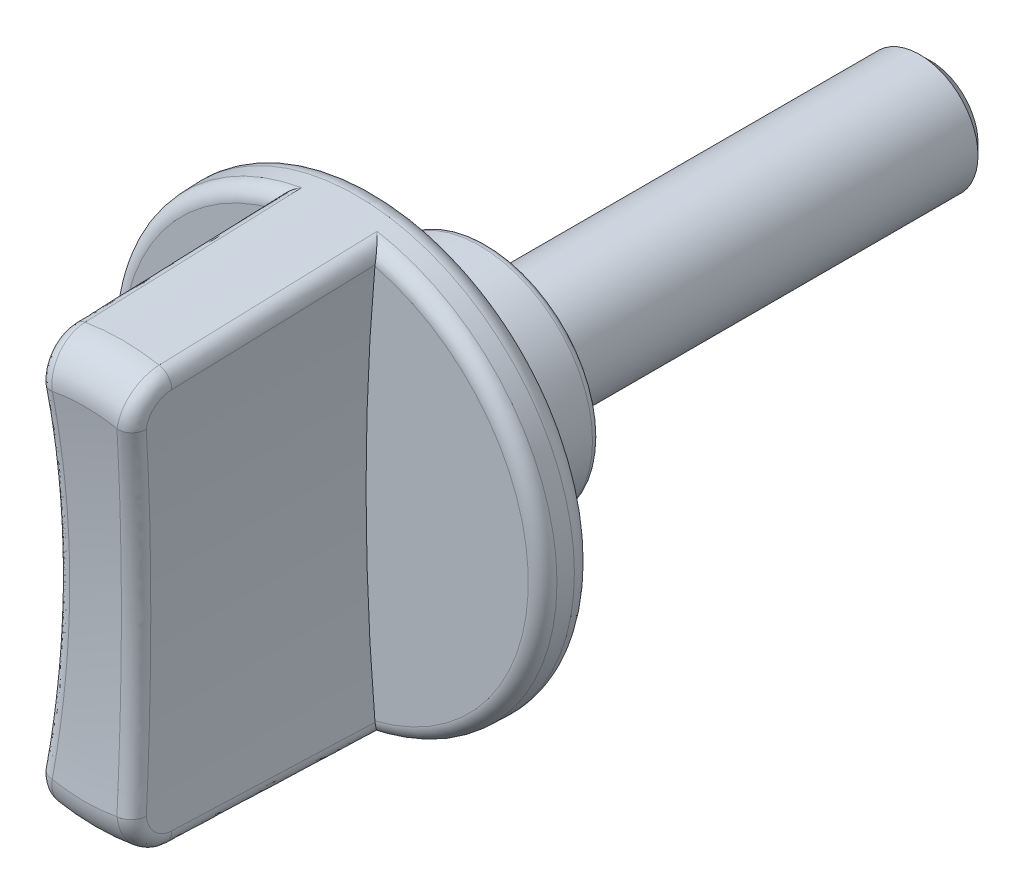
ISO-10303-21;
HEADER;
FILE_DESCRIPTION(('STEP AP214'),'2;1');
FILE_NAME('part.step','',(''),(''),'','','');
FILE_SCHEMA(('AUTOMOTIVE_DESIGN { 1 0 10303 214 1 1 1 1 }'));
ENDSEC;
DATA;
#1=APPLICATION_CONTEXT('core data for automotive mechanical design processes');
#2=APPLICATION_PROTOCOL_DEFINITION('international standard','automotive_design',2000,#1);
#3=PRODUCT_CONTEXT('',#1,'mechanical');
#4=PRODUCT('Part','Part','',(#3));
#5=PRODUCT_RELATED_PRODUCT_CATEGORY('part','',(#4));
#6=PRODUCT_DEFINITION_FORMATION('','',#4);
#7=PRODUCT_DEFINITION_CONTEXT('part definition',#1,'design');
#8=PRODUCT_DEFINITION('design','',#6,#7);
#9=PRODUCT_DEFINITION_SHAPE('','',#8);
#10=(LENGTH_UNIT() NAMED_UNIT(*) SI_UNIT(.MILLI.,.METRE.));
#11=(NAMED_UNIT(*) PLANE_ANGLE_UNIT() SI_UNIT($,.RADIAN.));
#12=(NAMED_UNIT(*) SI_UNIT($,.STERADIAN.) SOLID_ANGLE_UNIT());
#13=UNCERTAINTY_MEASURE_WITH_UNIT(LENGTH_MEASURE(1.E-05),#10,'distance_accuracy_value','');
#14=(GEOMETRIC_REPRESENTATION_CONTEXT(3) GLOBAL_UNCERTAINTY_ASSIGNED_CONTEXT((#13)) GLOBAL_UNIT_ASSIGNED_CONTEXT((#10,
#11,#12)) REPRESENTATION_CONTEXT('',''));
#15=CARTESIAN_POINT('',(0.,0.,0.));
#16=DIRECTION('',(0.,0.,1.));
#17=DIRECTION('',(1.,0.,0.));
#18=AXIS2_PLACEMENT_3D('',#15,#16,#17);
#19=CARTESIAN_POINT('',(0.,0.,9.37986599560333));
#20=DIRECTION('',(0.,0.,-1.));
#21=DIRECTION('',(-1.,0.,0.));
#22=AXIS2_PLACEMENT_3D('',#19,#20,#21);
#23=CONICAL_SURFACE('',#22,14.951814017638,0.0349065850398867);
#24=CARTESIAN_POINT('',(0.,0.,10.5348994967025));
#25=DIRECTION('',(0.,0.,-1.));
#26=DIRECTION('',(-1.,0.,0.));
#27=AXIS2_PLACEMENT_3D('',#24,#25,#26);
#28=CIRCLE('',#27,14.9114793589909);
#29=CARTESIAN_POINT('',(-2.58532278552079,-14.6856502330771,10.5348994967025));
#30=VERTEX_POINT('',#29);
#31=CARTESIAN_POINT('',(-2.58532278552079,14.6856502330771,10.5348994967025));
#32=VERTEX_POINT('',#31);
#33=EDGE_CURVE('E148',#30,#32,#28,.T.);
#34=ORIENTED_EDGE('',*,*,#33,.T.);
#35=CARTESIAN_POINT('',(-2.47226549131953,13.25972440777,51.2913866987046));
#36=CARTESIAN_POINT('',(-3.35907520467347,13.0944948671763,51.2881365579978));
#37=CARTESIAN_POINT('',(-3.28577574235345,12.1959580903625,51.2564872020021));
#38=CARTESIAN_POINT('',(-2.48334722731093,13.4107895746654,46.9805587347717));
#39=CARTESIAN_POINT('',(-3.37237798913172,13.2464409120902,46.9730443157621));
#40=CARTESIAN_POINT('',(-3.29799904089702,12.345796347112,46.9456592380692));
#41=CARTESIAN_POINT('',(-2.49471292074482,13.5617705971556,42.6697289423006));
#42=CARTESIAN_POINT('',(-3.38588966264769,13.3981050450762,42.6624615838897));
#43=CARTESIAN_POINT('',(-3.31044334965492,12.4955646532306,42.6348294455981));
#44=CARTESIAN_POINT('',(-2.51800094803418,13.863577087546,34.0480661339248));
#45=CARTESIAN_POINT('',(-3.41335840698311,13.7012205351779,34.0408916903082));
#46=CARTESIAN_POINT('',(-3.33577398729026,12.7949708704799,34.0131666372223));
#47=CARTESIAN_POINT('',(-2.52992328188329,14.014402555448,29.7372331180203));
#48=CARTESIAN_POINT('',(-3.42731499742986,13.8526566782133,29.7303247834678));
#49=CARTESIAN_POINT('',(-3.34866031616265,12.9446087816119,29.7023336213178));
#50=CARTESIAN_POINT('',(-2.55431331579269,14.3159106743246,21.1155641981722));
#51=CARTESIAN_POINT('',(-3.45567362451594,14.1553354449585,21.1087689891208));
#52=CARTESIAN_POINT('',(-3.37487499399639,13.2437637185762,21.0806647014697));
#53=CARTESIAN_POINT('',(-2.56678101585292,14.4665933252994,16.8047282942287));
#54=CARTESIAN_POINT('',(-3.4700752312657,14.3065643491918,16.7981599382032));
#55=CARTESIAN_POINT('',(-3.38820334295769,13.3932807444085,16.7698287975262));
#56=CARTESIAN_POINT('',(-2.59225257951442,14.767825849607,8.18305386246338));
#57=CARTESIAN_POINT('',(-3.4993237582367,14.6088404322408,8.17660813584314));
#58=CARTESIAN_POINT('',(-3.4153020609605,13.6922014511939,8.14815436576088));
#59=CARTESIAN_POINT('',(-2.60525644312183,14.9183757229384,3.87221533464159));
#60=CARTESIAN_POINT('',(-3.51417028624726,14.7598751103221,3.8660121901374));
#61=CARTESIAN_POINT('',(-3.42907243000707,13.8416051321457,3.83731583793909));
#62=CARTESIAN_POINT('',(-2.61852378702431,15.0688642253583,-0.438624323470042));
#63=CARTESIAN_POINT('',(-3.5292268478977,14.9107009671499,-0.441164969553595));
#64=CARTESIAN_POINT('',(-3.4430638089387,13.9909559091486,-0.473523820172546));
#65=(BOUNDED_SURFACE() B_SPLINE_SURFACE(3,2,((#35,#36,#37),(#38,#39,#40),(#41,#42,#43),(#44,#45,
#46),(#47,#48,#49),(#50,#51,#52),(#53,#54,#55),(#56,#57,#58),(#59,#60,#61),(#62,#63,#64)),
.UNSPECIFIED.,.F.,.F.,.F.) B_SPLINE_SURFACE_WITH_KNOTS((4,2,2,2,4),(3,3),(0.,12.9404508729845,
25.8809015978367,38.8213523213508,51.761803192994),(0.,1.),
.UNSPECIFIED.) GEOMETRIC_REPRESENTATION_ITEM() RATIONAL_B_SPLINE_SURFACE(((1.,0.742526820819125,
1.),(1.,0.741774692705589,1.),(1.,0.741042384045,1.),(1.,0.73961385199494,1.),(1.,
0.738917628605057,1.),(1.,0.737557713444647,1.),(1.,0.736894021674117,1.),(1.,0.735596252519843,
1.),(1.,0.734962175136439,1.),(1.,0.734341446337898,1.))) REPRESENTATION_ITEM('') SURFACE());
#66=CARTESIAN_POINT('',(-2.61852378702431,15.0688642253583,-0.438624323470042));
#67=CARTESIAN_POINT('',(-2.60525644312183,14.9183757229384,3.8722153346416));
#68=CARTESIAN_POINT('',(-2.59225257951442,14.767825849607,8.18305386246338));
#69=CARTESIAN_POINT('',(-2.56678101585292,14.4665933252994,16.8047282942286));
#70=CARTESIAN_POINT('',(-2.55431331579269,14.3159106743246,21.1155641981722));
#71=CARTESIAN_POINT('',(-2.52992328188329,14.0144025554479,29.7372331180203));
#72=CARTESIAN_POINT('',(-2.51800094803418,13.863577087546,34.0480661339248));
#73=CARTESIAN_POINT('',(-2.49471292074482,13.5617705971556,42.6697289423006));
#74=CARTESIAN_POINT('',(-2.48334722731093,13.4107895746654,46.9805587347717));
#75=CARTESIAN_POINT('',(-2.47226549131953,13.25972440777,51.2913866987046));
#76=B_SPLINE_CURVE_WITH_KNOTS('',3,(#66,#67,#68,#69,#70,#71,#72,#73,#74,#75),.UNSPECIFIED.,.F.,
.F.,(4,2,2,2,4),(0.,12.9404508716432,25.8809015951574,38.8213523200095,51.761803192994),.UNSPECIFIED.);
#77=CARTESIAN_POINT('',(-2.54211829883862,14.1651566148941,25.4263986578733));
#78=VERTEX_POINT('',#77);
#79=EDGE_CURVE('E626',#32,#78,#76,.T.);
#80=ORIENTED_EDGE('',*,*,#79,.T.);
#81=CARTESIAN_POINT('',(0.,0.,25.4263986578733));
#82=DIRECTION('',(0.,0.,1.));
#83=DIRECTION('',(1.,0.,0.));
#84=AXIS2_PLACEMENT_3D('',#81,#82,#83);
#85=CIRCLE('',#84,14.3914567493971);
#86=CARTESIAN_POINT('',(2.54211829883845,14.1651566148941,25.4263986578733));
#87=VERTEX_POINT('',#86);
#88=EDGE_CURVE('E165',#87,#78,#85,.T.);
#89=ORIENTED_EDGE('',*,*,#88,.F.);
#90=CARTESIAN_POINT('',(3.28577574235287,12.1959580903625,51.2564872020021));
#91=CARTESIAN_POINT('',(3.35907520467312,13.0944948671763,51.2881365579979));
#92=CARTESIAN_POINT('',(2.47226549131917,13.25972440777,51.2913866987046));
#93=CARTESIAN_POINT('',(3.29799904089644,12.345796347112,46.9456592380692));
#94=CARTESIAN_POINT('',(3.37237798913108,13.2464409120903,46.9730443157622));
#95=CARTESIAN_POINT('',(2.48334722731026,13.4107895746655,46.9805587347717));
#96=CARTESIAN_POINT('',(3.31044334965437,12.4955646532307,42.6348294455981));
#97=CARTESIAN_POINT('',(3.38588966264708,13.3981050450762,42.6624615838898));
#98=CARTESIAN_POINT('',(2.49471292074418,13.5617705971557,42.6697289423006));
#99=CARTESIAN_POINT('',(3.3357739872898,12.7949708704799,34.0131666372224));
#100=CARTESIAN_POINT('',(3.41335840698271,13.701220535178,34.0408916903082));
#101=CARTESIAN_POINT('',(2.51800094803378,13.863577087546,34.0480661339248));
#102=CARTESIAN_POINT('',(3.34866031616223,12.9446087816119,29.7023336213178));
#103=CARTESIAN_POINT('',(3.42731499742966,13.8526566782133,29.7303247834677));
#104=CARTESIAN_POINT('',(2.52992328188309,14.0144025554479,29.7372331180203));
#105=CARTESIAN_POINT('',(3.37487499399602,13.2437637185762,21.0806647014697));
#106=CARTESIAN_POINT('',(3.4556736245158,14.1553354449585,21.1087689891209));
#107=CARTESIAN_POINT('',(2.55431331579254,14.3159106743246,21.1155641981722));
#108=CARTESIAN_POINT('',(3.38820334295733,13.3932807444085,16.7698287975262));
#109=CARTESIAN_POINT('',(3.47007523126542,14.3065643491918,16.7981599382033));
#110=CARTESIAN_POINT('',(2.56678101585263,14.4665933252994,16.8047282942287));
#111=CARTESIAN_POINT('',(3.41530206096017,13.6922014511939,8.14815436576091));
#112=CARTESIAN_POINT('',(3.4993237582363,14.6088404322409,8.17660813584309));
#113=CARTESIAN_POINT('',(2.592252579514,14.7678258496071,8.18305386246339));
#114=CARTESIAN_POINT('',(3.42907243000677,13.8416051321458,3.83731583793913));
#115=CARTESIAN_POINT('',(3.51417028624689,14.7598751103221,3.86601219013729));
#116=CARTESIAN_POINT('',(2.60525644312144,14.9183757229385,3.87221533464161));
#117=CARTESIAN_POINT('',(3.44306380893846,13.9909559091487,-0.473523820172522));
#118=CARTESIAN_POINT('',(3.52922684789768,14.9107009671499,-0.441164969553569));
#119=CARTESIAN_POINT('',(2.61852378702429,15.0688642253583,-0.438624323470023));
#120=(BOUNDED_SURFACE() B_SPLINE_SURFACE(3,2,((#90,#91,#92),(#93,#94,#95),(#96,#97,#98),(#99,
#100,#101),(#102,#103,#104),(#105,#106,#107),(#108,#109,#110),(#111,#112,#113),(#114,#115,#116),
(#117,#118,#119)),.UNSPECIFIED.,.F.,.F.,.F.) B_SPLINE_SURFACE_WITH_KNOTS((4,2,2,2,4),(3,3),(0.,
12.9404508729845,25.8809015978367,38.8213523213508,51.761803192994),(0.,1.),
.UNSPECIFIED.) GEOMETRIC_REPRESENTATION_ITEM() RATIONAL_B_SPLINE_SURFACE(((1.,0.742526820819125,
1.),(1.,0.74177469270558,1.),(1.,0.741042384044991,1.),(1.,0.739613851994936,1.),(1.,
0.738917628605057,1.),(1.,0.737557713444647,1.),(1.,0.736894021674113,1.),(1.,0.735596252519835,
1.),(1.,0.73496217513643,1.),(1.,0.734341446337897,1.))) REPRESENTATION_ITEM('') SURFACE());
#121=CARTESIAN_POINT('',(2.47226549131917,13.25972440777,51.2913866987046));
#122=CARTESIAN_POINT('',(2.48334722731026,13.4107895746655,46.9805587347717));
#123=CARTESIAN_POINT('',(2.49471292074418,13.5617705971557,42.6697289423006));
#124=CARTESIAN_POINT('',(2.51800094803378,13.863577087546,34.0480661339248));
#125=CARTESIAN_POINT('',(2.52992328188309,14.0144025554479,29.7372331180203));
#126=CARTESIAN_POINT('',(2.55431331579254,14.3159106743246,21.1155641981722));
#127=CARTESIAN_POINT('',(2.56678101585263,14.4665933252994,16.8047282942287));
#128=CARTESIAN_POINT('',(2.592252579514,14.7678258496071,8.18305386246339));
#129=CARTESIAN_POINT('',(2.60525644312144,14.9183757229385,3.87221533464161));
#130=CARTESIAN_POINT('',(2.61852378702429,15.0688642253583,-0.438624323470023));
#131=B_SPLINE_CURVE_WITH_KNOTS('',3,(#121,#122,#123,#124,#125,#126,#127,#128,#129,#130),
.UNSPECIFIED.,.F.,.F.,(4,2,2,2,4),(0.,12.9404508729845,25.8809015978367,38.8213523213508,
51.761803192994),.UNSPECIFIED.);
#132=CARTESIAN_POINT('',(2.58532278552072,14.6856502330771,10.5348994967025));
#133=VERTEX_POINT('',#132);
#134=EDGE_CURVE('E149',#87,#133,#131,.T.);
#135=ORIENTED_EDGE('',*,*,#134,.T.);
#136=CARTESIAN_POINT('',(0.,0.,10.5348994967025));
#137=DIRECTION('',(0.,0.,-1.));
#138=DIRECTION('',(-1.,0.,0.));
#139=AXIS2_PLACEMENT_3D('',#136,#137,#138);
#140=CIRCLE('',#139,14.9114793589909);
#141=CARTESIAN_POINT('',(2.58532278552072,-14.6856502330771,10.5348994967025));
#142=VERTEX_POINT('',#141);
#143=EDGE_CURVE('E356',#133,#142,#140,.T.);
#144=ORIENTED_EDGE('',*,*,#143,.T.);
#145=CARTESIAN_POINT('',(2.47226549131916,-13.25972440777,51.2913866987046));
#146=CARTESIAN_POINT('',(3.35907520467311,-13.0944948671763,51.2881365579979));
#147=CARTESIAN_POINT('',(3.28577574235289,-12.1959580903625,51.2564872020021));
#148=CARTESIAN_POINT('',(2.48334722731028,-13.4107895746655,46.9805587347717));
#149=CARTESIAN_POINT('',(3.37237798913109,-13.2464409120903,46.9730443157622));
#150=CARTESIAN_POINT('',(3.29799904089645,-12.345796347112,46.9456592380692));
#151=CARTESIAN_POINT('',(2.4947129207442,-13.5617705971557,42.6697289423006));
#152=CARTESIAN_POINT('',(3.3858896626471,-13.3981050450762,42.6624615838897));
#153=CARTESIAN_POINT('',(3.31044334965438,-12.4955646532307,42.6348294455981));
#154=CARTESIAN_POINT('',(2.51800094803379,-13.863577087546,34.0480661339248));
#155=CARTESIAN_POINT('',(3.41335840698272,-13.701220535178,34.0408916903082));
#156=CARTESIAN_POINT('',(3.33577398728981,-12.7949708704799,34.0131666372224));
#157=CARTESIAN_POINT('',(2.52992328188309,-14.014402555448,29.7372331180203));
#158=CARTESIAN_POINT('',(3.42731499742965,-13.8526566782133,29.7303247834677));
#159=CARTESIAN_POINT('',(3.34866031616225,-12.9446087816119,29.7023336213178));
#160=CARTESIAN_POINT('',(2.55431331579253,-14.3159106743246,21.1155641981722));
#161=CARTESIAN_POINT('',(3.45567362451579,-14.1553354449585,21.1087689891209));
#162=CARTESIAN_POINT('',(3.37487499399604,-13.2437637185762,21.0806647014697));
#163=CARTESIAN_POINT('',(2.56678101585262,-14.4665933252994,16.8047282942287));
#164=CARTESIAN_POINT('',(3.47007523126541,-14.3065643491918,16.7981599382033));
#165=CARTESIAN_POINT('',(3.38820334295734,-13.3932807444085,16.7698287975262));
#166=CARTESIAN_POINT('',(2.59225257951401,-14.7678258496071,8.18305386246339));
#167=CARTESIAN_POINT('',(3.49932375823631,-14.6088404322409,8.1766081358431));
#168=CARTESIAN_POINT('',(3.41530206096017,-13.6922014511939,8.14815436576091));
#169=CARTESIAN_POINT('',(2.60525644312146,-14.9183757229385,3.87221533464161));
#170=CARTESIAN_POINT('',(3.51417028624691,-14.7598751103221,3.86601219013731));
#171=CARTESIAN_POINT('',(3.42907243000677,-13.8416051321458,3.83731583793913));
#172=CARTESIAN_POINT('',(2.61852378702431,-15.0688642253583,-0.438624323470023));
#173=CARTESIAN_POINT('',(3.5292268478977,-14.9107009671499,-0.441164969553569));
#174=CARTESIAN_POINT('',(3.44306380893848,-13.9909559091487,-0.473523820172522));
#175=(BOUNDED_SURFACE() B_SPLINE_SURFACE(3,2,((#145,#146,#147),(#148,#149,#150),(#151,#152,
#153),(#154,#155,#156),(#157,#158,#159),(#160,#161,#162),(#163,#164,#165),(#166,#167,#168),
(#169,#170,#171),(#172,#173,#174)),.UNSPECIFIED.,.F.,.F.,.F.) B_SPLINE_SURFACE_WITH_KNOTS((4,2,
2,2,4),(3,3),(0.,12.9404508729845,25.8809015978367,38.8213523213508,51.761803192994),(0.,1.),
.UNSPECIFIED.) GEOMETRIC_REPRESENTATION_ITEM() RATIONAL_B_SPLINE_SURFACE(((1.,0.742526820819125,
1.),(1.,0.741774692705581,1.),(1.,0.741042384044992,1.),(1.,0.739613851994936,1.),(1.,
0.738917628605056,1.),(1.,0.737557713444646,1.),(1.,0.736894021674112,1.),(1.,0.735596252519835,
1.),(1.,0.734962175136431,1.),(1.,0.734341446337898,1.))) REPRESENTATION_ITEM('') SURFACE());
#176=CARTESIAN_POINT('',(2.61852378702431,-15.0688642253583,-0.438624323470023));
#177=CARTESIAN_POINT('',(2.60525644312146,-14.9183757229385,3.87221533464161));
#178=CARTESIAN_POINT('',(2.59225257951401,-14.7678258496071,8.18305386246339));
#179=CARTESIAN_POINT('',(2.56678101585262,-14.4665933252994,16.8047282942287));
#180=CARTESIAN_POINT('',(2.55431331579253,-14.3159106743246,21.1155641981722));
#181=CARTESIAN_POINT('',(2.52992328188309,-14.014402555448,29.7372331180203));
#182=CARTESIAN_POINT('',(2.51800094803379,-13.863577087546,34.0480661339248));
#183=CARTESIAN_POINT('',(2.4947129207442,-13.5617705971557,42.6697289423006));
#184=CARTESIAN_POINT('',(2.48334722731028,-13.4107895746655,46.9805587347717));
#185=CARTESIAN_POINT('',(2.47226549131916,-13.25972440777,51.2913866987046));
#186=B_SPLINE_CURVE_WITH_KNOTS('',3,(#176,#177,#178,#179,#180,#181,#182,#183,#184,#185),
.UNSPECIFIED.,.F.,.F.,(4,2,2,2,4),(0.,12.9404508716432,25.8809015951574,38.8213523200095,
51.761803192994),.UNSPECIFIED.);
#187=CARTESIAN_POINT('',(2.54211829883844,-14.1651566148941,25.4263986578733));
#188=VERTEX_POINT('',#187);
#189=EDGE_CURVE('E164',#142,#188,#186,.T.);
#190=ORIENTED_EDGE('',*,*,#189,.T.);
#191=CARTESIAN_POINT('',(-2.54211829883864,-14.1651566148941,25.4263986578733));
#192=VERTEX_POINT('',#191);
#193=EDGE_CURVE('E154',#192,#188,#85,.T.);
#194=ORIENTED_EDGE('',*,*,#193,.F.);
#195=CARTESIAN_POINT('',(-3.28577574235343,-12.1959580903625,51.2564872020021));
#196=CARTESIAN_POINT('',(-3.35907520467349,-13.0944948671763,51.2881365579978));
#197=CARTESIAN_POINT('',(-2.47226549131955,-13.25972440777,51.2913866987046));
#198=CARTESIAN_POINT('',(-3.29799904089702,-12.345796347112,46.9456592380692));
#199=CARTESIAN_POINT('',(-3.37237798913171,-13.2464409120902,46.9730443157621));
#200=CARTESIAN_POINT('',(-2.48334722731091,-13.4107895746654,46.9805587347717));
#201=CARTESIAN_POINT('',(-3.31044334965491,-12.4955646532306,42.6348294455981));
#202=CARTESIAN_POINT('',(-3.38588966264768,-13.3981050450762,42.6624615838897));
#203=CARTESIAN_POINT('',(-2.4947129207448,-13.5617705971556,42.6697289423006));
#204=CARTESIAN_POINT('',(-3.33577398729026,-12.7949708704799,34.0131666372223));
#205=CARTESIAN_POINT('',(-3.41335840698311,-13.7012205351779,34.0408916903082));
#206=CARTESIAN_POINT('',(-2.51800094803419,-13.863577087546,34.0480661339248));
#207=CARTESIAN_POINT('',(-3.34866031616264,-12.9446087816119,29.7023336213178));
#208=CARTESIAN_POINT('',(-3.42731499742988,-13.8526566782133,29.7303247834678));
#209=CARTESIAN_POINT('',(-2.52992328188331,-14.0144025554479,29.7372331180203));
#210=CARTESIAN_POINT('',(-3.37487499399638,-13.2437637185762,21.0806647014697));
#211=CARTESIAN_POINT('',(-3.45567362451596,-14.1553354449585,21.1087689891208));
#212=CARTESIAN_POINT('',(-2.5543133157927,-14.3159106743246,21.1155641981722));
#213=CARTESIAN_POINT('',(-3.38820334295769,-13.3932807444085,16.7698287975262));
#214=CARTESIAN_POINT('',(-3.47007523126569,-14.3065643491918,16.7981599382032));
#215=CARTESIAN_POINT('',(-2.56678101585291,-14.4665933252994,16.8047282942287));
#216=CARTESIAN_POINT('',(-3.41530206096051,-13.6922014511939,8.14815436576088));
#217=CARTESIAN_POINT('',(-3.49932375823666,-14.6088404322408,8.17660813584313));
#218=CARTESIAN_POINT('',(-2.59225257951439,-14.767825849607,8.18305386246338));
#219=CARTESIAN_POINT('',(-3.42907243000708,-13.8416051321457,3.83731583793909));
#220=CARTESIAN_POINT('',(-3.51417028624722,-14.7598751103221,3.86601219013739));
#221=CARTESIAN_POINT('',(-2.60525644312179,-14.9183757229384,3.87221533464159));
#222=CARTESIAN_POINT('',(-3.44306380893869,-13.9909559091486,-0.473523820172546));
#223=CARTESIAN_POINT('',(-3.52922684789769,-14.9107009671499,-0.441164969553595));
#224=CARTESIAN_POINT('',(-2.6185237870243,-15.0688642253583,-0.438624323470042));
#225=(BOUNDED_SURFACE() B_SPLINE_SURFACE(3,2,((#195,#196,#197),(#198,#199,#200),(#201,#202,
#203),(#204,#205,#206),(#207,#208,#209),(#210,#211,#212),(#213,#214,#215),(#216,#217,#218),
(#219,#220,#221),(#222,#223,#224)),.UNSPECIFIED.,.F.,.F.,.F.) B_SPLINE_SURFACE_WITH_KNOTS((4,2,
2,2,4),(3,3),(0.,12.9404508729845,25.8809015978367,38.8213523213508,51.761803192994),(0.,1.),
.UNSPECIFIED.) GEOMETRIC_REPRESENTATION_ITEM() RATIONAL_B_SPLINE_SURFACE(((1.,0.742526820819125,
1.),(1.,0.741774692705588,1.),(1.,0.741042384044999,1.),(1.,0.73961385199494,1.),(1.,
0.738917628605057,1.),(1.,0.737557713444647,1.),(1.,0.736894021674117,1.),(1.,0.735596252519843,
1.),(1.,0.734962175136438,1.),(1.,0.734341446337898,1.))) REPRESENTATION_ITEM('') SURFACE());
#226=CARTESIAN_POINT('',(-2.47226549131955,-13.25972440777,51.2913866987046));
#227=CARTESIAN_POINT('',(-2.48334722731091,-13.4107895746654,46.9805587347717));
#228=CARTESIAN_POINT('',(-2.4947129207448,-13.5617705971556,42.6697289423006));
#229=CARTESIAN_POINT('',(-2.51800094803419,-13.863577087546,34.0480661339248));
#230=CARTESIAN_POINT('',(-2.52992328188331,-14.0144025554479,29.7372331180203));
#231=CARTESIAN_POINT('',(-2.5543133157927,-14.3159106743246,21.1155641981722));
#232=CARTESIAN_POINT('',(-2.56678101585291,-14.4665933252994,16.8047282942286));
#233=CARTESIAN_POINT('',(-2.59225257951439,-14.767825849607,8.18305386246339));
#234=CARTESIAN_POINT('',(-2.60525644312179,-14.9183757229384,3.8722153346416));
#235=CARTESIAN_POINT('',(-2.6185237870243,-15.0688642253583,-0.438624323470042));
#236=B_SPLINE_CURVE_WITH_KNOTS('',3,(#226,#227,#228,#229,#230,#231,#232,#233,#234,#235),
.UNSPECIFIED.,.F.,.F.,(4,2,2,2,4),(0.,12.9404508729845,25.8809015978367,38.8213523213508,
51.761803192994),.UNSPECIFIED.);
#237=EDGE_CURVE('E141',#192,#30,#236,.T.);
#238=ORIENTED_EDGE('',*,*,#237,.T.);
#239=EDGE_LOOP('',(#34,#80,#89,#135,#144,#190,#194,#238));
#240=FACE_BOUND('',#239,.T.);
#241=CARTESIAN_POINT('',(0.,0.,9.37986599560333));
#242=DIRECTION('',(0.,0.,1.));
#243=DIRECTION('',(1.,0.,0.));
#244=AXIS2_PLACEMENT_3D('',#241,#242,#243);
#245=CIRCLE('',#244,14.951814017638);
#246=CARTESIAN_POINT('',(14.951814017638,0.,9.37986599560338));
#247=VERTEX_POINT('',#246);
#248=EDGE_CURVE('E169',#247,#247,#245,.T.);
#249=ORIENTED_EDGE('',*,*,#248,.T.);
#250=EDGE_LOOP('',(#249));
#251=FACE_BOUND('',#250,.T.);
#252=ADVANCED_FACE('F14',(#240,#251),#23,.T.);
#253=CARTESIAN_POINT('',(0.,0.,25.3333333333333));
#254=DIRECTION('',(0.,0.,1.));
#255=DIRECTION('',(1.,0.,0.));
#256=AXIS2_PLACEMENT_3D('',#253,#254,#255);
#257=TOROIDAL_SURFACE('',#256,11.7264145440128,2.66666666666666);
#258=CARTESIAN_POINT('',(-5.09660929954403,26.2090390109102,30.2386060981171));
#259=CARTESIAN_POINT('',(-5.04566440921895,25.9219556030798,31.1887265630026));
#260=CARTESIAN_POINT('',(-4.06680563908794,26.0938344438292,31.1945861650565));
#261=CARTESIAN_POINT('',(-4.90775050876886,25.144919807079,29.9047265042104));
#262=CARTESIAN_POINT('',(-4.86064558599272,24.8673892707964,30.8601550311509));
#263=CARTESIAN_POINT('',(-3.87877699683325,25.0343926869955,30.8643755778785));
#264=CARTESIAN_POINT('',(-4.72935205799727,24.0726340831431,29.5912097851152));
#265=CARTESIAN_POINT('',(-4.68612565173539,23.8061708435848,30.5520515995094));
#266=CARTESIAN_POINT('',(-3.7011627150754,23.9668203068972,30.5543040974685));
#267=CARTESIAN_POINT('',(-4.39445096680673,21.9135860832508,29.005414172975));
#268=CARTESIAN_POINT('',(-4.35848164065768,21.6694836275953,29.9763070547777));
#269=CARTESIAN_POINT('',(-3.36773371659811,21.8172626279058,29.9749457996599));
#270=CARTESIAN_POINT('',(-4.23794909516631,20.8268233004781,28.7331367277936));
#271=CARTESIAN_POINT('',(-4.20543787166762,20.5942444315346,29.7088125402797));
#272=CARTESIAN_POINT('',(-3.21191976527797,20.7352768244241,29.7056604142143));
#273=CARTESIAN_POINT('',(-3.9478166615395,18.640654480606,28.2303326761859));
#274=CARTESIAN_POINT('',(-3.92168140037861,18.4313042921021,29.2147619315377));
#275=CARTESIAN_POINT('',(-2.92306263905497,18.558717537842,29.2083816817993));
#276=CARTESIAN_POINT('',(-3.81418815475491,17.5412473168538,27.9998098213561));
#277=CARTESIAN_POINT('',(-3.79104328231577,17.3438567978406,28.9883392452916));
#278=CARTESIAN_POINT('',(-2.79002151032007,17.464142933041,28.9803920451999));
#279=CARTESIAN_POINT('',(-3.57063498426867,15.3320182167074,27.5809917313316));
#280=CARTESIAN_POINT('',(-3.5529068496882,15.1586323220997,28.5769010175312));
#281=CARTESIAN_POINT('',(-2.5475389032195,15.2646247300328,28.5661763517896));
#282=CARTESIAN_POINT('',(-3.46070990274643,14.2221964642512,27.3926957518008));
#283=CARTESIAN_POINT('',(-3.44547160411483,14.0611311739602,28.3919963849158));
#284=CARTESIAN_POINT('',(-2.43809700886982,14.1596813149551,28.3799495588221));
#285=CARTESIAN_POINT('',(-3.17324072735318,10.9448663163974,26.9014345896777));
#286=CARTESIAN_POINT('',(-3.16430251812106,10.8183834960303,27.9092094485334));
#287=CARTESIAN_POINT('',(-2.15189143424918,10.896757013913,27.8940868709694));
#288=CARTESIAN_POINT('',(-3.02946496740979,8.765254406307,26.6574036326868));
#289=CARTESIAN_POINT('',(-3.02394203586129,8.66439004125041,27.6698295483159));
#290=CARTESIAN_POINT('',(-2.00874765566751,8.72672581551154,27.6527375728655));
#291=CARTESIAN_POINT('',(-2.83742503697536,4.39042701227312,26.3318875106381));
#292=CARTESIAN_POINT('',(-2.83626907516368,4.33910628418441,27.3501807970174));
#293=CARTESIAN_POINT('',(-1.81755185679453,4.37112843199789,27.3307985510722));
#294=CARTESIAN_POINT('',(-2.78914896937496,2.19521350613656,26.2503820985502));
#295=CARTESIAN_POINT('',(-2.78914896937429,2.17015132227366,27.2702402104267));
#296=CARTESIAN_POINT('',(-1.76948799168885,2.18556421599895,27.2501888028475));
#297=CARTESIAN_POINT('',(-2.78914896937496,-2.19521350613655,26.2503820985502));
#298=CARTESIAN_POINT('',(-2.78914896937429,-2.17015132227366,27.2702402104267));
#299=CARTESIAN_POINT('',(-1.76948799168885,-2.18556421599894,27.2501888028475));
#300=CARTESIAN_POINT('',(-2.83742503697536,-4.39042701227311,26.3318875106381));
#301=CARTESIAN_POINT('',(-2.83626907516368,-4.33910628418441,27.3501807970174));
#302=CARTESIAN_POINT('',(-1.81755185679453,-4.37112843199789,27.3307985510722));
#303=CARTESIAN_POINT('',(-3.02946496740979,-8.765254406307,26.6574036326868));
#304=CARTESIAN_POINT('',(-3.02394203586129,-8.66439004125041,27.6698295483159));
#305=CARTESIAN_POINT('',(-2.00874765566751,-8.72672581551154,27.6527375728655));
#306=CARTESIAN_POINT('',(-3.17324072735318,-10.9448663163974,26.9014345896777));
#307=CARTESIAN_POINT('',(-3.16430251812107,-10.8183834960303,27.9092094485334));
#308=CARTESIAN_POINT('',(-2.15189143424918,-10.896757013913,27.8940868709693));
#309=CARTESIAN_POINT('',(-3.46070990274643,-14.2221964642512,27.3926957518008));
#310=CARTESIAN_POINT('',(-3.44547160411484,-14.0611311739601,28.3919963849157));
#311=CARTESIAN_POINT('',(-2.43809700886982,-14.1596813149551,28.3799495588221));
#312=CARTESIAN_POINT('',(-3.57063498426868,-15.3320182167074,27.5809917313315));
#313=CARTESIAN_POINT('',(-3.55290684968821,-15.1586323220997,28.5769010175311));
#314=CARTESIAN_POINT('',(-2.5475389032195,-15.2646247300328,28.5661763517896));
#315=CARTESIAN_POINT('',(-3.81418815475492,-17.5412473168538,27.9998098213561));
#316=CARTESIAN_POINT('',(-3.79104328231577,-17.3438567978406,28.9883392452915));
#317=CARTESIAN_POINT('',(-2.79002151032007,-17.464142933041,28.9803920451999));
#318=CARTESIAN_POINT('',(-3.94781666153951,-18.640654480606,28.2303326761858));
#319=CARTESIAN_POINT('',(-3.9216814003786,-18.4313042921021,29.2147619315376));
#320=CARTESIAN_POINT('',(-2.92306263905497,-18.558717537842,29.2083816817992));
#321=CARTESIAN_POINT('',(-4.23794909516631,-20.8268233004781,28.7331367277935));
#322=CARTESIAN_POINT('',(-4.20543787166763,-20.5942444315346,29.7088125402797));
#323=CARTESIAN_POINT('',(-3.21191976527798,-20.7352768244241,29.7056604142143));
#324=CARTESIAN_POINT('',(-4.39445096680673,-21.9135860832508,29.0054141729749));
#325=CARTESIAN_POINT('',(-4.3584816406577,-21.6694836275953,29.9763070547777));
#326=CARTESIAN_POINT('',(-3.36773371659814,-21.8172626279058,29.9749457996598));
#327=CARTESIAN_POINT('',(-4.72935205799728,-24.0726340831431,29.5912097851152));
#328=CARTESIAN_POINT('',(-4.68612565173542,-23.8061708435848,30.5520515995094));
#329=CARTESIAN_POINT('',(-3.70116271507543,-23.9668203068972,30.5543040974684));
#330=CARTESIAN_POINT('',(-4.90775050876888,-25.144919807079,29.9047265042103));
#331=CARTESIAN_POINT('',(-4.86064558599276,-24.8673892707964,30.8601550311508));
#332=CARTESIAN_POINT('',(-3.87877699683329,-25.0343926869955,30.8643755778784));
#333=CARTESIAN_POINT('',(-5.09660929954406,-26.2090390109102,30.238606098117));
#334=CARTESIAN_POINT('',(-5.04566440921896,-25.9219556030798,31.1887265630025));
#335=CARTESIAN_POINT('',(-4.06680563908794,-26.0938344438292,31.1945861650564));
#336=(BOUNDED_SURFACE() B_SPLINE_SURFACE(3,2,((#258,#259,#260),(#261,#262,#263),(#264,#265,
#266),(#267,#268,#269),(#270,#271,#272),(#273,#274,#275),(#276,#277,#278),(#279,#280,#281),
(#282,#283,#284),(#285,#286,#287),(#288,#289,#290),(#291,#292,#293),(#294,#295,#296),(#297,#298,
#299),(#300,#301,#302),(#303,#304,#305),(#306,#307,#308),(#309,#310,#311),(#312,#313,#314),
(#315,#316,#317),(#318,#319,#320),(#321,#322,#323),(#324,#325,#326),(#327,#328,#329),(#330,#331,
#332),(#333,#334,#335)),.UNSPECIFIED.,.F.,.F.,.F.) B_SPLINE_SURFACE_WITH_KNOTS((4,2,2,2,2,2,2,2,
2,2,2,2,4),(3,3),(0.,3.41384072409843,6.82780127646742,10.2420684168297,13.6562753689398,
20.2847522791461,26.9124033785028,33.5400544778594,40.1685313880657,43.5827383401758,
46.9970054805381,50.4109660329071,53.8248067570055),(0.,1.),
.UNSPECIFIED.) GEOMETRIC_REPRESENTATION_ITEM() RATIONAL_B_SPLINE_SURFACE(((1.,0.709283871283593,
1.),(1.,0.708538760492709,1.),(1.,0.707833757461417,1.),(1.,0.706508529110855,1.),(1.,
0.705888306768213,1.),(1.,0.704737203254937,1.),(1.,0.704206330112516,1.),(1.,0.703237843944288,
1.),(1.,0.702800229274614,1.),(1.,0.701654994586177,1.),(1.,0.701081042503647,1.),(1.,
0.700314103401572,1.),(1.,0.700121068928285,1.),(1.,0.700121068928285,1.),(1.,0.700314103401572,
1.),(1.,0.701081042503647,1.),(1.,0.701654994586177,1.),(1.,0.702800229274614,1.),(1.,
0.703237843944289,1.),(1.,0.704206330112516,1.),(1.,0.704737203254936,1.),(1.,0.705888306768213,
1.),(1.,0.706508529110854,1.),(1.,0.707833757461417,1.),(1.,0.70853876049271,1.),(1.,
0.709283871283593,1.))) REPRESENTATION_ITEM('') SURFACE());
#337=CARTESIAN_POINT('',(-2.21412295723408,-11.5154877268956,28.));
#338=CARTESIAN_POINT('',(-2.21653634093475,-11.5149537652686,28.0000000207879));
#339=CARTESIAN_POINT('',(-2.21896356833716,-11.5145229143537,28.00000002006));
#340=CARTESIAN_POINT('',(-2.2238457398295,-11.5138674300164,27.9999999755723));
#341=CARTESIAN_POINT('',(-2.22630068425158,-11.513642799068,27.9999999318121));
#342=CARTESIAN_POINT('',(-2.22876947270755,-11.5135212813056,27.9999998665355));
#343=B_SPLINE_CURVE_WITH_KNOTS('',3,(#337,#338,#339,#340,#341,#342),.UNSPECIFIED.,.F.,.F.,(4,2,
4),(0.,0.007395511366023,0.0147911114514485),.UNSPECIFIED.);
#344=CARTESIAN_POINT('',(-2.21412295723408,-11.5154877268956,28.));
#345=VERTEX_POINT('',#344);
#346=CARTESIAN_POINT('',(-2.22876947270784,-11.5135212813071,27.9999998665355));
#347=VERTEX_POINT('',#346);
#348=EDGE_CURVE('E158',#345,#347,#343,.T.);
#349=ORIENTED_EDGE('',*,*,#348,.T.);
#350=CARTESIAN_POINT('',(-2.53756322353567,-14.1263760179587,24.8697783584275));
#351=CARTESIAN_POINT('',(-3.43812056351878,-13.9671539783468,24.8839842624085));
#352=CARTESIAN_POINT('',(-3.35964859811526,-13.0699815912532,25.0436114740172));
#353=CARTESIAN_POINT('',(-2.53945556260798,-14.1424869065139,24.961485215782));
#354=CARTESIAN_POINT('',(-3.43951590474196,-13.9824035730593,24.9729244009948));
#355=CARTESIAN_POINT('',(-3.36052845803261,-13.0800371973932,25.1009282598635));
#356=CARTESIAN_POINT('',(-2.5407842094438,-14.1537986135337,25.0539897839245));
#357=CARTESIAN_POINT('',(-3.44049634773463,-13.9931090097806,25.0626106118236));
#358=CARTESIAN_POINT('',(-3.36114664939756,-13.0870973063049,25.1587436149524));
#359=CARTESIAN_POINT('',(-2.5423071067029,-14.1667640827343,25.2398323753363));
#360=CARTESIAN_POINT('',(-3.44162036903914,-14.0053770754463,25.2427264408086));
#361=CARTESIAN_POINT('',(-3.36185544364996,-13.0951895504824,25.2748952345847));
#362=CARTESIAN_POINT('',(-2.54249956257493,-14.1684025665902,25.3331714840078));
#363=CARTESIAN_POINT('',(-3.44176288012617,-14.0069280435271,25.3331775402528));
#364=CARTESIAN_POINT('',(-3.36194521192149,-13.0962121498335,25.3332321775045));
#365=CARTESIAN_POINT('',(-2.54150770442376,-14.1599582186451,25.5757021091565));
#366=CARTESIAN_POINT('',(-3.44103017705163,-13.9989373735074,25.5682109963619));
#367=CARTESIAN_POINT('',(-3.36148329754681,-13.0909417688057,25.4848138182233));
#368=CARTESIAN_POINT('',(-2.53942563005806,-14.1422321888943,25.7247184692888));
#369=CARTESIAN_POINT('',(-3.43949073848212,-13.9821569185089,25.7126879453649));
#370=CARTESIAN_POINT('',(-3.36051330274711,-13.0798784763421,25.577949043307));
#371=CARTESIAN_POINT('',(-2.53414691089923,-14.0972902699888,25.9442104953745));
#372=CARTESIAN_POINT('',(-3.43560374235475,-13.9396148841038,25.9256387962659));
#373=CARTESIAN_POINT('',(-3.35806158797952,-13.0518274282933,25.7151315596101));
#374=CARTESIAN_POINT('',(-2.53202637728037,-14.0792364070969,26.0167397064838));
#375=CARTESIAN_POINT('',(-3.43404297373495,-13.9225156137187,25.9960653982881));
#376=CARTESIAN_POINT('',(-3.35707744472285,-13.0405587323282,25.7604623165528));
#377=CARTESIAN_POINT('',(-2.52708065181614,-14.0371295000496,26.1600760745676));
#378=CARTESIAN_POINT('',(-3.43041017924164,-13.8826243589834,26.135353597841));
#379=CARTESIAN_POINT('',(-3.3547861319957,-13.0142759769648,25.8500475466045));
#380=CARTESIAN_POINT('',(-2.52425485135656,-14.013071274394,26.2308816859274));
#381=CARTESIAN_POINT('',(-3.42833717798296,-13.8598215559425,26.2042235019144));
#382=CARTESIAN_POINT('',(-3.35347868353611,-12.9992586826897,25.8943010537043));
#383=CARTESIAN_POINT('',(-2.5147544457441,-13.9321880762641,26.4396972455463));
#384=CARTESIAN_POINT('',(-3.42138196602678,-13.7831022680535,26.4076122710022));
#385=CARTESIAN_POINT('',(-3.34909230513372,-12.9487689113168,26.0248107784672));
#386=CARTESIAN_POINT('',(-2.5070505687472,-13.8666012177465,26.574365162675));
#387=CARTESIAN_POINT('',(-3.41575924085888,-13.7208277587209,26.5390822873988));
#388=CARTESIAN_POINT('',(-3.34554640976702,-12.9078252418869,26.1089782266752));
#389=CARTESIAN_POINT('',(-2.48912622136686,-13.7140289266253,26.8306433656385));
#390=CARTESIAN_POINT('',(-3.40277307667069,-13.5757954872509,26.790105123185));
#391=CARTESIAN_POINT('',(-3.33734947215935,-12.8125680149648,26.2691521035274));
#392=CARTESIAN_POINT('',(-2.47890549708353,-13.6270413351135,26.9522523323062));
#393=CARTESIAN_POINT('',(-3.39540181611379,-13.4929482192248,26.9097150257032));
#394=CARTESIAN_POINT('',(-3.33269831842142,-12.7582531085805,26.3451577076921));
#395=CARTESIAN_POINT('',(-2.45621321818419,-13.433994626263,27.1792653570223));
#396=CARTESIAN_POINT('',(-3.37918280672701,-13.3087642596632,27.1341622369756));
#397=CARTESIAN_POINT('',(-3.32245607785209,-12.6376964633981,26.4870408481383));
#398=CARTESIAN_POINT('',(-2.44373810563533,-13.3279053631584,27.2846433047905));
#399=CARTESIAN_POINT('',(-3.37032328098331,-13.207286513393,27.2390129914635));
#400=CARTESIAN_POINT('',(-3.31686350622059,-12.571435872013,26.5529020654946));
#401=CARTESIAN_POINT('',(-2.41689201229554,-13.0997976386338,27.4760108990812));
#402=CARTESIAN_POINT('',(-3.35145697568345,-12.9885437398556,27.4309753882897));
#403=CARTESIAN_POINT('',(-3.3049471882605,-12.4289388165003,26.6725068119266));
#404=CARTESIAN_POINT('',(-2.40252090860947,-12.9777781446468,27.5619992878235));
#405=CARTESIAN_POINT('',(-3.34143946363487,-12.8711457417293,27.5180952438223));
#406=CARTESIAN_POINT('',(-3.29862339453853,-12.3527017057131,26.7262495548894));
#407=CARTESIAN_POINT('',(-2.37220769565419,-12.7207587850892,27.7125382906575));
#408=CARTESIAN_POINT('',(-3.32055633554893,-12.6230171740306,27.6726466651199));
#409=CARTESIAN_POINT('',(-3.28543778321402,-12.1920815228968,26.8203364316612));
#410=CARTESIAN_POINT('',(-2.356259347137,-12.5857074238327,27.776998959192));
#411=CARTESIAN_POINT('',(-3.30967644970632,-12.4920900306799,27.7399683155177));
#412=CARTESIAN_POINT('',(-3.27857385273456,-12.1076661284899,26.8606243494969));
#413=CARTESIAN_POINT('',(-2.32326712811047,-12.3069063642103,27.8822386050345));
#414=CARTESIAN_POINT('',(-3.28745588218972,-12.2206041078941,27.8526203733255));
#415=CARTESIAN_POINT('',(-3.26455995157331,-11.9333532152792,26.9263991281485));
#416=CARTESIAN_POINT('',(-2.30622327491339,-12.1631568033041,27.923017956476));
#417=CARTESIAN_POINT('',(-3.27610477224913,-12.0798983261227,27.8978845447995));
#418=CARTESIAN_POINT('',(-3.25740998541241,-11.8434557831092,26.9518862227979));
#419=CARTESIAN_POINT('',(-2.27139424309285,-11.8702365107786,27.9799670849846));
#420=CARTESIAN_POINT('',(-3.25321887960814,-11.7915800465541,27.9652733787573));
#421=CARTESIAN_POINT('',(-3.24300953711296,-11.6602171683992,26.9874794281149));
#422=CARTESIAN_POINT('',(-2.25360564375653,-11.7210412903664,27.9960066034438));
#423=CARTESIAN_POINT('',(-3.24167508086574,-11.6438034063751,27.9871639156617));
#424=CARTESIAN_POINT('',(-3.23575872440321,-11.5668603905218,26.9975041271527));
#425=CARTESIAN_POINT('',(-2.2178401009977,-11.422160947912,28.0026795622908));
#426=CARTESIAN_POINT('',(-3.21878249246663,-11.3457481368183,28.0065355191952));
#427=CARTESIAN_POINT('',(-3.2214070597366,-11.3797798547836,27.0016747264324));
#428=CARTESIAN_POINT('',(-2.19986311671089,-11.2724757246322,27.9933073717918));
#429=CARTESIAN_POINT('',(-3.20742812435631,-11.1953634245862,28.0038604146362));
#430=CARTESIAN_POINT('',(-3.21430624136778,-11.2860560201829,26.99581710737));
#431=CARTESIAN_POINT('',(-2.16411553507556,-10.9761278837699,27.9493060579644));
#432=CARTESIAN_POINT('',(-3.18515316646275,-10.8952366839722,27.9736176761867));
#433=CARTESIAN_POINT('',(-3.2004161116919,-11.100436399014,26.9683162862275));
#434=CARTESIAN_POINT('',(-2.14634614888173,-10.8294809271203,27.9145691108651));
#435=CARTESIAN_POINT('',(-3.17423327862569,-10.7454449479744,27.9457611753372));
#436=CARTESIAN_POINT('',(-3.19362826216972,-11.0085501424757,26.9466056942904));
#437=CARTESIAN_POINT('',(-2.12029212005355,-10.615531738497,27.844239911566));
#438=CARTESIAN_POINT('',(-3.15845358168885,-10.525309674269,27.8854736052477));
#439=CARTESIAN_POINT('',(-3.18383998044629,-10.8744449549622,26.9026499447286));
#440=CARTESIAN_POINT('',(-2.11170110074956,-10.5451672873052,27.8177322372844));
#441=CARTESIAN_POINT('',(-3.15327602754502,-10.4524343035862,27.8621771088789));
#442=CARTESIAN_POINT('',(-3.18064050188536,-10.8303315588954,26.8860826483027));
#443=CARTESIAN_POINT('',(-2.0947764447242,-10.4069078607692,27.7588173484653));
#444=CARTESIAN_POINT('',(-3.14313827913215,-10.3085447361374,27.8094131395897));
#445=CARTESIAN_POINT('',(-3.17438982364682,-10.7436369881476,26.8492608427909));
#446=CARTESIAN_POINT('',(-2.08644282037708,-10.3390130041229,27.7264098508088));
#447=CARTESIAN_POINT('',(-3.13817881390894,-10.2375362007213,27.7799215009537));
#448=CARTESIAN_POINT('',(-3.17133863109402,-10.7010558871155,26.8290061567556));
#449=CARTESIAN_POINT('',(-2.07826445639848,-10.2725661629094,27.6911445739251));
#450=CARTESIAN_POINT('',(-3.13334993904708,-10.1678249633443,27.747442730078));
#451=CARTESIAN_POINT('',(-3.16836925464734,-10.6593751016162,26.8069653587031));
#452=(BOUNDED_SURFACE() B_SPLINE_SURFACE(3,2,((#350,#351,#352),(#353,#354,#355),(#356,#357,
#358),(#359,#360,#361),(#362,#363,#364),(#365,#366,#367),(#368,#369,#370),(#371,#372,#373),
(#374,#375,#376),(#377,#378,#379),(#380,#381,#382),(#383,#384,#385),(#386,#387,#388),(#389,#390,
#391),(#392,#393,#394),(#395,#396,#397),(#398,#399,#400),(#401,#402,#403),(#404,#405,#406),
(#407,#408,#409),(#410,#411,#412),(#413,#414,#415),(#416,#417,#418),(#419,#420,#421),(#422,#423,
#424),(#425,#426,#427),(#428,#429,#430),(#431,#432,#433),(#434,#435,#436),(#437,#438,#439),
(#440,#441,#442),(#443,#444,#445),(#446,#447,#448),(#449,#450,#451)),.UNSPECIFIED.,.F.,.F.,
.F.) B_SPLINE_SURFACE_WITH_KNOTS((4,2,2,2,2,2,2,2,2,2,2,2,2,2,2,2,4),(3,3),(0.,
0.174477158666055,0.349229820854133,0.629096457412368,0.769178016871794,0.909380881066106,
1.18929649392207,1.46924035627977,1.74962995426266,2.0300377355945,2.31160285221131,
2.59316352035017,2.87620164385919,3.1593024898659,3.44361383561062,3.58598783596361,
3.72836867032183),(0.,1.),
.UNSPECIFIED.) GEOMETRIC_REPRESENTATION_ITEM() RATIONAL_B_SPLINE_SURFACE(((1.,0.737900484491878,
1.),(1.,0.738040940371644,1.),(1.,0.738139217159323,1.),(1.,0.738251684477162,1.),(1.,
0.738265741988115,1.),(1.,0.738192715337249,1.),(1.,0.738039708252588,1.),(1.,0.737645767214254,
1.),(1.,0.737486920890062,1.),(1.,0.737113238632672,1.),(1.,0.736898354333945,1.),(1.,
0.736168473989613,1.),(1.,0.735567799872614,1.),(1.,0.734127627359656,1.),(1.,0.733288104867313,
1.),(1.,0.731356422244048,1.),(1.,0.73026386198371,1.),(1.,0.727816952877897,1.),(1.,
0.726462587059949,1.),(1.,0.723481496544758,1.),(1.,0.721853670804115,1.),(1.,0.718334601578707,
1.),(1.,0.716443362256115,1.),(1.,0.712404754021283,1.),(1.,0.710256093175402,1.),(1.,
0.70574618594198,1.),(1.,0.703384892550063,1.),(1.,0.698493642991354,1.),(1.,0.695963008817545,
1.),(1.,0.692109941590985,1.),(1.,0.690815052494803,1.),(1.,0.68821809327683,1.),(1.,
0.68691602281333,1.),(1.,0.685616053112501,1.))) REPRESENTATION_ITEM('') SURFACE());
#453=CARTESIAN_POINT('',(-2.07826445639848,-10.2725661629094,27.6911445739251));
#454=CARTESIAN_POINT('',(-2.08644282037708,-10.3390130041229,27.7264098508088));
#455=CARTESIAN_POINT('',(-2.0947764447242,-10.4069078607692,27.7588173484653));
#456=CARTESIAN_POINT('',(-2.11170110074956,-10.5451672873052,27.8177322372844));
#457=CARTESIAN_POINT('',(-2.12029212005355,-10.615531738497,27.844239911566));
#458=CARTESIAN_POINT('',(-2.14634614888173,-10.8294809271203,27.9145691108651));
#459=CARTESIAN_POINT('',(-2.16411553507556,-10.9761278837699,27.9493060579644));
#460=CARTESIAN_POINT('',(-2.19986311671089,-11.2724757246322,27.9933073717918));
#461=CARTESIAN_POINT('',(-2.2178401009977,-11.422160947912,28.0026795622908));
#462=CARTESIAN_POINT('',(-2.25360564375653,-11.7210412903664,27.9960066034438));
#463=CARTESIAN_POINT('',(-2.27139424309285,-11.8702365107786,27.9799670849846));
#464=CARTESIAN_POINT('',(-2.30622327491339,-12.1631568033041,27.923017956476));
#465=CARTESIAN_POINT('',(-2.32326712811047,-12.3069063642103,27.8822386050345));
#466=CARTESIAN_POINT('',(-2.356259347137,-12.5857074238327,27.776998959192));
#467=CARTESIAN_POINT('',(-2.37220769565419,-12.7207587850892,27.7125382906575));
#468=CARTESIAN_POINT('',(-2.40252090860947,-12.9777781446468,27.5619992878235));
#469=CARTESIAN_POINT('',(-2.41689201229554,-13.0997976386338,27.4760108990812));
#470=CARTESIAN_POINT('',(-2.44373810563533,-13.3279053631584,27.2846433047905));
#471=CARTESIAN_POINT('',(-2.45621321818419,-13.433994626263,27.1792653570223));
#472=CARTESIAN_POINT('',(-2.47890549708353,-13.6270413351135,26.9522523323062));
#473=CARTESIAN_POINT('',(-2.48912622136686,-13.7140289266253,26.8306433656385));
#474=CARTESIAN_POINT('',(-2.5070505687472,-13.8666012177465,26.574365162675));
#475=CARTESIAN_POINT('',(-2.5147544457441,-13.9321880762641,26.4396972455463));
#476=CARTESIAN_POINT('',(-2.52425485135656,-14.013071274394,26.2308816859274));
#477=CARTESIAN_POINT('',(-2.52708065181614,-14.0371295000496,26.1600760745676));
#478=CARTESIAN_POINT('',(-2.53202637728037,-14.0792364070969,26.0167397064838));
#479=CARTESIAN_POINT('',(-2.53414691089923,-14.0972902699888,25.9442104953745));
#480=CARTESIAN_POINT('',(-2.53942563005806,-14.1422321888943,25.7247184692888));
#481=CARTESIAN_POINT('',(-2.54150770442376,-14.1599582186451,25.5757021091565));
#482=CARTESIAN_POINT('',(-2.54249956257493,-14.1684025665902,25.3331714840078));
#483=CARTESIAN_POINT('',(-2.5423071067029,-14.1667640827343,25.2398323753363));
#484=CARTESIAN_POINT('',(-2.5407842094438,-14.1537986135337,25.0539897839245));
#485=CARTESIAN_POINT('',(-2.53945556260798,-14.1424869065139,24.961485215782));
#486=CARTESIAN_POINT('',(-2.53756322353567,-14.1263760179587,24.8697783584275));
#487=B_SPLINE_CURVE_WITH_KNOTS('',3,(#453,#454,#455,#456,#457,#458,#459,#460,#461,#462,#463,
#464,#465,#466,#467,#468,#469,#470,#471,#472,#473,#474,#475,#476,#477,#478,#479,#480,#481,#482,
#483,#484,#485,#486),.UNSPECIFIED.,.F.,.F.,(4,2,2,2,2,2,2,2,2,2,2,2,2,2,2,2,4),(0.,
0.142380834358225,0.284754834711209,0.569066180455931,0.852167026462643,1.13520514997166,
1.41676581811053,1.69833093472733,1.97873871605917,2.25912831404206,2.53907217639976,
2.81898778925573,2.95919065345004,3.09927221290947,3.3791388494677,3.55389151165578,
3.72836867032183),.UNSPECIFIED.);
#488=EDGE_CURVE('E133',#347,#192,#487,.T.);
#489=ORIENTED_EDGE('',*,*,#488,.T.);
#490=ORIENTED_EDGE('',*,*,#193,.T.);
#491=CARTESIAN_POINT('',(3.35964859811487,-13.0699815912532,25.0436114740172));
#492=CARTESIAN_POINT('',(3.43812056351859,-13.9671539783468,24.8839842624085));
#493=CARTESIAN_POINT('',(2.53756322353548,-14.1263760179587,24.8697783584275));
#494=CARTESIAN_POINT('',(3.36052845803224,-13.0800371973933,25.1009282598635));
#495=CARTESIAN_POINT('',(3.4395159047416,-13.9824035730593,24.9729244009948));
#496=CARTESIAN_POINT('',(2.53945556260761,-14.1424869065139,24.961485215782));
#497=CARTESIAN_POINT('',(3.36114664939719,-13.0870973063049,25.1587436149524));
#498=CARTESIAN_POINT('',(3.44049634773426,-13.9931090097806,25.0626106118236));
#499=CARTESIAN_POINT('',(2.54078420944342,-14.1537986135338,25.0539897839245));
#500=CARTESIAN_POINT('',(3.36185544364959,-13.0951895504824,25.2748952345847));
#501=CARTESIAN_POINT('',(3.44162036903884,-14.0053770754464,25.2427264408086));
#502=CARTESIAN_POINT('',(2.54230710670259,-14.1667640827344,25.2398323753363));
#503=CARTESIAN_POINT('',(3.36194521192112,-13.0962121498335,25.3332321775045));
#504=CARTESIAN_POINT('',(3.44176288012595,-14.0069280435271,25.3331775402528));
#505=CARTESIAN_POINT('',(2.5424995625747,-14.1684025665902,25.3331714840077));
#506=CARTESIAN_POINT('',(3.36148329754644,-13.0909417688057,25.4848138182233));
#507=CARTESIAN_POINT('',(3.44103017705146,-13.9989373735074,25.5682109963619));
#508=CARTESIAN_POINT('',(2.54150770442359,-14.1599582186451,25.5757021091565));
#509=CARTESIAN_POINT('',(3.36051330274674,-13.0798784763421,25.577949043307));
#510=CARTESIAN_POINT('',(3.43949073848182,-13.982156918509,25.7126879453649));
#511=CARTESIAN_POINT('',(2.53942563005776,-14.1422321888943,25.7247184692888));
#512=CARTESIAN_POINT('',(3.35806158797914,-13.0518274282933,25.7151315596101));
#513=CARTESIAN_POINT('',(3.43560374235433,-13.9396148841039,25.9256387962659));
#514=CARTESIAN_POINT('',(2.5341469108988,-14.0972902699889,25.9442104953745));
#515=CARTESIAN_POINT('',(3.35707744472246,-13.0405587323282,25.7604623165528));
#516=CARTESIAN_POINT('',(3.4340429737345,-13.9225156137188,25.9960653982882));
#517=CARTESIAN_POINT('',(2.5320263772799,-14.0792364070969,26.0167397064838));
#518=CARTESIAN_POINT('',(3.35478613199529,-13.0142759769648,25.8500475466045));
#519=CARTESIAN_POINT('',(3.4304101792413,-13.8826243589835,26.135353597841));
#520=CARTESIAN_POINT('',(2.52708065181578,-14.0371295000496,26.1600760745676));
#521=CARTESIAN_POINT('',(3.35347868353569,-12.9992586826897,25.8943010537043));
#522=CARTESIAN_POINT('',(3.42833717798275,-13.8598215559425,26.2042235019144));
#523=CARTESIAN_POINT('',(2.52425485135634,-14.013071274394,26.2308816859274));
#524=CARTESIAN_POINT('',(3.34909230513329,-12.9487689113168,26.0248107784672));
#525=CARTESIAN_POINT('',(3.42138196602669,-13.7831022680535,26.4076122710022));
#526=CARTESIAN_POINT('',(2.51475444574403,-13.9321880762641,26.4396972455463));
#527=CARTESIAN_POINT('',(3.34554640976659,-12.9078252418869,26.1089782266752));
#528=CARTESIAN_POINT('',(3.41575924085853,-13.720827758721,26.5390822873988));
#529=CARTESIAN_POINT('',(2.50705056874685,-13.8666012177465,26.574365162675));
#530=CARTESIAN_POINT('',(3.33734947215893,-12.8125680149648,26.2691521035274));
#531=CARTESIAN_POINT('',(3.4027730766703,-13.575795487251,26.790105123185));
#532=CARTESIAN_POINT('',(2.48912622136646,-13.7140289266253,26.8306433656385));
#533=CARTESIAN_POINT('',(3.33269831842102,-12.7582531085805,26.3451577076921));
#534=CARTESIAN_POINT('',(3.39540181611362,-13.4929482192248,26.9097150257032));
#535=CARTESIAN_POINT('',(2.47890549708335,-13.6270413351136,26.9522523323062));
#536=CARTESIAN_POINT('',(3.3224560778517,-12.6376964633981,26.4870408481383));
#537=CARTESIAN_POINT('',(3.37918280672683,-13.3087642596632,27.1341622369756));
#538=CARTESIAN_POINT('',(2.45621321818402,-13.433994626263,27.1792653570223));
#539=CARTESIAN_POINT('',(3.3168635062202,-12.571435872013,26.5529020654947));
#540=CARTESIAN_POINT('',(3.37032328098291,-13.2072865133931,27.2390129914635));
#541=CARTESIAN_POINT('',(2.44373810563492,-13.3279053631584,27.2846433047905));
#542=CARTESIAN_POINT('',(3.3049471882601,-12.4289388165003,26.6725068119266));
#543=CARTESIAN_POINT('',(3.35145697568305,-12.9885437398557,27.4309753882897));
#544=CARTESIAN_POINT('',(2.41689201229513,-13.0997976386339,27.4760108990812));
#545=CARTESIAN_POINT('',(3.29862339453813,-12.3527017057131,26.7262495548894));
#546=CARTESIAN_POINT('',(3.34143946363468,-12.8711457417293,27.5180952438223));
#547=CARTESIAN_POINT('',(2.40252090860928,-12.9777781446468,27.5619992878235));
#548=CARTESIAN_POINT('',(3.28543778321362,-12.1920815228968,26.8203364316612));
#549=CARTESIAN_POINT('',(3.32055633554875,-12.6230171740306,27.6726466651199));
#550=CARTESIAN_POINT('',(2.37220769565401,-12.7207587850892,27.7125382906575));
#551=CARTESIAN_POINT('',(3.27857385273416,-12.1076661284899,26.8606243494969));
#552=CARTESIAN_POINT('',(3.30967644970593,-12.4920900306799,27.7399683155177));
#553=CARTESIAN_POINT('',(2.3562593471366,-12.5857074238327,27.776998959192));
#554=CARTESIAN_POINT('',(3.26455995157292,-11.9333532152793,26.9263991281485));
#555=CARTESIAN_POINT('',(3.2874558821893,-12.2206041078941,27.8526203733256));
#556=CARTESIAN_POINT('',(2.32326712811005,-12.3069063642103,27.8822386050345));
#557=CARTESIAN_POINT('',(3.25740998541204,-11.8434557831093,26.9518862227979));
#558=CARTESIAN_POINT('',(3.27610477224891,-12.0798983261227,27.8978845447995));
#559=CARTESIAN_POINT('',(2.30622327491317,-12.1631568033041,27.923017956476));
#560=CARTESIAN_POINT('',(3.24300953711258,-11.6602171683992,26.9874794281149));
#561=CARTESIAN_POINT('',(3.25321887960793,-11.7915800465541,27.9652733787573));
#562=CARTESIAN_POINT('',(2.27139424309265,-11.8702365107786,27.9799670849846));
#563=CARTESIAN_POINT('',(3.23575872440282,-11.5668603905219,26.9975041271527));
#564=CARTESIAN_POINT('',(3.24167508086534,-11.6438034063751,27.9871639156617));
#565=CARTESIAN_POINT('',(2.25360564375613,-11.7210412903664,27.9960066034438));
#566=CARTESIAN_POINT('',(3.22140705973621,-11.3797798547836,27.0016747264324));
#567=CARTESIAN_POINT('',(3.21878249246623,-11.3457481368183,28.0065355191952));
#568=CARTESIAN_POINT('',(2.2178401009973,-11.422160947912,28.0026795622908));
#569=CARTESIAN_POINT('',(3.21430624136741,-11.2860560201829,26.9958171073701));
#570=CARTESIAN_POINT('',(3.20742812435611,-11.1953634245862,28.0038604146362));
#571=CARTESIAN_POINT('',(2.19986311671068,-11.2724757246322,27.9933073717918));
#572=CARTESIAN_POINT('',(3.20041611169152,-11.1004363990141,26.9683162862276));
#573=CARTESIAN_POINT('',(3.18515316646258,-10.8952366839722,27.9736176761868));
#574=CARTESIAN_POINT('',(2.16411553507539,-10.9761278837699,27.9493060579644));
#575=CARTESIAN_POINT('',(3.19362826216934,-11.0085501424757,26.9466056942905));
#576=CARTESIAN_POINT('',(3.17423327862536,-10.7454449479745,27.9457611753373));
#577=CARTESIAN_POINT('',(2.1463461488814,-10.8294809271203,27.9145691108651));
#578=CARTESIAN_POINT('',(3.1838399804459,-10.8744449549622,26.9026499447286));
#579=CARTESIAN_POINT('',(3.15845358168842,-10.525309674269,27.8854736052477));
#580=CARTESIAN_POINT('',(2.12029212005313,-10.6155317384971,27.844239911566));
#581=CARTESIAN_POINT('',(3.18064050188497,-10.8303315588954,26.8860826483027));
#582=CARTESIAN_POINT('',(3.15327602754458,-10.4524343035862,27.8621771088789));
#583=CARTESIAN_POINT('',(2.11170110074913,-10.5451672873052,27.8177322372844));
#584=CARTESIAN_POINT('',(3.17438982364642,-10.7436369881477,26.8492608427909));
#585=CARTESIAN_POINT('',(3.14313827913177,-10.3085447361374,27.8094131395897));
#586=CARTESIAN_POINT('',(2.09477644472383,-10.4069078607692,27.7588173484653));
#587=CARTESIAN_POINT('',(3.17133863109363,-10.7010558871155,26.8290061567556));
#588=CARTESIAN_POINT('',(3.13817881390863,-10.2375362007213,27.7799215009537));
#589=CARTESIAN_POINT('',(2.08644282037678,-10.3390130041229,27.7264098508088));
#590=CARTESIAN_POINT('',(3.16836925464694,-10.6593751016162,26.8069653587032));
#591=CARTESIAN_POINT('',(3.1333499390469,-10.1678249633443,27.747442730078));
#592=CARTESIAN_POINT('',(2.07826445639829,-10.2725661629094,27.6911445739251));
#593=(BOUNDED_SURFACE() B_SPLINE_SURFACE(3,2,((#491,#492,#493),(#494,#495,#496),(#497,#498,
#499),(#500,#501,#502),(#503,#504,#505),(#506,#507,#508),(#509,#510,#511),(#512,#513,#514),
(#515,#516,#517),(#518,#519,#520),(#521,#522,#523),(#524,#525,#526),(#527,#528,#529),(#530,#531,
#532),(#533,#534,#535),(#536,#537,#538),(#539,#540,#541),(#542,#543,#544),(#545,#546,#547),
(#548,#549,#550),(#551,#552,#553),(#554,#555,#556),(#557,#558,#559),(#560,#561,#562),(#563,#564,
#565),(#566,#567,#568),(#569,#570,#571),(#572,#573,#574),(#575,#576,#577),(#578,#579,#580),
(#581,#582,#583),(#584,#585,#586),(#587,#588,#589),(#590,#591,#592)),.UNSPECIFIED.,.F.,.F.,
.F.) B_SPLINE_SURFACE_WITH_KNOTS((4,2,2,2,2,2,2,2,2,2,2,2,2,2,2,2,4),(3,3),(0.,
0.174477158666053,0.349229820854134,0.629096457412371,0.769178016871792,0.909380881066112,
1.18929649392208,1.46924035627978,1.74962995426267,2.03003773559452,2.31160285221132,
2.59316352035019,2.87620164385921,3.15930248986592,3.44361383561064,3.58598783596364,
3.72836867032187),(0.,1.),
.UNSPECIFIED.) GEOMETRIC_REPRESENTATION_ITEM() RATIONAL_B_SPLINE_SURFACE(((1.,0.737900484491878,
1.),(1.,0.738040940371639,1.),(1.,0.738139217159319,1.),(1.,0.738251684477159,1.),(1.,
0.738265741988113,1.),(1.,0.738192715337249,1.),(1.,0.738039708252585,1.),(1.,0.737645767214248,
1.),(1.,0.737486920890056,1.),(1.,0.737113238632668,1.),(1.,0.736898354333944,1.),(1.,
0.736168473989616,1.),(1.,0.735567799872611,1.),(1.,0.734127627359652,1.),(1.,0.733288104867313,
1.),(1.,0.731356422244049,1.),(1.,0.730263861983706,1.),(1.,0.727816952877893,1.),(1.,
0.726462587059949,1.),(1.,0.723481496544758,1.),(1.,0.721853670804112,1.),(1.,0.718334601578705,
1.),(1.,0.716443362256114,1.),(1.,0.712404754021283,1.),(1.,0.710256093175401,1.),(1.,
0.705746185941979,1.),(1.,0.703384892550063,1.),(1.,0.698493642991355,1.),(1.,0.695963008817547,
1.),(1.,0.692109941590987,1.),(1.,0.690815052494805,1.),(1.,0.688218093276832,1.),(1.,
0.686916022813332,1.),(1.,0.685616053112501,1.))) REPRESENTATION_ITEM('') SURFACE());
#594=CARTESIAN_POINT('',(2.53756322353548,-14.1263760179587,24.8697783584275));
#595=CARTESIAN_POINT('',(2.53945556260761,-14.1424869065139,24.961485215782));
#596=CARTESIAN_POINT('',(2.54078420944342,-14.1537986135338,25.0539897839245));
#597=CARTESIAN_POINT('',(2.54230710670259,-14.1667640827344,25.2398323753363));
#598=CARTESIAN_POINT('',(2.5424995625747,-14.1684025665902,25.3331714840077));
#599=CARTESIAN_POINT('',(2.54150770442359,-14.1599582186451,25.5757021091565));
#600=CARTESIAN_POINT('',(2.53942563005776,-14.1422321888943,25.7247184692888));
#601=CARTESIAN_POINT('',(2.5341469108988,-14.0972902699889,25.9442104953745));
#602=CARTESIAN_POINT('',(2.5320263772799,-14.0792364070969,26.0167397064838));
#603=CARTESIAN_POINT('',(2.52708065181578,-14.0371295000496,26.1600760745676));
#604=CARTESIAN_POINT('',(2.52425485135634,-14.013071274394,26.2308816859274));
#605=CARTESIAN_POINT('',(2.51475444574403,-13.9321880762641,26.4396972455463));
#606=CARTESIAN_POINT('',(2.50705056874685,-13.8666012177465,26.574365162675));
#607=CARTESIAN_POINT('',(2.48912622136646,-13.7140289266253,26.8306433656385));
#608=CARTESIAN_POINT('',(2.47890549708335,-13.6270413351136,26.9522523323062));
#609=CARTESIAN_POINT('',(2.45621321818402,-13.433994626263,27.1792653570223));
#610=CARTESIAN_POINT('',(2.44373810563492,-13.3279053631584,27.2846433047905));
#611=CARTESIAN_POINT('',(2.41689201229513,-13.0997976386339,27.4760108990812));
#612=CARTESIAN_POINT('',(2.40252090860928,-12.9777781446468,27.5619992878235));
#613=CARTESIAN_POINT('',(2.37220769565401,-12.7207587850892,27.7125382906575));
#614=CARTESIAN_POINT('',(2.3562593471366,-12.5857074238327,27.776998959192));
#615=CARTESIAN_POINT('',(2.32326712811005,-12.3069063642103,27.8822386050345));
#616=CARTESIAN_POINT('',(2.30622327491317,-12.1631568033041,27.923017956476));
#617=CARTESIAN_POINT('',(2.27139424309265,-11.8702365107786,27.9799670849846));
#618=CARTESIAN_POINT('',(2.25360564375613,-11.7210412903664,27.9960066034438));
#619=CARTESIAN_POINT('',(2.2178401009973,-11.422160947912,28.0026795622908));
#620=CARTESIAN_POINT('',(2.19986311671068,-11.2724757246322,27.9933073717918));
#621=CARTESIAN_POINT('',(2.16411553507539,-10.9761278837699,27.9493060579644));
#622=CARTESIAN_POINT('',(2.1463461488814,-10.8294809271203,27.9145691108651));
#623=CARTESIAN_POINT('',(2.12029212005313,-10.6155317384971,27.844239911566));
#624=CARTESIAN_POINT('',(2.11170110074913,-10.5451672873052,27.8177322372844));
#625=CARTESIAN_POINT('',(2.09477644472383,-10.4069078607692,27.7588173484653));
#626=CARTESIAN_POINT('',(2.08644282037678,-10.3390130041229,27.7264098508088));
#627=CARTESIAN_POINT('',(2.07826445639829,-10.2725661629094,27.6911445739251));
#628=B_SPLINE_CURVE_WITH_KNOTS('',3,(#594,#595,#596,#597,#598,#599,#600,#601,#602,#603,#604,
#605,#606,#607,#608,#609,#610,#611,#612,#613,#614,#615,#616,#617,#618,#619,#620,#621,#622,#623,
#624,#625,#626,#627),.UNSPECIFIED.,.F.,.F.,(4,2,2,2,2,2,2,2,2,2,2,2,2,2,2,2,4),(0.,
0.174477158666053,0.349229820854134,0.629096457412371,0.769178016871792,0.909380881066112,
1.18929649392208,1.46924035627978,1.74962995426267,2.03003773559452,2.31160285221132,
2.59316352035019,2.87620164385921,3.15930248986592,3.44361383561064,3.58598783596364,
3.72836867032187),.UNSPECIFIED.);
#629=CARTESIAN_POINT('',(2.22876947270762,-11.513521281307,27.9999998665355));
#630=VERTEX_POINT('',#629);
#631=EDGE_CURVE('E198',#188,#630,#628,.T.);
#632=ORIENTED_EDGE('',*,*,#631,.T.);
#633=CARTESIAN_POINT('',(5.09660929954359,-26.2090390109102,30.2386060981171));
#634=CARTESIAN_POINT('',(5.04566440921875,-25.9219556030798,31.1887265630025));
#635=CARTESIAN_POINT('',(4.06680563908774,-26.0938344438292,31.1945861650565));
#636=CARTESIAN_POINT('',(4.90775050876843,-25.144919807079,29.9047265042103));
#637=CARTESIAN_POINT('',(4.86064558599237,-24.8673892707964,30.8601550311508));
#638=CARTESIAN_POINT('',(3.8787769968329,-25.0343926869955,30.8643755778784));
#639=CARTESIAN_POINT('',(4.72935205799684,-24.0726340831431,29.5912097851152));
#640=CARTESIAN_POINT('',(4.68612565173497,-23.8061708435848,30.5520515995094));
#641=CARTESIAN_POINT('',(3.70116271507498,-23.9668203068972,30.5543040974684));
#642=CARTESIAN_POINT('',(4.39445096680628,-21.9135860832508,29.005414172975));
#643=CARTESIAN_POINT('',(4.3584816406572,-21.6694836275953,29.9763070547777));
#644=CARTESIAN_POINT('',(3.36773371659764,-21.8172626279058,29.9749457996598));
#645=CARTESIAN_POINT('',(4.23794909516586,-20.826823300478,28.7331367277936));
#646=CARTESIAN_POINT('',(4.20543787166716,-20.5942444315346,29.7088125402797));
#647=CARTESIAN_POINT('',(3.2119197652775,-20.7352768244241,29.7056604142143));
#648=CARTESIAN_POINT('',(3.94781666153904,-18.6406544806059,28.2303326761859));
#649=CARTESIAN_POINT('',(3.92168140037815,-18.4313042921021,29.2147619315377));
#650=CARTESIAN_POINT('',(2.92306263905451,-18.5587175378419,29.2083816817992));
#651=CARTESIAN_POINT('',(3.81418815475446,-17.5412473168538,27.9998098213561));
#652=CARTESIAN_POINT('',(3.7910432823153,-17.3438567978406,28.9883392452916));
#653=CARTESIAN_POINT('',(2.7900215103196,-17.464142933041,28.9803920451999));
#654=CARTESIAN_POINT('',(3.57063498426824,-15.3320182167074,27.5809917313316));
#655=CARTESIAN_POINT('',(3.55290684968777,-15.1586323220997,28.5769010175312));
#656=CARTESIAN_POINT('',(2.54753890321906,-15.2646247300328,28.5661763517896));
#657=CARTESIAN_POINT('',(3.46070990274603,-14.2221964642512,27.3926957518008));
#658=CARTESIAN_POINT('',(3.44547160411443,-14.0611311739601,28.3919963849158));
#659=CARTESIAN_POINT('',(2.43809700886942,-14.1596813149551,28.3799495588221));
#660=CARTESIAN_POINT('',(3.17324072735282,-10.9448663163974,26.9014345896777));
#661=CARTESIAN_POINT('',(3.16430251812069,-10.8183834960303,27.9092094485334));
#662=CARTESIAN_POINT('',(2.1518914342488,-10.896757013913,27.8940868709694));
#663=CARTESIAN_POINT('',(3.02946496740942,-8.76525440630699,26.6574036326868));
#664=CARTESIAN_POINT('',(3.02394203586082,-8.6643900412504,27.6698295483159));
#665=CARTESIAN_POINT('',(2.00874765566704,-8.72672581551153,27.6527375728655));
#666=CARTESIAN_POINT('',(2.83742503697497,-4.39042701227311,26.3318875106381));
#667=CARTESIAN_POINT('',(2.83626907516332,-4.33910628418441,27.3501807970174));
#668=CARTESIAN_POINT('',(1.81755185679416,-4.37112843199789,27.3307985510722));
#669=CARTESIAN_POINT('',(2.78914896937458,-2.19521350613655,26.2503820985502));
#670=CARTESIAN_POINT('',(2.78914896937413,-2.17015132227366,27.2702402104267));
#671=CARTESIAN_POINT('',(1.76948799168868,-2.18556421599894,27.2501888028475));
#672=CARTESIAN_POINT('',(2.78914896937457,2.19521350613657,26.2503820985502));
#673=CARTESIAN_POINT('',(2.78914896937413,2.17015132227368,27.2702402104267));
#674=CARTESIAN_POINT('',(1.76948799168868,2.18556421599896,27.2501888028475));
#675=CARTESIAN_POINT('',(2.83742503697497,4.39042701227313,26.3318875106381));
#676=CARTESIAN_POINT('',(2.83626907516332,4.33910628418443,27.3501807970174));
#677=CARTESIAN_POINT('',(1.81755185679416,4.37112843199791,27.3307985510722));
#678=CARTESIAN_POINT('',(3.02946496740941,8.76525440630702,26.6574036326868));
#679=CARTESIAN_POINT('',(3.02394203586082,8.66439004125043,27.6698295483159));
#680=CARTESIAN_POINT('',(2.00874765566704,8.72672581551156,27.6527375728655));
#681=CARTESIAN_POINT('',(3.17324072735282,10.9448663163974,26.9014345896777));
#682=CARTESIAN_POINT('',(3.16430251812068,10.8183834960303,27.9092094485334));
#683=CARTESIAN_POINT('',(2.1518914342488,10.896757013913,27.8940868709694));
#684=CARTESIAN_POINT('',(3.46070990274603,14.2221964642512,27.3926957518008));
#685=CARTESIAN_POINT('',(3.44547160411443,14.0611311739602,28.3919963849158));
#686=CARTESIAN_POINT('',(2.43809700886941,14.1596813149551,28.3799495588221));
#687=CARTESIAN_POINT('',(3.57063498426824,15.3320182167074,27.5809917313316));
#688=CARTESIAN_POINT('',(3.55290684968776,15.1586323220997,28.5769010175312));
#689=CARTESIAN_POINT('',(2.54753890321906,15.2646247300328,28.5661763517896));
#690=CARTESIAN_POINT('',(3.81418815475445,17.5412473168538,27.9998098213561));
#691=CARTESIAN_POINT('',(3.7910432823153,17.3438567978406,28.9883392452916));
#692=CARTESIAN_POINT('',(2.7900215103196,17.464142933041,28.9803920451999));
#693=CARTESIAN_POINT('',(3.94781666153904,18.640654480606,28.2303326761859));
#694=CARTESIAN_POINT('',(3.92168140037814,18.4313042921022,29.2147619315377));
#695=CARTESIAN_POINT('',(2.92306263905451,18.558717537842,29.2083816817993));
#696=CARTESIAN_POINT('',(4.23794909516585,20.8268233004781,28.7331367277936));
#697=CARTESIAN_POINT('',(4.20543787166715,20.5942444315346,29.7088125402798));
#698=CARTESIAN_POINT('',(3.2119197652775,20.7352768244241,29.7056604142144));
#699=CARTESIAN_POINT('',(4.39445096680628,21.9135860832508,29.005414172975));
#700=CARTESIAN_POINT('',(4.3584816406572,21.6694836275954,29.9763070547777));
#701=CARTESIAN_POINT('',(3.36773371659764,21.8172626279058,29.9749457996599));
#702=CARTESIAN_POINT('',(4.72935205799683,24.0726340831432,29.5912097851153));
#703=CARTESIAN_POINT('',(4.68612565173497,23.8061708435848,30.5520515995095));
#704=CARTESIAN_POINT('',(3.70116271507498,23.9668203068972,30.5543040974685));
#705=CARTESIAN_POINT('',(4.90775050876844,25.144919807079,29.9047265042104));
#706=CARTESIAN_POINT('',(4.86064558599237,24.8673892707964,30.8601550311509));
#707=CARTESIAN_POINT('',(3.8787769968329,25.0343926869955,30.8643755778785));
#708=CARTESIAN_POINT('',(5.09660929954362,26.2090390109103,30.2386060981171));
#709=CARTESIAN_POINT('',(5.04566440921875,25.9219556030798,31.1887265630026));
#710=CARTESIAN_POINT('',(4.06680563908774,26.0938344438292,31.1945861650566));
#711=(BOUNDED_SURFACE() B_SPLINE_SURFACE(3,2,((#633,#634,#635),(#636,#637,#638),(#639,#640,
#641),(#642,#643,#644),(#645,#646,#647),(#648,#649,#650),(#651,#652,#653),(#654,#655,#656),
(#657,#658,#659),(#660,#661,#662),(#663,#664,#665),(#666,#667,#668),(#669,#670,#671),(#672,#673,
#674),(#675,#676,#677),(#678,#679,#680),(#681,#682,#683),(#684,#685,#686),(#687,#688,#689),
(#690,#691,#692),(#693,#694,#695),(#696,#697,#698),(#699,#700,#701),(#702,#703,#704),(#705,#706,
#707),(#708,#709,#710)),.UNSPECIFIED.,.F.,.F.,.F.) B_SPLINE_SURFACE_WITH_KNOTS((4,2,2,2,2,2,2,2,
2,2,2,2,4),(3,3),(0.,3.41384072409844,6.82780127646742,10.2420684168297,13.6562753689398,
20.2847522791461,26.9124033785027,33.5400544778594,40.1685313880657,43.5827383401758,
46.9970054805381,50.4109660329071,53.8248067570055),(0.,1.),
.UNSPECIFIED.) GEOMETRIC_REPRESENTATION_ITEM() RATIONAL_B_SPLINE_SURFACE(((1.,0.709283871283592,
1.),(1.,0.70853876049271,1.),(1.,0.707833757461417,1.),(1.,0.706508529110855,1.),(1.,
0.705888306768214,1.),(1.,0.704737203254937,1.),(1.,0.704206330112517,1.),(1.,0.703237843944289,
1.),(1.,0.702800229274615,1.),(1.,0.701654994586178,1.),(1.,0.701081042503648,1.),(1.,
0.700314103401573,1.),(1.,0.700121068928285,1.),(1.,0.700121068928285,1.),(1.,0.700314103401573,
1.),(1.,0.701081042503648,1.),(1.,0.701654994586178,1.),(1.,0.702800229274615,1.),(1.,
0.703237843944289,1.),(1.,0.704206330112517,1.),(1.,0.704737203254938,1.),(1.,0.705888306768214,
1.),(1.,0.706508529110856,1.),(1.,0.707833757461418,1.),(1.,0.70853876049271,1.),(1.,
0.709283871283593,1.))) REPRESENTATION_ITEM('') SURFACE());
#712=CARTESIAN_POINT('',(2.22876947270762,-11.513521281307,27.9999998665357));
#713=CARTESIAN_POINT('',(2.22630068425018,-11.5136427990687,27.9999999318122));
#714=CARTESIAN_POINT('',(2.22384573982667,-11.5138674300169,27.9999999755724));
#715=CARTESIAN_POINT('',(2.21896356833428,-11.514522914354,28.00000002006));
#716=CARTESIAN_POINT('',(2.21653634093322,-11.5149537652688,28.0000000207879));
#717=CARTESIAN_POINT('',(2.21412295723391,-11.5154877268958,28.));
#718=B_SPLINE_CURVE_WITH_KNOTS('',3,(#712,#713,#714,#715,#716,#717),.UNSPECIFIED.,.F.,.F.,(4,2,
4),(0.,0.00739560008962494,0.0147911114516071),.UNSPECIFIED.);
#719=CARTESIAN_POINT('',(2.2141229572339,-11.5154877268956,28.));
#720=VERTEX_POINT('',#719);
#721=EDGE_CURVE('E206',#630,#720,#718,.T.);
#722=ORIENTED_EDGE('',*,*,#721,.T.);
#723=CARTESIAN_POINT('',(0.,0.,28.));
#724=DIRECTION('',(0.,0.,1.));
#725=DIRECTION('',(1.,0.,0.));
#726=AXIS2_PLACEMENT_3D('',#723,#724,#725);
#727=CIRCLE('',#726,11.7264145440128);
#728=EDGE_CURVE('E171',#345,#720,#727,.T.);
#729=ORIENTED_EDGE('',*,*,#728,.F.);
#730=EDGE_LOOP('',(#349,#489,#490,#632,#722,#729));
#731=FACE_BOUND('',#730,.T.);
#732=ADVANCED_FACE('F153',(#731),#257,.T.);
#733=ORIENTED_EDGE('',*,*,#88,.T.);
#734=CARTESIAN_POINT('',(-3.35964859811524,13.0699815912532,25.0436114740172));
#735=CARTESIAN_POINT('',(-3.43812056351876,13.9671539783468,24.8839842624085));
#736=CARTESIAN_POINT('',(-2.53756322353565,14.1263760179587,24.8697783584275));
#737=CARTESIAN_POINT('',(-3.36052845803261,13.0800371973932,25.1009282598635));
#738=CARTESIAN_POINT('',(-3.43951590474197,13.9824035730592,24.9729244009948));
#739=CARTESIAN_POINT('',(-2.539455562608,14.1424869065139,24.961485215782));
#740=CARTESIAN_POINT('',(-3.36114664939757,13.0870973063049,25.1587436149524));
#741=CARTESIAN_POINT('',(-3.44049634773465,13.9931090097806,25.0626106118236));
#742=CARTESIAN_POINT('',(-2.54078420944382,14.1537986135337,25.0539897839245));
#743=CARTESIAN_POINT('',(-3.36185544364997,13.0951895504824,25.2748952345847));
#744=CARTESIAN_POINT('',(-3.44162036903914,14.0053770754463,25.2427264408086));
#745=CARTESIAN_POINT('',(-2.54230710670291,14.1667640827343,25.2398323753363));
#746=CARTESIAN_POINT('',(-3.3619452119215,13.0962121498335,25.3332321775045));
#747=CARTESIAN_POINT('',(-3.44176288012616,14.0069280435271,25.3331775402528));
#748=CARTESIAN_POINT('',(-2.54249956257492,14.1684025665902,25.3331714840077));
#749=CARTESIAN_POINT('',(-3.36148329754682,13.0909417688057,25.4848138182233));
#750=CARTESIAN_POINT('',(-3.4410301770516,13.9989373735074,25.5682109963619));
#751=CARTESIAN_POINT('',(-2.54150770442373,14.1599582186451,25.5757021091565));
#752=CARTESIAN_POINT('',(-3.3605133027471,13.0798784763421,25.577949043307));
#753=CARTESIAN_POINT('',(-3.43949073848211,13.9821569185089,25.7126879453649));
#754=CARTESIAN_POINT('',(-2.53942563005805,14.1422321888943,25.7247184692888));
#755=CARTESIAN_POINT('',(-3.35806158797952,13.0518274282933,25.7151315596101));
#756=CARTESIAN_POINT('',(-3.43560374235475,13.9396148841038,25.9256387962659));
#757=CARTESIAN_POINT('',(-2.53414691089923,14.0972902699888,25.9442104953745));
#758=CARTESIAN_POINT('',(-3.35707744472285,13.0405587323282,25.7604623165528));
#759=CARTESIAN_POINT('',(-3.43404297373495,13.9225156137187,25.9960653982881));
#760=CARTESIAN_POINT('',(-2.53202637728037,14.0792364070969,26.0167397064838));
#761=CARTESIAN_POINT('',(-3.35478613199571,13.0142759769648,25.8500475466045));
#762=CARTESIAN_POINT('',(-3.43041017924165,13.8826243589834,26.135353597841));
#763=CARTESIAN_POINT('',(-2.52708065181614,14.0371295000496,26.1600760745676));
#764=CARTESIAN_POINT('',(-3.35347868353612,12.9992586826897,25.8943010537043));
#765=CARTESIAN_POINT('',(-3.42833717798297,13.8598215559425,26.2042235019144));
#766=CARTESIAN_POINT('',(-2.52425485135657,14.013071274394,26.2308816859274));
#767=CARTESIAN_POINT('',(-3.34909230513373,12.9487689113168,26.0248107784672));
#768=CARTESIAN_POINT('',(-3.42138196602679,13.7831022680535,26.4076122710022));
#769=CARTESIAN_POINT('',(-2.51475444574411,13.9321880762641,26.4396972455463));
#770=CARTESIAN_POINT('',(-3.34554640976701,12.9078252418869,26.1089782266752));
#771=CARTESIAN_POINT('',(-3.41575924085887,13.7208277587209,26.5390822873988));
#772=CARTESIAN_POINT('',(-2.50705056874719,13.8666012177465,26.574365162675));
#773=CARTESIAN_POINT('',(-3.33734947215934,12.8125680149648,26.2691521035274));
#774=CARTESIAN_POINT('',(-3.40277307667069,13.5757954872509,26.790105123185));
#775=CARTESIAN_POINT('',(-2.48912622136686,13.7140289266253,26.8306433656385));
#776=CARTESIAN_POINT('',(-3.33269831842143,12.7582531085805,26.3451577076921));
#777=CARTESIAN_POINT('',(-3.3954018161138,13.4929482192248,26.9097150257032));
#778=CARTESIAN_POINT('',(-2.47890549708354,13.6270413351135,26.9522523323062));
#779=CARTESIAN_POINT('',(-3.32245607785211,12.6376964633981,26.4870408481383));
#780=CARTESIAN_POINT('',(-3.37918280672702,13.3087642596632,27.1341622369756));
#781=CARTESIAN_POINT('',(-2.4562132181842,13.433994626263,27.1792653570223));
#782=CARTESIAN_POINT('',(-3.31686350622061,12.571435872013,26.5529020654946));
#783=CARTESIAN_POINT('',(-3.3703232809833,13.207286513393,27.2390129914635));
#784=CARTESIAN_POINT('',(-2.44373810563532,13.3279053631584,27.2846433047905));
#785=CARTESIAN_POINT('',(-3.3049471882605,12.4289388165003,26.6725068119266));
#786=CARTESIAN_POINT('',(-3.35145697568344,12.9885437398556,27.4309753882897));
#787=CARTESIAN_POINT('',(-2.41689201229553,13.0997976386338,27.4760108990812));
#788=CARTESIAN_POINT('',(-3.29862339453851,12.3527017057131,26.7262495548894));
#789=CARTESIAN_POINT('',(-3.34143946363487,12.8711457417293,27.5180952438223));
#790=CARTESIAN_POINT('',(-2.40252090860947,12.9777781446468,27.5619992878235));
#791=CARTESIAN_POINT('',(-3.285437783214,12.1920815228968,26.8203364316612));
#792=CARTESIAN_POINT('',(-3.32055633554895,12.6230171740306,27.6726466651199));
#793=CARTESIAN_POINT('',(-2.37220769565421,12.7207587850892,27.7125382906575));
#794=CARTESIAN_POINT('',(-3.27857385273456,12.1076661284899,26.8606243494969));
#795=CARTESIAN_POINT('',(-3.30967644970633,12.4920900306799,27.7399683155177));
#796=CARTESIAN_POINT('',(-2.35625934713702,12.5857074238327,27.776998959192));
#797=CARTESIAN_POINT('',(-3.26455995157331,11.9333532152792,26.9263991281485));
#798=CARTESIAN_POINT('',(-3.28745588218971,12.2206041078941,27.8526203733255));
#799=CARTESIAN_POINT('',(-2.32326712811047,12.3069063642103,27.8822386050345));
#800=CARTESIAN_POINT('',(-3.2574099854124,11.8434557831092,26.9518862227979));
#801=CARTESIAN_POINT('',(-3.27610477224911,12.0798983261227,27.8978845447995));
#802=CARTESIAN_POINT('',(-2.30622327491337,12.1631568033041,27.923017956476));
#803=CARTESIAN_POINT('',(-3.24300953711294,11.6602171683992,26.9874794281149));
#804=CARTESIAN_POINT('',(-3.25321887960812,11.7915800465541,27.9652733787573));
#805=CARTESIAN_POINT('',(-2.27139424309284,11.8702365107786,27.9799670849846));
#806=CARTESIAN_POINT('',(-3.23575872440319,11.5668603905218,26.9975041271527));
#807=CARTESIAN_POINT('',(-3.24167508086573,11.6438034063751,27.9871639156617));
#808=CARTESIAN_POINT('',(-2.25360564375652,11.7210412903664,27.9960066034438));
#809=CARTESIAN_POINT('',(-3.2214070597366,11.3797798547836,27.0016747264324));
#810=CARTESIAN_POINT('',(-3.21878249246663,11.3457481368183,28.0065355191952));
#811=CARTESIAN_POINT('',(-2.2178401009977,11.422160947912,28.0026795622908));
#812=CARTESIAN_POINT('',(-3.21430624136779,11.2860560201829,26.9958171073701));
#813=CARTESIAN_POINT('',(-3.20742812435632,11.1953634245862,28.0038604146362));
#814=CARTESIAN_POINT('',(-2.1998631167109,11.2724757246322,27.9933073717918));
#815=CARTESIAN_POINT('',(-3.20041611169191,11.100436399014,26.9683162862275));
#816=CARTESIAN_POINT('',(-3.18515316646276,10.8952366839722,27.9736176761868));
#817=CARTESIAN_POINT('',(-2.16411553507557,10.9761278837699,27.9493060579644));
#818=CARTESIAN_POINT('',(-3.19362826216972,11.0085501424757,26.9466056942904));
#819=CARTESIAN_POINT('',(-3.17423327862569,10.7454449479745,27.9457611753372));
#820=CARTESIAN_POINT('',(-2.14634614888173,10.8294809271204,27.9145691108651));
#821=CARTESIAN_POINT('',(-3.18383998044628,10.8744449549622,26.9026499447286));
#822=CARTESIAN_POINT('',(-3.15845358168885,10.525309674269,27.8854736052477));
#823=CARTESIAN_POINT('',(-2.12029212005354,10.6155317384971,27.844239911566));
#824=CARTESIAN_POINT('',(-3.18064050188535,10.8303315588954,26.8860826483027));
#825=CARTESIAN_POINT('',(-3.15327602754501,10.4524343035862,27.8621771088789));
#826=CARTESIAN_POINT('',(-2.11170110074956,10.5451672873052,27.8177322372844));
#827=CARTESIAN_POINT('',(-3.17438982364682,10.7436369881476,26.8492608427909));
#828=CARTESIAN_POINT('',(-3.14313827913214,10.3085447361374,27.8094131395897));
#829=CARTESIAN_POINT('',(-2.0947764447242,10.4069078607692,27.7588173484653));
#830=CARTESIAN_POINT('',(-3.17133863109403,10.7010558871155,26.8290061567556));
#831=CARTESIAN_POINT('',(-3.13817881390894,10.2375362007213,27.7799215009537));
#832=CARTESIAN_POINT('',(-2.08644282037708,10.3390130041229,27.7264098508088));
#833=CARTESIAN_POINT('',(-3.16836925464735,10.6593751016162,26.8069653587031));
#834=CARTESIAN_POINT('',(-3.13334993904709,10.1678249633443,27.747442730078));
#835=CARTESIAN_POINT('',(-2.07826445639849,10.2725661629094,27.6911445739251));
#836=(BOUNDED_SURFACE() B_SPLINE_SURFACE(3,2,((#734,#735,#736),(#737,#738,#739),(#740,#741,
#742),(#743,#744,#745),(#746,#747,#748),(#749,#750,#751),(#752,#753,#754),(#755,#756,#757),
(#758,#759,#760),(#761,#762,#763),(#764,#765,#766),(#767,#768,#769),(#770,#771,#772),(#773,#774,
#775),(#776,#777,#778),(#779,#780,#781),(#782,#783,#784),(#785,#786,#787),(#788,#789,#790),
(#791,#792,#793),(#794,#795,#796),(#797,#798,#799),(#800,#801,#802),(#803,#804,#805),(#806,#807,
#808),(#809,#810,#811),(#812,#813,#814),(#815,#816,#817),(#818,#819,#820),(#821,#822,#823),
(#824,#825,#826),(#827,#828,#829),(#830,#831,#832),(#833,#834,#835)),.UNSPECIFIED.,.F.,.F.,
.F.) B_SPLINE_SURFACE_WITH_KNOTS((4,2,2,2,2,2,2,2,2,2,2,2,2,2,2,2,4),(3,3),(0.,
0.174477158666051,0.349229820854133,0.629096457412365,0.76917801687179,0.909380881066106,
1.18929649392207,1.46924035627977,1.74962995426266,2.0300377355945,2.3116028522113,
2.59316352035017,2.87620164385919,3.1593024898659,3.44361383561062,3.58598783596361,
3.72836867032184),(0.,1.),
.UNSPECIFIED.) GEOMETRIC_REPRESENTATION_ITEM() RATIONAL_B_SPLINE_SURFACE(((1.,0.737900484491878,
1.),(1.,0.738040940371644,1.),(1.,0.738139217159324,1.),(1.,0.738251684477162,1.),(1.,
0.738265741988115,1.),(1.,0.738192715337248,1.),(1.,0.738039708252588,1.),(1.,0.737645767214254,
1.),(1.,0.737486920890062,1.),(1.,0.737113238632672,1.),(1.,0.736898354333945,1.),(1.,
0.736168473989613,1.),(1.,0.735567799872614,1.),(1.,0.734127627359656,1.),(1.,0.733288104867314,
1.),(1.,0.731356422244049,1.),(1.,0.730263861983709,1.),(1.,0.727816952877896,1.),(1.,
0.726462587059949,1.),(1.,0.723481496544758,1.),(1.,0.721853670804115,1.),(1.,0.718334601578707,
1.),(1.,0.716443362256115,1.),(1.,0.712404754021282,1.),(1.,0.710256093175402,1.),(1.,
0.70574618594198,1.),(1.,0.703384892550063,1.),(1.,0.698493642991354,1.),(1.,0.695963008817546,
1.),(1.,0.692109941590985,1.),(1.,0.690815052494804,1.),(1.,0.68821809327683,1.),(1.,
0.686916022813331,1.),(1.,0.685616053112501,1.))) REPRESENTATION_ITEM('') SURFACE());
#837=CARTESIAN_POINT('',(-2.53756322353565,14.1263760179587,24.8697783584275));
#838=CARTESIAN_POINT('',(-2.539455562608,14.1424869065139,24.961485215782));
#839=CARTESIAN_POINT('',(-2.54078420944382,14.1537986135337,25.0539897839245));
#840=CARTESIAN_POINT('',(-2.54230710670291,14.1667640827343,25.2398323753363));
#841=CARTESIAN_POINT('',(-2.54249956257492,14.1684025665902,25.3331714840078));
#842=CARTESIAN_POINT('',(-2.54150770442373,14.1599582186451,25.5757021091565));
#843=CARTESIAN_POINT('',(-2.53942563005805,14.1422321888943,25.7247184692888));
#844=CARTESIAN_POINT('',(-2.53414691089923,14.0972902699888,25.9442104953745));
#845=CARTESIAN_POINT('',(-2.53202637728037,14.0792364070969,26.0167397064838));
#846=CARTESIAN_POINT('',(-2.52708065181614,14.0371295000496,26.1600760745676));
#847=CARTESIAN_POINT('',(-2.52425485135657,14.013071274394,26.2308816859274));
#848=CARTESIAN_POINT('',(-2.51475444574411,13.9321880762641,26.4396972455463));
#849=CARTESIAN_POINT('',(-2.5070505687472,13.8666012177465,26.574365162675));
#850=CARTESIAN_POINT('',(-2.48912622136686,13.7140289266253,26.8306433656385));
#851=CARTESIAN_POINT('',(-2.47890549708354,13.6270413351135,26.9522523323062));
#852=CARTESIAN_POINT('',(-2.4562132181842,13.433994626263,27.1792653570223));
#853=CARTESIAN_POINT('',(-2.44373810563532,13.3279053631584,27.2846433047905));
#854=CARTESIAN_POINT('',(-2.41689201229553,13.0997976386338,27.4760108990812));
#855=CARTESIAN_POINT('',(-2.40252090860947,12.9777781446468,27.5619992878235));
#856=CARTESIAN_POINT('',(-2.37220769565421,12.7207587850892,27.7125382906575));
#857=CARTESIAN_POINT('',(-2.35625934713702,12.5857074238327,27.776998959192));
#858=CARTESIAN_POINT('',(-2.32326712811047,12.3069063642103,27.8822386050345));
#859=CARTESIAN_POINT('',(-2.30622327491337,12.1631568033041,27.923017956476));
#860=CARTESIAN_POINT('',(-2.27139424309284,11.8702365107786,27.9799670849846));
#861=CARTESIAN_POINT('',(-2.25360564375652,11.7210412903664,27.9960066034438));
#862=CARTESIAN_POINT('',(-2.2178401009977,11.422160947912,28.0026795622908));
#863=CARTESIAN_POINT('',(-2.1998631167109,11.2724757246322,27.9933073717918));
#864=CARTESIAN_POINT('',(-2.16411553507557,10.9761278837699,27.9493060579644));
#865=CARTESIAN_POINT('',(-2.14634614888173,10.8294809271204,27.9145691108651));
#866=CARTESIAN_POINT('',(-2.12029212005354,10.6155317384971,27.844239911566));
#867=CARTESIAN_POINT('',(-2.11170110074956,10.5451672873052,27.8177322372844));
#868=CARTESIAN_POINT('',(-2.0947764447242,10.4069078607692,27.7588173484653));
#869=CARTESIAN_POINT('',(-2.08644282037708,10.3390130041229,27.7264098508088));
#870=CARTESIAN_POINT('',(-2.07826445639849,10.2725661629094,27.6911445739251));
#871=B_SPLINE_CURVE_WITH_KNOTS('',3,(#837,#838,#839,#840,#841,#842,#843,#844,#845,#846,#847,
#848,#849,#850,#851,#852,#853,#854,#855,#856,#857,#858,#859,#860,#861,#862,#863,#864,#865,#866,
#867,#868,#869,#870),.UNSPECIFIED.,.F.,.F.,(4,2,2,2,2,2,2,2,2,2,2,2,2,2,2,2,4),(0.,
0.174477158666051,0.349229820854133,0.629096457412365,0.76917801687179,0.909380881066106,
1.18929649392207,1.46924035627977,1.74962995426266,2.0300377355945,2.3116028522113,
2.59316352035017,2.87620164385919,3.1593024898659,3.44361383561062,3.58598783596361,
3.72836867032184),.UNSPECIFIED.);
#872=CARTESIAN_POINT('',(-2.2287694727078,11.5135212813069,27.9999998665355));
#873=VERTEX_POINT('',#872);
#874=EDGE_CURVE('E577',#78,#873,#871,.T.);
#875=ORIENTED_EDGE('',*,*,#874,.T.);
#876=CARTESIAN_POINT('',(-2.2287694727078,11.5135212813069,27.9999998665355));
#877=CARTESIAN_POINT('',(-2.22630068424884,11.5136427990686,27.9999999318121));
#878=CARTESIAN_POINT('',(-2.22384573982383,11.5138674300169,27.9999999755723));
#879=CARTESIAN_POINT('',(-2.21896356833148,11.5145229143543,28.00000002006));
#880=CARTESIAN_POINT('',(-2.21653634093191,11.5149537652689,28.0000000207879));
#881=CARTESIAN_POINT('',(-2.21412295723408,11.5154877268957,28.));
#882=B_SPLINE_CURVE_WITH_KNOTS('',3,(#876,#877,#878,#879,#880,#881),.UNSPECIFIED.,.F.,.F.,(4,2,
4),(0.,0.00739560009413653,0.0147911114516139),.UNSPECIFIED.);
#883=CARTESIAN_POINT('',(-2.21412295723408,11.5154877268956,28.));
#884=VERTEX_POINT('',#883);
#885=EDGE_CURVE('E565',#873,#884,#882,.T.);
#886=ORIENTED_EDGE('',*,*,#885,.T.);
#887=CARTESIAN_POINT('',(2.2141229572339,11.5154877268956,28.));
#888=VERTEX_POINT('',#887);
#889=EDGE_CURVE('E166',#888,#884,#727,.T.);
#890=ORIENTED_EDGE('',*,*,#889,.F.);
#891=CARTESIAN_POINT('',(2.2141229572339,11.5154877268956,28.));
#892=CARTESIAN_POINT('',(2.21653634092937,11.5149537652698,28.0000000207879));
#893=CARTESIAN_POINT('',(2.21896356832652,11.5145229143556,28.00000002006));
#894=CARTESIAN_POINT('',(2.22384573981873,11.5138674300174,27.9999999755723));
#895=CARTESIAN_POINT('',(2.22630068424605,11.5136427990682,27.9999999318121));
#896=CARTESIAN_POINT('',(2.22876947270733,11.5135212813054,27.9999998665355));
#897=B_SPLINE_CURVE_WITH_KNOTS('',3,(#891,#892,#893,#894,#895,#896),.UNSPECIFIED.,.F.,.F.,(4,2,
4),(0.,0.00739551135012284,0.0147911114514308),.UNSPECIFIED.);
#898=CARTESIAN_POINT('',(2.22876947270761,11.5135212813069,27.9999998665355));
#899=VERTEX_POINT('',#898);
#900=EDGE_CURVE('E552',#888,#899,#897,.T.);
#901=ORIENTED_EDGE('',*,*,#900,.T.);
#902=CARTESIAN_POINT('',(2.53756322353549,14.1263760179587,24.8697783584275));
#903=CARTESIAN_POINT('',(3.4381205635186,13.9671539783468,24.8839842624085));
#904=CARTESIAN_POINT('',(3.35964859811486,13.0699815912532,25.0436114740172));
#905=CARTESIAN_POINT('',(2.53945556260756,14.1424869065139,24.961485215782));
#906=CARTESIAN_POINT('',(3.43951590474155,13.9824035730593,24.9729244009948));
#907=CARTESIAN_POINT('',(3.36052845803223,13.0800371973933,25.1009282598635));
#908=CARTESIAN_POINT('',(2.54078420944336,14.1537986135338,25.0539897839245));
#909=CARTESIAN_POINT('',(3.44049634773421,13.9931090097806,25.0626106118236));
#910=CARTESIAN_POINT('',(3.36114664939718,13.0870973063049,25.1587436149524));
#911=CARTESIAN_POINT('',(2.54230710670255,14.1667640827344,25.2398323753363));
#912=CARTESIAN_POINT('',(3.4416203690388,14.0053770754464,25.2427264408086));
#913=CARTESIAN_POINT('',(3.36185544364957,13.0951895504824,25.2748952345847));
#914=CARTESIAN_POINT('',(2.5424995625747,14.1684025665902,25.3331714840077));
#915=CARTESIAN_POINT('',(3.44176288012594,14.0069280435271,25.3331775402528));
#916=CARTESIAN_POINT('',(3.3619452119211,13.0962121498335,25.3332321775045));
#917=CARTESIAN_POINT('',(2.54150770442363,14.1599582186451,25.5757021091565));
#918=CARTESIAN_POINT('',(3.44103017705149,13.9989373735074,25.5682109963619));
#919=CARTESIAN_POINT('',(3.36148329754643,13.0909417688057,25.4848138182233));
#920=CARTESIAN_POINT('',(2.53942563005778,14.1422321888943,25.7247184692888));
#921=CARTESIAN_POINT('',(3.43949073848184,13.982156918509,25.7126879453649));
#922=CARTESIAN_POINT('',(3.36051330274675,13.0798784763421,25.577949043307));
#923=CARTESIAN_POINT('',(2.5341469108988,14.0972902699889,25.9442104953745));
#924=CARTESIAN_POINT('',(3.43560374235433,13.9396148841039,25.9256387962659));
#925=CARTESIAN_POINT('',(3.35806158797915,13.0518274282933,25.7151315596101));
#926=CARTESIAN_POINT('',(2.5320263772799,14.0792364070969,26.0167397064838));
#927=CARTESIAN_POINT('',(3.43404297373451,13.9225156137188,25.9960653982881));
#928=CARTESIAN_POINT('',(3.35707744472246,13.0405587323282,25.7604623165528));
#929=CARTESIAN_POINT('',(2.52708065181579,14.0371295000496,26.1600760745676));
#930=CARTESIAN_POINT('',(3.4304101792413,13.8826243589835,26.135353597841));
#931=CARTESIAN_POINT('',(3.3547861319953,13.0142759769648,25.8500475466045));
#932=CARTESIAN_POINT('',(2.52425485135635,14.013071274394,26.2308816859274));
#933=CARTESIAN_POINT('',(3.42833717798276,13.8598215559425,26.2042235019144));
#934=CARTESIAN_POINT('',(3.35347868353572,12.9992586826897,25.8943010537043));
#935=CARTESIAN_POINT('',(2.51475444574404,13.9321880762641,26.4396972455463));
#936=CARTESIAN_POINT('',(3.4213819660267,13.7831022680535,26.4076122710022));
#937=CARTESIAN_POINT('',(3.34909230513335,12.9487689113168,26.0248107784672));
#938=CARTESIAN_POINT('',(2.50705056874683,13.8666012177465,26.574365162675));
#939=CARTESIAN_POINT('',(3.41575924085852,13.720827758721,26.5390822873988));
#940=CARTESIAN_POINT('',(3.34554640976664,12.9078252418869,26.1089782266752));
#941=CARTESIAN_POINT('',(2.48912622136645,13.7140289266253,26.8306433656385));
#942=CARTESIAN_POINT('',(3.40277307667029,13.575795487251,26.790105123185));
#943=CARTESIAN_POINT('',(3.33734947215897,12.8125680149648,26.2691521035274));
#944=CARTESIAN_POINT('',(2.47890549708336,13.6270413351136,26.9522523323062));
#945=CARTESIAN_POINT('',(3.39540181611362,13.4929482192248,26.9097150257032));
#946=CARTESIAN_POINT('',(3.33269831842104,12.7582531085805,26.3451577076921));
#947=CARTESIAN_POINT('',(2.45621321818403,13.433994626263,27.1792653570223));
#948=CARTESIAN_POINT('',(3.37918280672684,13.3087642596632,27.1341622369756));
#949=CARTESIAN_POINT('',(3.32245607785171,12.6376964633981,26.4870408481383));
#950=CARTESIAN_POINT('',(2.44373810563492,13.3279053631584,27.2846433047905));
#951=CARTESIAN_POINT('',(3.37032328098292,13.2072865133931,27.2390129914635));
#952=CARTESIAN_POINT('',(3.31686350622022,12.571435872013,26.5529020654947));
#953=CARTESIAN_POINT('',(2.41689201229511,13.0997976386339,27.4760108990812));
#954=CARTESIAN_POINT('',(3.35145697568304,12.9885437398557,27.4309753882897));
#955=CARTESIAN_POINT('',(3.30494718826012,12.4289388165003,26.6725068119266));
#956=CARTESIAN_POINT('',(2.40252090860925,12.9777781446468,27.5619992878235));
#957=CARTESIAN_POINT('',(3.34143946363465,12.8711457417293,27.5180952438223));
#958=CARTESIAN_POINT('',(3.29862339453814,12.3527017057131,26.7262495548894));
#959=CARTESIAN_POINT('',(2.372207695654,12.7207587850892,27.7125382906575));
#960=CARTESIAN_POINT('',(3.32055633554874,12.6230171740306,27.6726466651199));
#961=CARTESIAN_POINT('',(3.28543778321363,12.1920815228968,26.8203364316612));
#962=CARTESIAN_POINT('',(2.35625934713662,12.5857074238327,27.776998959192));
#963=CARTESIAN_POINT('',(3.30967644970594,12.4920900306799,27.7399683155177));
#964=CARTESIAN_POINT('',(3.27857385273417,12.1076661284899,26.8606243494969));
#965=CARTESIAN_POINT('',(2.32326712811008,12.3069063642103,27.8822386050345));
#966=CARTESIAN_POINT('',(3.28745588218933,12.2206041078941,27.8526203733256));
#967=CARTESIAN_POINT('',(3.26455995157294,11.9333532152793,26.9263991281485));
#968=CARTESIAN_POINT('',(2.30622327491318,12.1631568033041,27.923017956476));
#969=CARTESIAN_POINT('',(3.27610477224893,12.0798983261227,27.8978845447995));
#970=CARTESIAN_POINT('',(3.25740998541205,11.8434557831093,26.9518862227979));
#971=CARTESIAN_POINT('',(2.27139424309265,11.8702365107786,27.9799670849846));
#972=CARTESIAN_POINT('',(3.25321887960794,11.7915800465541,27.9652733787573));
#973=CARTESIAN_POINT('',(3.24300953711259,11.6602171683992,26.9874794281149));
#974=CARTESIAN_POINT('',(2.25360564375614,11.7210412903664,27.9960066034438));
#975=CARTESIAN_POINT('',(3.24167508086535,11.6438034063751,27.9871639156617));
#976=CARTESIAN_POINT('',(3.23575872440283,11.5668603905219,26.9975041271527));
#977=CARTESIAN_POINT('',(2.2178401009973,11.422160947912,28.0026795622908));
#978=CARTESIAN_POINT('',(3.21878249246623,11.3457481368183,28.0065355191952));
#979=CARTESIAN_POINT('',(3.22140705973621,11.3797798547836,27.0016747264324));
#980=CARTESIAN_POINT('',(2.19986311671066,11.2724757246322,27.9933073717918));
#981=CARTESIAN_POINT('',(3.20742812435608,11.1953634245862,28.0038604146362));
#982=CARTESIAN_POINT('',(3.21430624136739,11.2860560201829,26.9958171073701));
#983=CARTESIAN_POINT('',(2.16411553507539,10.9761278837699,27.9493060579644));
#984=CARTESIAN_POINT('',(3.18515316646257,10.8952366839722,27.9736176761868));
#985=CARTESIAN_POINT('',(3.20041611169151,11.100436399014,26.9683162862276));
#986=CARTESIAN_POINT('',(2.14634614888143,10.8294809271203,27.9145691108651));
#987=CARTESIAN_POINT('',(3.17423327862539,10.7454449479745,27.9457611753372));
#988=CARTESIAN_POINT('',(3.19362826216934,11.0085501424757,26.9466056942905));
#989=CARTESIAN_POINT('',(2.12029212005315,10.6155317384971,27.844239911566));
#990=CARTESIAN_POINT('',(3.15845358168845,10.525309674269,27.8854736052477));
#991=CARTESIAN_POINT('',(3.1838399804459,10.8744449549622,26.9026499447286));
#992=CARTESIAN_POINT('',(2.11170110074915,10.5451672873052,27.8177322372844));
#993=CARTESIAN_POINT('',(3.1532760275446,10.4524343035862,27.8621771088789));
#994=CARTESIAN_POINT('',(3.18064050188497,10.8303315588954,26.8860826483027));
#995=CARTESIAN_POINT('',(2.09477644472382,10.4069078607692,27.7588173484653));
#996=CARTESIAN_POINT('',(3.14313827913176,10.3085447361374,27.8094131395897));
#997=CARTESIAN_POINT('',(3.17438982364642,10.7436369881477,26.8492608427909));
#998=CARTESIAN_POINT('',(2.08644282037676,10.3390130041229,27.7264098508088));
#999=CARTESIAN_POINT('',(3.13817881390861,10.2375362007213,27.7799215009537));
#1000=CARTESIAN_POINT('',(3.17133863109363,10.7010558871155,26.8290061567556));
#1001=CARTESIAN_POINT('',(2.07826445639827,10.2725661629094,27.6911445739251));
#1002=CARTESIAN_POINT('',(3.13334993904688,10.1678249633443,27.747442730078));
#1003=CARTESIAN_POINT('',(3.16836925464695,10.6593751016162,26.8069653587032));
#1004=(BOUNDED_SURFACE() B_SPLINE_SURFACE(3,2,((#902,#903,#904),(#905,#906,#907),(#908,#909,
#910),(#911,#912,#913),(#914,#915,#916),(#917,#918,#919),(#920,#921,#922),(#923,#924,#925),
(#926,#927,#928),(#929,#930,#931),(#932,#933,#934),(#935,#936,#937),(#938,#939,#940),(#941,#942,
#943),(#944,#945,#946),(#947,#948,#949),(#950,#951,#952),(#953,#954,#955),(#956,#957,#958),
(#959,#960,#961),(#962,#963,#964),(#965,#966,#967),(#968,#969,#970),(#971,#972,#973),(#974,#975,
#976),(#977,#978,#979),(#980,#981,#982),(#983,#984,#985),(#986,#987,#988),(#989,#990,#991),
(#992,#993,#994),(#995,#996,#997),(#998,#999,#1000),(#1001,#1002,#1003)),.UNSPECIFIED.,.F.,.F.,
.F.) B_SPLINE_SURFACE_WITH_KNOTS((4,2,2,2,2,2,2,2,2,2,2,2,2,2,2,2,4),(3,3),(0.,
0.174477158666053,0.349229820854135,0.629096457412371,0.769178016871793,0.909380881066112,
1.18929649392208,1.46924035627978,1.74962995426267,2.03003773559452,2.31160285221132,
2.59316352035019,2.87620164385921,3.15930248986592,3.44361383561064,3.58598783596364,
3.72836867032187),(0.,1.),
.UNSPECIFIED.) GEOMETRIC_REPRESENTATION_ITEM() RATIONAL_B_SPLINE_SURFACE(((1.,0.737900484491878,
1.),(1.,0.738040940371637,1.),(1.,0.738139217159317,1.),(1.,0.738251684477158,1.),(1.,
0.738265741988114,1.),(1.,0.73819271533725,1.),(1.,0.738039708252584,1.),(1.,0.737645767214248,
1.),(1.,0.737486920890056,1.),(1.,0.737113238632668,1.),(1.,0.736898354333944,1.),(1.,
0.736168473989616,1.),(1.,0.73556779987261,1.),(1.,0.734127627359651,1.),(1.,0.733288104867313,
1.),(1.,0.731356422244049,1.),(1.,0.730263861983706,1.),(1.,0.727816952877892,1.),(1.,
0.726462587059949,1.),(1.,0.723481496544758,1.),(1.,0.721853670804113,1.),(1.,0.718334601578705,
1.),(1.,0.716443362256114,1.),(1.,0.712404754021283,1.),(1.,0.710256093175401,1.),(1.,
0.705746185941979,1.),(1.,0.703384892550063,1.),(1.,0.698493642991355,1.),(1.,0.695963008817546,
1.),(1.,0.692109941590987,1.),(1.,0.690815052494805,1.),(1.,0.688218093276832,1.),(1.,
0.686916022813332,1.),(1.,0.685616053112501,1.))) REPRESENTATION_ITEM('') SURFACE());
#1005=CARTESIAN_POINT('',(2.07826445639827,10.2725661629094,27.6911445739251));
#1006=CARTESIAN_POINT('',(2.08644282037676,10.3390130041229,27.7264098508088));
#1007=CARTESIAN_POINT('',(2.09477644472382,10.4069078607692,27.7588173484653));
#1008=CARTESIAN_POINT('',(2.11170110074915,10.5451672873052,27.8177322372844));
#1009=CARTESIAN_POINT('',(2.12029212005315,10.6155317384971,27.844239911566));
#1010=CARTESIAN_POINT('',(2.14634614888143,10.8294809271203,27.9145691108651));
#1011=CARTESIAN_POINT('',(2.16411553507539,10.9761278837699,27.9493060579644));
#1012=CARTESIAN_POINT('',(2.19986311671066,11.2724757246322,27.9933073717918));
#1013=CARTESIAN_POINT('',(2.2178401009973,11.422160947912,28.0026795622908));
#1014=CARTESIAN_POINT('',(2.25360564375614,11.7210412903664,27.9960066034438));
#1015=CARTESIAN_POINT('',(2.27139424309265,11.8702365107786,27.9799670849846));
#1016=CARTESIAN_POINT('',(2.30622327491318,12.1631568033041,27.923017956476));
#1017=CARTESIAN_POINT('',(2.32326712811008,12.3069063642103,27.8822386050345));
#1018=CARTESIAN_POINT('',(2.35625934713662,12.5857074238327,27.776998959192));
#1019=CARTESIAN_POINT('',(2.372207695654,12.7207587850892,27.7125382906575));
#1020=CARTESIAN_POINT('',(2.40252090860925,12.9777781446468,27.5619992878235));
#1021=CARTESIAN_POINT('',(2.41689201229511,13.0997976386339,27.4760108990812));
#1022=CARTESIAN_POINT('',(2.44373810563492,13.3279053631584,27.2846433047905));
#1023=CARTESIAN_POINT('',(2.45621321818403,13.433994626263,27.1792653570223));
#1024=CARTESIAN_POINT('',(2.47890549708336,13.6270413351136,26.9522523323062));
#1025=CARTESIAN_POINT('',(2.48912622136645,13.7140289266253,26.8306433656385));
#1026=CARTESIAN_POINT('',(2.50705056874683,13.8666012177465,26.574365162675));
#1027=CARTESIAN_POINT('',(2.51475444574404,13.9321880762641,26.4396972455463));
#1028=CARTESIAN_POINT('',(2.52425485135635,14.013071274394,26.2308816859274));
#1029=CARTESIAN_POINT('',(2.52708065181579,14.0371295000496,26.1600760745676));
#1030=CARTESIAN_POINT('',(2.5320263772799,14.0792364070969,26.0167397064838));
#1031=CARTESIAN_POINT('',(2.5341469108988,14.0972902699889,25.9442104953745));
#1032=CARTESIAN_POINT('',(2.53942563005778,14.1422321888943,25.7247184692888));
#1033=CARTESIAN_POINT('',(2.54150770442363,14.1599582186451,25.5757021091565));
#1034=CARTESIAN_POINT('',(2.5424995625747,14.1684025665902,25.3331714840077));
#1035=CARTESIAN_POINT('',(2.54230710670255,14.1667640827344,25.2398323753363));
#1036=CARTESIAN_POINT('',(2.54078420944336,14.1537986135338,25.0539897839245));
#1037=CARTESIAN_POINT('',(2.53945556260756,14.1424869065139,24.961485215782));
#1038=CARTESIAN_POINT('',(2.53756322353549,14.1263760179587,24.8697783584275));
#1039=B_SPLINE_CURVE_WITH_KNOTS('',3,(#1005,#1006,#1007,#1008,#1009,#1010,#1011,#1012,#1013,
#1014,#1015,#1016,#1017,#1018,#1019,#1020,#1021,#1022,#1023,#1024,#1025,#1026,#1027,#1028,#1029,
#1030,#1031,#1032,#1033,#1034,#1035,#1036,#1037,#1038),.UNSPECIFIED.,.F.,.F.,(4,2,2,2,2,2,2,2,2,
2,2,2,2,2,2,2,4),(0.,0.142380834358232,0.284754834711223,0.569066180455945,0.852167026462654,
1.13520514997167,1.41676581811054,1.69833093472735,1.97873871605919,2.25912831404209,
2.53907217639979,2.81898778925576,2.95919065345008,3.0992722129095,3.37913884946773,
3.55389151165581,3.72836867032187),.UNSPECIFIED.);
#1040=EDGE_CURVE('E558',#899,#87,#1039,.T.);
#1041=ORIENTED_EDGE('',*,*,#1040,.T.);
#1042=EDGE_LOOP('',(#733,#875,#886,#890,#901,#1041));
#1043=FACE_BOUND('',#1042,.T.);
#1044=ADVANCED_FACE('F478',(#1043),#257,.T.);
#1045=CARTESIAN_POINT('',(-4.09316106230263E-13,0.,117.232792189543));
#1046=DIRECTION('',(0.,0.,1.));
#1047=DIRECTION('',(0.,1.,0.));
#1048=AXIS2_PLACEMENT_3D('',#1045,#1046,#1047);
#1049=SPHERICAL_SURFACE('',#1048,90.);
#1050=ORIENTED_EDGE('',*,*,#889,.T.);
#1051=CARTESIAN_POINT('',(-4.06680563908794,26.0938344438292,31.1945861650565));
#1052=CARTESIAN_POINT('',(-3.87877699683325,25.0343926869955,30.8643755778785));
#1053=CARTESIAN_POINT('',(-3.7011627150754,23.9668203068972,30.5543040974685));
#1054=CARTESIAN_POINT('',(-3.36773371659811,21.8172626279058,29.9749457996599));
#1055=CARTESIAN_POINT('',(-3.21191976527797,20.7352768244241,29.7056604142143));
#1056=CARTESIAN_POINT('',(-2.92306263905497,18.558717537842,29.2083816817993));
#1057=CARTESIAN_POINT('',(-2.79002151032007,17.464142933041,28.9803920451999));
#1058=CARTESIAN_POINT('',(-2.5475389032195,15.2646247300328,28.5661763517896));
#1059=CARTESIAN_POINT('',(-2.43809700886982,14.1596813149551,28.3799495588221));
#1060=CARTESIAN_POINT('',(-2.15189143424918,10.896757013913,27.8940868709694));
#1061=CARTESIAN_POINT('',(-2.00874765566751,8.72672581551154,27.6527375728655));
#1062=CARTESIAN_POINT('',(-1.81755185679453,4.37112843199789,27.3307985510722));
#1063=CARTESIAN_POINT('',(-1.76948799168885,2.18556421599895,27.2501888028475));
#1064=CARTESIAN_POINT('',(-1.76948799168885,-2.18556421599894,27.2501888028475));
#1065=CARTESIAN_POINT('',(-1.81755185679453,-4.37112843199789,27.3307985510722));
#1066=CARTESIAN_POINT('',(-2.00874765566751,-8.72672581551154,27.6527375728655));
#1067=CARTESIAN_POINT('',(-2.15189143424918,-10.896757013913,27.8940868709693));
#1068=CARTESIAN_POINT('',(-2.43809700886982,-14.1596813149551,28.3799495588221));
#1069=CARTESIAN_POINT('',(-2.5475389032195,-15.2646247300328,28.5661763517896));
#1070=CARTESIAN_POINT('',(-2.79002151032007,-17.464142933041,28.9803920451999));
#1071=CARTESIAN_POINT('',(-2.92306263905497,-18.558717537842,29.2083816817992));
#1072=CARTESIAN_POINT('',(-3.21191976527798,-20.7352768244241,29.7056604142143));
#1073=CARTESIAN_POINT('',(-3.36773371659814,-21.8172626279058,29.9749457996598));
#1074=CARTESIAN_POINT('',(-3.70116271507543,-23.9668203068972,30.5543040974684));
#1075=CARTESIAN_POINT('',(-3.87877699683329,-25.0343926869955,30.8643755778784));
#1076=CARTESIAN_POINT('',(-4.06680563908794,-26.0938344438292,31.1945861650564));
#1077=B_SPLINE_CURVE_WITH_KNOTS('',3,(#1051,#1052,#1053,#1054,#1055,#1056,#1057,#1058,#1059,
#1060,#1061,#1062,#1063,#1064,#1065,#1066,#1067,#1068,#1069,#1070,#1071,#1072,#1073,#1074,#1075,
#1076),.UNSPECIFIED.,.F.,.F.,(4,2,2,2,2,2,2,2,2,2,2,2,4),(0.,3.41384072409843,6.82780127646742,
10.2420684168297,13.6562753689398,20.2847522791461,26.9124033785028,33.5400544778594,
40.1685313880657,43.5827383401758,46.9970054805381,50.4109660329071,53.8248067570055),.UNSPECIFIED.);
#1078=EDGE_CURVE('E483',#884,#345,#1077,.T.);
#1079=ORIENTED_EDGE('',*,*,#1078,.T.);
#1080=ORIENTED_EDGE('',*,*,#728,.T.);
#1081=CARTESIAN_POINT('',(4.06680563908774,-26.0938344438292,31.1945861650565));
#1082=CARTESIAN_POINT('',(3.8787769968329,-25.0343926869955,30.8643755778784));
#1083=CARTESIAN_POINT('',(3.70116271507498,-23.9668203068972,30.5543040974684));
#1084=CARTESIAN_POINT('',(3.36773371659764,-21.8172626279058,29.9749457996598));
#1085=CARTESIAN_POINT('',(3.2119197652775,-20.7352768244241,29.7056604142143));
#1086=CARTESIAN_POINT('',(2.92306263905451,-18.5587175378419,29.2083816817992));
#1087=CARTESIAN_POINT('',(2.7900215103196,-17.464142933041,28.9803920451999));
#1088=CARTESIAN_POINT('',(2.54753890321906,-15.2646247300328,28.5661763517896));
#1089=CARTESIAN_POINT('',(2.43809700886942,-14.1596813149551,28.3799495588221));
#1090=CARTESIAN_POINT('',(2.1518914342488,-10.896757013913,27.8940868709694));
#1091=CARTESIAN_POINT('',(2.00874765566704,-8.72672581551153,27.6527375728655));
#1092=CARTESIAN_POINT('',(1.81755185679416,-4.37112843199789,27.3307985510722));
#1093=CARTESIAN_POINT('',(1.76948799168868,-2.18556421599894,27.2501888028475));
#1094=CARTESIAN_POINT('',(1.76948799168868,2.18556421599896,27.2501888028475));
#1095=CARTESIAN_POINT('',(1.81755185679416,4.37112843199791,27.3307985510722));
#1096=CARTESIAN_POINT('',(2.00874765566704,8.72672581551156,27.6527375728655));
#1097=CARTESIAN_POINT('',(2.1518914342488,10.896757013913,27.8940868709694));
#1098=CARTESIAN_POINT('',(2.43809700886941,14.1596813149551,28.3799495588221));
#1099=CARTESIAN_POINT('',(2.54753890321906,15.2646247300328,28.5661763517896));
#1100=CARTESIAN_POINT('',(2.7900215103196,17.464142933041,28.9803920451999));
#1101=CARTESIAN_POINT('',(2.92306263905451,18.558717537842,29.2083816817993));
#1102=CARTESIAN_POINT('',(3.2119197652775,20.7352768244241,29.7056604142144));
#1103=CARTESIAN_POINT('',(3.36773371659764,21.8172626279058,29.9749457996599));
#1104=CARTESIAN_POINT('',(3.70116271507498,23.9668203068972,30.5543040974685));
#1105=CARTESIAN_POINT('',(3.8787769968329,25.0343926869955,30.8643755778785));
#1106=CARTESIAN_POINT('',(4.06680563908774,26.0938344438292,31.1945861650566));
#1107=B_SPLINE_CURVE_WITH_KNOTS('',3,(#1081,#1082,#1083,#1084,#1085,#1086,#1087,#1088,#1089,
#1090,#1091,#1092,#1093,#1094,#1095,#1096,#1097,#1098,#1099,#1100,#1101,#1102,#1103,#1104,#1105,
#1106),.UNSPECIFIED.,.F.,.F.,(4,2,2,2,2,2,2,2,2,2,2,2,4),(0.,3.41384072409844,6.82780127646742,
10.2420684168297,13.6562753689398,20.2847522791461,26.9124033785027,33.5400544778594,
40.1685313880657,43.5827383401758,46.9970054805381,50.4109660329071,53.8248067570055),.UNSPECIFIED.);
#1108=EDGE_CURVE('E622',#720,#888,#1107,.T.);
#1109=ORIENTED_EDGE('',*,*,#1108,.T.);
#1110=EDGE_LOOP('',(#1050,#1079,#1080,#1109));
#1111=FACE_BOUND('',#1110,.T.);
#1112=ADVANCED_FACE('F475',(#1111),#1049,.F.);
#1113=CARTESIAN_POINT('',(0.,0.,0.));
#1114=DIRECTION('',(0.,0.,1.));
#1115=DIRECTION('',(1.,0.,0.));
#1116=AXIS2_PLACEMENT_3D('',#1113,#1114,#1115);
#1117=PLANE('',#1116);
#1118=CARTESIAN_POINT('',(0.,0.,0.));
#1119=DIRECTION('',(0.,0.,1.));
#1120=DIRECTION('',(1.,0.,0.));
#1121=AXIS2_PLACEMENT_3D('',#1118,#1119,#1120);
#1122=CIRCLE('',#1121,4.);
#1123=CARTESIAN_POINT('',(4.,0.,0.));
#1124=VERTEX_POINT('',#1123);
#1125=EDGE_CURVE('E9',#1124,#1124,#1122,.F.);
#1126=ORIENTED_EDGE('',*,*,#1125,.F.);
#1127=EDGE_LOOP('',(#1126));
#1128=FACE_BOUND('',#1127,.T.);
#1129=CARTESIAN_POINT('',(0.,0.,0.));
#1130=DIRECTION('',(0.,0.,1.));
#1131=DIRECTION('',(1.,0.,0.));
#1132=AXIS2_PLACEMENT_3D('',#1129,#1130,#1131);
#1133=CIRCLE('',#1132,5.);
#1134=CARTESIAN_POINT('',(5.,0.,0.));
#1135=VERTEX_POINT('',#1134);
#1136=EDGE_CURVE('E195',#1135,#1135,#1133,.T.);
#1137=ORIENTED_EDGE('',*,*,#1136,.F.);
#1138=EDGE_LOOP('',(#1137));
#1139=FACE_BOUND('',#1138,.T.);
#1140=ADVANCED_FACE('F220',(#1128,#1139),#1117,.F.);
#1141=CARTESIAN_POINT('',(0.,0.,27.2327921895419));
#1142=DIRECTION('',(0.,0.,1.));
#1143=DIRECTION('',(1.,0.,0.));
#1144=AXIS2_PLACEMENT_3D('',#1141,#1142,#1143);
#1145=CYLINDRICAL_SURFACE('',#1144,5.);
#1146=CARTESIAN_POINT('',(0.,0.,0.4));
#1147=DIRECTION('',(0.,0.,1.));
#1148=DIRECTION('',(1.,0.,0.));
#1149=AXIS2_PLACEMENT_3D('',#1146,#1147,#1148);
#1150=CIRCLE('',#1149,5.);
#1151=CARTESIAN_POINT('',(5.,0.,0.400000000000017));
#1152=VERTEX_POINT('',#1151);
#1153=EDGE_CURVE('E192',#1152,#1152,#1150,.T.);
#1154=ORIENTED_EDGE('',*,*,#1153,.F.);
#1155=EDGE_LOOP('',(#1154));
#1156=FACE_BOUND('',#1155,.T.);
#1157=ORIENTED_EDGE('',*,*,#1136,.T.);
#1158=EDGE_LOOP('',(#1157));
#1159=FACE_BOUND('',#1158,.T.);
#1160=ADVANCED_FACE('F743',(#1156,#1159),#1145,.T.);
#1161=CARTESIAN_POINT('',(0.,5.,0.4));
#1162=DIRECTION('',(0.,0.,1.));
#1163=DIRECTION('',(1.,0.,0.));
#1164=AXIS2_PLACEMENT_3D('',#1161,#1162,#1163);
#1165=PLANE('',#1164);
#1166=CARTESIAN_POINT('',(0.,0.,0.4));
#1167=DIRECTION('',(0.,0.,1.));
#1168=DIRECTION('',(1.,0.,0.));
#1169=AXIS2_PLACEMENT_3D('',#1166,#1167,#1168);
#1170=CIRCLE('',#1169,7.23223484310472);
#1171=CARTESIAN_POINT('',(7.23223484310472,0.,0.400000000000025));
#1172=VERTEX_POINT('',#1171);
#1173=EDGE_CURVE('E189',#1172,#1172,#1170,.T.);
#1174=ORIENTED_EDGE('',*,*,#1173,.F.);
#1175=EDGE_LOOP('',(#1174));
#1176=FACE_BOUND('',#1175,.T.);
#1177=ORIENTED_EDGE('',*,*,#1153,.T.);
#1178=EDGE_LOOP('',(#1177));
#1179=FACE_BOUND('',#1178,.T.);
#1180=ADVANCED_FACE('F751',(#1176,#1179),#1165,.F.);
#1181=CARTESIAN_POINT('',(0.,0.,0.9));
#1182=DIRECTION('',(0.,0.,1.));
#1183=DIRECTION('',(1.,0.,0.));
#1184=AXIS2_PLACEMENT_3D('',#1181,#1182,#1183);
#1185=TOROIDAL_SURFACE('',#1184,7.23223484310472,0.5);
#1186=ORIENTED_EDGE('',*,*,#1173,.T.);
#1187=EDGE_LOOP('',(#1186));
#1188=FACE_BOUND('',#1187,.T.);
#1189=CARTESIAN_POINT('',(0.,0.,0.91744974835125));
#1190=DIRECTION('',(0.,0.,1.));
#1191=DIRECTION('',(1.,0.,0.));
#1192=AXIS2_PLACEMENT_3D('',#1189,#1190,#1191);
#1193=CIRCLE('',#1192,7.73193025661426);
#1194=CARTESIAN_POINT('',(7.73193025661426,0.,0.917449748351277));
#1195=VERTEX_POINT('',#1194);
#1196=EDGE_CURVE('E186',#1195,#1195,#1193,.T.);
#1197=ORIENTED_EDGE('',*,*,#1196,.F.);
#1198=EDGE_LOOP('',(#1197));
#1199=FACE_BOUND('',#1198,.T.);
#1200=ADVANCED_FACE('F759',(#1188,#1199),#1185,.T.);
#1201=CARTESIAN_POINT('',(0.,0.,0.91744974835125));
#1202=DIRECTION('',(0.,0.,-1.));
#1203=DIRECTION('',(-1.,0.,0.));
#1204=AXIS2_PLACEMENT_3D('',#1201,#1202,#1203);
#1205=CONICAL_SURFACE('',#1204,7.73193025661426,0.0349065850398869);
#1206=CARTESIAN_POINT('',(0.,0.,5.24026800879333));
#1207=DIRECTION('',(0.,0.,1.));
#1208=DIRECTION('',(1.,0.,0.));
#1209=AXIS2_PLACEMENT_3D('',#1206,#1207,#1208);
#1210=CIRCLE('',#1209,7.58097411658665);
#1211=CARTESIAN_POINT('',(7.58097411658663,0.,5.24026800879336));
#1212=VERTEX_POINT('',#1211);
#1213=EDGE_CURVE('E183',#1212,#1212,#1210,.T.);
#1214=ORIENTED_EDGE('',*,*,#1213,.F.);
#1215=EDGE_LOOP('',(#1214));
#1216=FACE_BOUND('',#1215,.T.);
#1217=ORIENTED_EDGE('',*,*,#1196,.T.);
#1218=EDGE_LOOP('',(#1217));
#1219=FACE_BOUND('',#1218,.T.);
#1220=ADVANCED_FACE('F768',(#1216,#1219),#1205,.T.);
#1221=CARTESIAN_POINT('',(0.,0.,5.33333333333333));
#1222=DIRECTION('',(0.,0.,1.));
#1223=DIRECTION('',(1.,0.,0.));
#1224=AXIS2_PLACEMENT_3D('',#1221,#1222,#1223);
#1225=TOROIDAL_SURFACE('',#1224,10.2460163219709,2.66666666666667);
#1226=CARTESIAN_POINT('',(0.,0.,8.));
#1227=DIRECTION('',(0.,0.,1.));
#1228=DIRECTION('',(1.,0.,0.));
#1229=AXIS2_PLACEMENT_3D('',#1226,#1227,#1228);
#1230=CIRCLE('',#1229,10.2460163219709);
#1231=CARTESIAN_POINT('',(10.2460163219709,0.,8.00000000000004));
#1232=VERTEX_POINT('',#1231);
#1233=EDGE_CURVE('E180',#1232,#1232,#1230,.T.);
#1234=ORIENTED_EDGE('',*,*,#1233,.F.);
#1235=EDGE_LOOP('',(#1234));
#1236=FACE_BOUND('',#1235,.T.);
#1237=ORIENTED_EDGE('',*,*,#1213,.T.);
#1238=EDGE_LOOP('',(#1237));
#1239=FACE_BOUND('',#1238,.T.);
#1240=ADVANCED_FACE('F777',(#1236,#1239),#1225,.F.);
#1241=CARTESIAN_POINT('',(0.,10.2460163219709,8.));
#1242=DIRECTION('',(0.,0.,1.));
#1243=DIRECTION('',(1.,0.,0.));
#1244=AXIS2_PLACEMENT_3D('',#1241,#1242,#1243);
#1245=PLANE('',#1244);
#1246=CARTESIAN_POINT('',(0.,0.,8.));
#1247=DIRECTION('',(0.,0.,1.));
#1248=DIRECTION('',(1.,0.,0.));
#1249=AXIS2_PLACEMENT_3D('',#1246,#1247,#1248);
#1250=CIRCLE('',#1249,13.6192929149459);
#1251=CARTESIAN_POINT('',(13.6192929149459,0.,8.00000000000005));
#1252=VERTEX_POINT('',#1251);
#1253=EDGE_CURVE('E177',#1252,#1252,#1250,.T.);
#1254=ORIENTED_EDGE('',*,*,#1253,.F.);
#1255=EDGE_LOOP('',(#1254));
#1256=FACE_BOUND('',#1255,.T.);
#1257=ORIENTED_EDGE('',*,*,#1233,.T.);
#1258=EDGE_LOOP('',(#1257));
#1259=FACE_BOUND('',#1258,.T.);
#1260=ADVANCED_FACE('F786',(#1256,#1259),#1245,.F.);
#1261=CARTESIAN_POINT('',(0.,0.,9.33333333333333));
#1262=DIRECTION('',(0.,0.,1.));
#1263=DIRECTION('',(1.,0.,0.));
#1264=AXIS2_PLACEMENT_3D('',#1261,#1262,#1263);
#1265=TOROIDAL_SURFACE('',#1264,13.6192929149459,1.33333333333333);
#1266=ORIENTED_EDGE('',*,*,#1253,.T.);
#1267=EDGE_LOOP('',(#1266));
#1268=FACE_BOUND('',#1267,.T.);
#1269=ORIENTED_EDGE('',*,*,#248,.F.);
#1270=EDGE_LOOP('',(#1269));
#1271=FACE_BOUND('',#1270,.T.);
#1272=ADVANCED_FACE('F795',(#1268,#1271),#1265,.T.);
#1273=CARTESIAN_POINT('',(-152.789148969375,0.,39.4999999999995));
#1274=DIRECTION('',(0.,0.,-1.));
#1275=DIRECTION('',(-1.,0.,0.));
#1276=AXIS2_PLACEMENT_3D('',#1273,#1274,#1275);
#1277=CYLINDRICAL_SURFACE('',#1276,150.);
#1278=CARTESIAN_POINT('',(-3.39706797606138,-13.4909649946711,11.5));
#1279=CARTESIAN_POINT('',(-3.39835181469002,-13.5051814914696,11.4999998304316));
#1280=CARTESIAN_POINT('',(-3.39963655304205,-13.519385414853,11.499701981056));
#1281=CARTESIAN_POINT('',(-3.40220782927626,-13.5477681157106,11.4985109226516));
#1282=CARTESIAN_POINT('',(-3.40349436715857,-13.5619468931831,11.4976177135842));
#1283=CARTESIAN_POINT('',(-3.40478180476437,-13.5761130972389,11.4964268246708));
#1284=B_SPLINE_CURVE_WITH_KNOTS('',3,(#1278,#1279,#1280,#1281,#1282,#1283),.UNSPECIFIED.,.F.,
.F.,(4,2,4),(0.,0.0427950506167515,0.0855901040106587),.UNSPECIFIED.);
#1285=CARTESIAN_POINT('',(-3.39706797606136,-13.4909649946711,11.5));
#1286=VERTEX_POINT('',#1285);
#1287=CARTESIAN_POINT('',(-3.40478180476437,-13.5761130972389,11.4964268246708));
#1288=VERTEX_POINT('',#1287);
#1289=EDGE_CURVE('E661',#1286,#1288,#1284,.T.);
#1290=ORIENTED_EDGE('',*,*,#1289,.T.);
#1291=CARTESIAN_POINT('',(-3.44306380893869,-13.9909559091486,-0.473523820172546));
#1292=CARTESIAN_POINT('',(-3.42907243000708,-13.8416051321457,3.83731583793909));
#1293=CARTESIAN_POINT('',(-3.41530206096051,-13.6922014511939,8.14815436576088));
#1294=CARTESIAN_POINT('',(-3.38820334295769,-13.3932807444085,16.7698287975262));
#1295=CARTESIAN_POINT('',(-3.37487499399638,-13.2437637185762,21.0806647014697));
#1296=CARTESIAN_POINT('',(-3.34866031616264,-12.9446087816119,29.7023336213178));
#1297=CARTESIAN_POINT('',(-3.33577398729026,-12.7949708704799,34.0131666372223));
#1298=CARTESIAN_POINT('',(-3.31044334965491,-12.4955646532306,42.6348294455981));
#1299=CARTESIAN_POINT('',(-3.29799904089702,-12.345796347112,46.9456592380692));
#1300=CARTESIAN_POINT('',(-3.28577574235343,-12.1959580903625,51.2564872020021));
#1301=B_SPLINE_CURVE_WITH_KNOTS('',3,(#1291,#1292,#1293,#1294,#1295,#1296,#1297,#1298,#1299,
#1300),.UNSPECIFIED.,.F.,.F.,(4,2,2,2,4),(0.,12.9404508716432,25.8809015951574,38.8213523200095,
51.761803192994),.UNSPECIFIED.);
#1302=CARTESIAN_POINT('',(-3.36176765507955,-13.0941862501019,25.3914991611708));
#1303=VERTEX_POINT('',#1302);
#1304=EDGE_CURVE('E540',#1288,#1303,#1301,.T.);
#1305=ORIENTED_EDGE('',*,*,#1304,.T.);
#1306=CARTESIAN_POINT('',(-3.35964859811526,-13.0699815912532,25.0436114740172));
#1307=CARTESIAN_POINT('',(-3.36052845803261,-13.0800371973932,25.1009282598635));
#1308=CARTESIAN_POINT('',(-3.36114664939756,-13.0870973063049,25.1587436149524));
#1309=CARTESIAN_POINT('',(-3.36185544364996,-13.0951895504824,25.2748952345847));
#1310=CARTESIAN_POINT('',(-3.36194521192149,-13.0962121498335,25.3332321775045));
#1311=CARTESIAN_POINT('',(-3.36148329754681,-13.0909417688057,25.4848138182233));
#1312=CARTESIAN_POINT('',(-3.36051330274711,-13.0798784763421,25.577949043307));
#1313=CARTESIAN_POINT('',(-3.35806158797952,-13.0518274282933,25.7151315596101));
#1314=CARTESIAN_POINT('',(-3.35707744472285,-13.0405587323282,25.7604623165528));
#1315=CARTESIAN_POINT('',(-3.3547861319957,-13.0142759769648,25.8500475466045));
#1316=CARTESIAN_POINT('',(-3.35347868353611,-12.9992586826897,25.8943010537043));
#1317=CARTESIAN_POINT('',(-3.34909230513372,-12.9487689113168,26.0248107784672));
#1318=CARTESIAN_POINT('',(-3.34554640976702,-12.9078252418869,26.1089782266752));
#1319=CARTESIAN_POINT('',(-3.33734947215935,-12.8125680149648,26.2691521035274));
#1320=CARTESIAN_POINT('',(-3.33269831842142,-12.7582531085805,26.3451577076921));
#1321=CARTESIAN_POINT('',(-3.32245607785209,-12.6376964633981,26.4870408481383));
#1322=CARTESIAN_POINT('',(-3.31686350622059,-12.571435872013,26.5529020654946));
#1323=CARTESIAN_POINT('',(-3.3049471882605,-12.4289388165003,26.6725068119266));
#1324=CARTESIAN_POINT('',(-3.29862339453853,-12.3527017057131,26.7262495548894));
#1325=CARTESIAN_POINT('',(-3.28543778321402,-12.1920815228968,26.8203364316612));
#1326=CARTESIAN_POINT('',(-3.27857385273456,-12.1076661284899,26.8606243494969));
#1327=CARTESIAN_POINT('',(-3.26455995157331,-11.9333532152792,26.9263991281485));
#1328=CARTESIAN_POINT('',(-3.25740998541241,-11.8434557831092,26.9518862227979));
#1329=CARTESIAN_POINT('',(-3.24300953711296,-11.6602171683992,26.9874794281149));
#1330=CARTESIAN_POINT('',(-3.23575872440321,-11.5668603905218,26.9975041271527));
#1331=CARTESIAN_POINT('',(-3.2214070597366,-11.3797798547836,27.0016747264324));
#1332=CARTESIAN_POINT('',(-3.21430624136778,-11.2860560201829,26.99581710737));
#1333=CARTESIAN_POINT('',(-3.2004161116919,-11.100436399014,26.9683162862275));
#1334=CARTESIAN_POINT('',(-3.19362826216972,-11.0085501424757,26.9466056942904));
#1335=CARTESIAN_POINT('',(-3.18383998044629,-10.8744449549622,26.9026499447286));
#1336=CARTESIAN_POINT('',(-3.18064050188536,-10.8303315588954,26.8860826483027));
#1337=CARTESIAN_POINT('',(-3.17438982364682,-10.7436369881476,26.8492608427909));
#1338=CARTESIAN_POINT('',(-3.17133863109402,-10.7010558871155,26.8290061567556));
#1339=CARTESIAN_POINT('',(-3.16836925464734,-10.6593751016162,26.8069653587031));
#1340=B_SPLINE_CURVE_WITH_KNOTS('',3,(#1306,#1307,#1308,#1309,#1310,#1311,#1312,#1313,#1314,
#1315,#1316,#1317,#1318,#1319,#1320,#1321,#1322,#1323,#1324,#1325,#1326,#1327,#1328,#1329,#1330,
#1331,#1332,#1333,#1334,#1335,#1336,#1337,#1338,#1339),.UNSPECIFIED.,.F.,.F.,(4,2,2,2,2,2,2,2,2,
2,2,2,2,2,2,2,4),(0.,0.174477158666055,0.349229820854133,0.629096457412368,0.769178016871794,
0.909380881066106,1.18929649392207,1.46924035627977,1.74962995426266,2.0300377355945,
2.31160285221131,2.59316352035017,2.87620164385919,3.1593024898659,3.44361383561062,
3.58598783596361,3.72836867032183),.UNSPECIFIED.);
#1341=CARTESIAN_POINT('',(-3.2301617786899,-11.4938831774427,26.9990037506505));
#1342=VERTEX_POINT('',#1341);
#1343=EDGE_CURVE('E135',#1303,#1342,#1340,.T.);
#1344=ORIENTED_EDGE('',*,*,#1343,.T.);
#1345=CARTESIAN_POINT('',(-5.09660929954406,-26.2090390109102,30.238606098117));
#1346=CARTESIAN_POINT('',(-4.90775050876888,-25.144919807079,29.9047265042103));
#1347=CARTESIAN_POINT('',(-4.72935205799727,-24.0726340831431,29.5912097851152));
#1348=CARTESIAN_POINT('',(-4.39445096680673,-21.9135860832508,29.0054141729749));
#1349=CARTESIAN_POINT('',(-4.23794909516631,-20.8268233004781,28.7331367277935));
#1350=CARTESIAN_POINT('',(-3.94781666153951,-18.640654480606,28.2303326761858));
#1351=CARTESIAN_POINT('',(-3.81418815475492,-17.5412473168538,27.9998098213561));
#1352=CARTESIAN_POINT('',(-3.57063498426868,-15.3320182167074,27.5809917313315));
#1353=CARTESIAN_POINT('',(-3.46070990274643,-14.2221964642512,27.3926957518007));
#1354=CARTESIAN_POINT('',(-3.17324072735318,-10.9448663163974,26.9014345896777));
#1355=CARTESIAN_POINT('',(-3.02946496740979,-8.765254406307,26.6574036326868));
#1356=CARTESIAN_POINT('',(-2.83742503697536,-4.39042701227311,26.3318875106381));
#1357=CARTESIAN_POINT('',(-2.78914896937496,-2.19521350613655,26.2503820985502));
#1358=CARTESIAN_POINT('',(-2.78914896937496,2.19521350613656,26.2503820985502));
#1359=CARTESIAN_POINT('',(-2.83742503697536,4.39042701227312,26.3318875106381));
#1360=CARTESIAN_POINT('',(-3.02946496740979,8.765254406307,26.6574036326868));
#1361=CARTESIAN_POINT('',(-3.17324072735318,10.9448663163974,26.9014345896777));
#1362=CARTESIAN_POINT('',(-3.46070990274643,14.2221964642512,27.3926957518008));
#1363=CARTESIAN_POINT('',(-3.57063498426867,15.3320182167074,27.5809917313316));
#1364=CARTESIAN_POINT('',(-3.81418815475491,17.5412473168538,27.9998098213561));
#1365=CARTESIAN_POINT('',(-3.9478166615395,18.640654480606,28.2303326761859));
#1366=CARTESIAN_POINT('',(-4.23794909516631,20.8268233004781,28.7331367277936));
#1367=CARTESIAN_POINT('',(-4.39445096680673,21.9135860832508,29.005414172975));
#1368=CARTESIAN_POINT('',(-4.72935205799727,24.0726340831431,29.5912097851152));
#1369=CARTESIAN_POINT('',(-4.90775050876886,25.144919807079,29.9047265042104));
#1370=CARTESIAN_POINT('',(-5.09660929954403,26.2090390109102,30.2386060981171));
#1371=B_SPLINE_CURVE_WITH_KNOTS('',3,(#1345,#1346,#1347,#1348,#1349,#1350,#1351,#1352,#1353,
#1354,#1355,#1356,#1357,#1358,#1359,#1360,#1361,#1362,#1363,#1364,#1365,#1366,#1367,#1368,#1369,
#1370),.UNSPECIFIED.,.F.,.F.,(4,2,2,2,2,2,2,2,2,2,2,2,4),(0.,3.41384072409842,6.82780127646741,
10.2420684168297,13.6562753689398,20.2847522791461,26.9124033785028,33.5400544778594,
40.1685313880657,43.5827383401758,46.9970054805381,50.4109660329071,53.8248067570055),.UNSPECIFIED.);
#1372=CARTESIAN_POINT('',(-3.23016177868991,11.4938831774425,26.9990037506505));
#1373=VERTEX_POINT('',#1372);
#1374=EDGE_CURVE('E160',#1342,#1373,#1371,.T.);
#1375=ORIENTED_EDGE('',*,*,#1374,.T.);
#1376=CARTESIAN_POINT('',(-3.16836925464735,10.6593751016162,26.8069653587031));
#1377=CARTESIAN_POINT('',(-3.17133863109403,10.7010558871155,26.8290061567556));
#1378=CARTESIAN_POINT('',(-3.17438982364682,10.7436369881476,26.8492608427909));
#1379=CARTESIAN_POINT('',(-3.18064050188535,10.8303315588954,26.8860826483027));
#1380=CARTESIAN_POINT('',(-3.18383998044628,10.8744449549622,26.9026499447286));
#1381=CARTESIAN_POINT('',(-3.19362826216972,11.0085501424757,26.9466056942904));
#1382=CARTESIAN_POINT('',(-3.20041611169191,11.100436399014,26.9683162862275));
#1383=CARTESIAN_POINT('',(-3.21430624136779,11.2860560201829,26.9958171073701));
#1384=CARTESIAN_POINT('',(-3.2214070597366,11.3797798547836,27.0016747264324));
#1385=CARTESIAN_POINT('',(-3.23575872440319,11.5668603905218,26.9975041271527));
#1386=CARTESIAN_POINT('',(-3.24300953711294,11.6602171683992,26.9874794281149));
#1387=CARTESIAN_POINT('',(-3.2574099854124,11.8434557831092,26.9518862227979));
#1388=CARTESIAN_POINT('',(-3.26455995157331,11.9333532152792,26.9263991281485));
#1389=CARTESIAN_POINT('',(-3.27857385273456,12.1076661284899,26.8606243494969));
#1390=CARTESIAN_POINT('',(-3.285437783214,12.1920815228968,26.8203364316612));
#1391=CARTESIAN_POINT('',(-3.29862339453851,12.3527017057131,26.7262495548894));
#1392=CARTESIAN_POINT('',(-3.3049471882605,12.4289388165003,26.6725068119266));
#1393=CARTESIAN_POINT('',(-3.31686350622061,12.571435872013,26.5529020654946));
#1394=CARTESIAN_POINT('',(-3.32245607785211,12.6376964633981,26.4870408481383));
#1395=CARTESIAN_POINT('',(-3.33269831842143,12.7582531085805,26.3451577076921));
#1396=CARTESIAN_POINT('',(-3.33734947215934,12.8125680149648,26.2691521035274));
#1397=CARTESIAN_POINT('',(-3.34554640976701,12.9078252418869,26.1089782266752));
#1398=CARTESIAN_POINT('',(-3.34909230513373,12.9487689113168,26.0248107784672));
#1399=CARTESIAN_POINT('',(-3.35347868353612,12.9992586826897,25.8943010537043));
#1400=CARTESIAN_POINT('',(-3.35478613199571,13.0142759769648,25.8500475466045));
#1401=CARTESIAN_POINT('',(-3.35707744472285,13.0405587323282,25.7604623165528));
#1402=CARTESIAN_POINT('',(-3.35806158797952,13.0518274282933,25.7151315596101));
#1403=CARTESIAN_POINT('',(-3.3605133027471,13.0798784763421,25.577949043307));
#1404=CARTESIAN_POINT('',(-3.36148329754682,13.0909417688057,25.4848138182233));
#1405=CARTESIAN_POINT('',(-3.3619452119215,13.0962121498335,25.3332321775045));
#1406=CARTESIAN_POINT('',(-3.36185544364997,13.0951895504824,25.2748952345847));
#1407=CARTESIAN_POINT('',(-3.36114664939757,13.0870973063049,25.1587436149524));
#1408=CARTESIAN_POINT('',(-3.36052845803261,13.0800371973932,25.1009282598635));
#1409=CARTESIAN_POINT('',(-3.35964859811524,13.0699815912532,25.0436114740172));
#1410=B_SPLINE_CURVE_WITH_KNOTS('',3,(#1376,#1377,#1378,#1379,#1380,#1381,#1382,#1383,#1384,
#1385,#1386,#1387,#1388,#1389,#1390,#1391,#1392,#1393,#1394,#1395,#1396,#1397,#1398,#1399,#1400,
#1401,#1402,#1403,#1404,#1405,#1406,#1407,#1408,#1409),.UNSPECIFIED.,.F.,.F.,(4,2,2,2,2,2,2,2,2,
2,2,2,2,2,2,2,4),(0.,0.14238083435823,0.284754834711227,0.569066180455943,0.85216702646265,
1.13520514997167,1.41676581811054,1.69833093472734,1.97873871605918,2.25912831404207,
2.53907217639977,2.81898778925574,2.95919065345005,3.09927221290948,3.37913884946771,
3.55389151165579,3.72836867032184),.UNSPECIFIED.);
#1411=CARTESIAN_POINT('',(-3.36176765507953,13.0941862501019,25.3914991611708));
#1412=VERTEX_POINT('',#1411);
#1413=EDGE_CURVE('E656',#1373,#1412,#1410,.T.);
#1414=ORIENTED_EDGE('',*,*,#1413,.T.);
#1415=CARTESIAN_POINT('',(-3.28577574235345,12.1959580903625,51.2564872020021));
#1416=CARTESIAN_POINT('',(-3.29799904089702,12.345796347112,46.9456592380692));
#1417=CARTESIAN_POINT('',(-3.31044334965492,12.4955646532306,42.6348294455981));
#1418=CARTESIAN_POINT('',(-3.33577398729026,12.7949708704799,34.0131666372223));
#1419=CARTESIAN_POINT('',(-3.34866031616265,12.9446087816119,29.7023336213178));
#1420=CARTESIAN_POINT('',(-3.37487499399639,13.2437637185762,21.0806647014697));
#1421=CARTESIAN_POINT('',(-3.38820334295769,13.3932807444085,16.7698287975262));
#1422=CARTESIAN_POINT('',(-3.4153020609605,13.6922014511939,8.14815436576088));
#1423=CARTESIAN_POINT('',(-3.42907243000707,13.8416051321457,3.83731583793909));
#1424=CARTESIAN_POINT('',(-3.4430638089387,13.9909559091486,-0.473523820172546));
#1425=B_SPLINE_CURVE_WITH_KNOTS('',3,(#1415,#1416,#1417,#1418,#1419,#1420,#1421,#1422,#1423,
#1424),.UNSPECIFIED.,.F.,.F.,(4,2,2,2,4),(0.,12.9404508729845,25.8809015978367,38.8213523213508,
51.761803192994),.UNSPECIFIED.);
#1426=CARTESIAN_POINT('',(-3.40478180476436,13.5761130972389,11.4964268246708));
#1427=VERTEX_POINT('',#1426);
#1428=EDGE_CURVE('E541',#1412,#1427,#1425,.T.);
#1429=ORIENTED_EDGE('',*,*,#1428,.T.);
#1430=CARTESIAN_POINT('',(-3.40478180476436,13.5761130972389,11.4964268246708));
#1431=CARTESIAN_POINT('',(-3.40349436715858,13.5619468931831,11.4976177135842));
#1432=CARTESIAN_POINT('',(-3.40220782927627,13.5477681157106,11.4985109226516));
#1433=CARTESIAN_POINT('',(-3.39963655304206,13.519385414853,11.499701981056));
#1434=CARTESIAN_POINT('',(-3.39835181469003,13.5051814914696,11.4999998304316));
#1435=CARTESIAN_POINT('',(-3.39706797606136,13.4909649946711,11.5));
#1436=B_SPLINE_CURVE_WITH_KNOTS('',3,(#1430,#1431,#1432,#1433,#1434,#1435),.UNSPECIFIED.,.F.,
.F.,(4,2,4),(0.,0.0427950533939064,0.0855901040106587),.UNSPECIFIED.);
#1437=CARTESIAN_POINT('',(-3.39706797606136,13.4909649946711,11.5));
#1438=VERTEX_POINT('',#1437);
#1439=EDGE_CURVE('E649',#1427,#1438,#1436,.T.);
#1440=ORIENTED_EDGE('',*,*,#1439,.T.);
#1441=CARTESIAN_POINT('',(-152.789148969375,0.,11.4999999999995));
#1442=DIRECTION('',(0.,0.,1.));
#1443=DIRECTION('',(1.,0.,0.));
#1444=AXIS2_PLACEMENT_3D('',#1441,#1442,#1443);
#1445=CIRCLE('',#1444,150.);
#1446=EDGE_CURVE('E613',#1286,#1438,#1445,.T.);
#1447=ORIENTED_EDGE('',*,*,#1446,.F.);
#1448=EDGE_LOOP('',(#1290,#1305,#1344,#1375,#1414,#1429,#1440,#1447));
#1449=FACE_BOUND('',#1448,.T.);
#1450=ADVANCED_FACE('F389',(#1449),#1277,.F.);
#1451=CARTESIAN_POINT('',(0.,0.,11.5));
#1452=DIRECTION('',(0.,0.,1.));
#1453=DIRECTION('',(1.,0.,0.));
#1454=AXIS2_PLACEMENT_3D('',#1451,#1452,#1453);
#1455=PLANE('',#1454);
#1456=ORIENTED_EDGE('',*,*,#1446,.T.);
#1457=CARTESIAN_POINT('',(0.,0.,11.5));
#1458=DIRECTION('',(0.,0.,1.));
#1459=DIRECTION('',(1.,0.,0.));
#1460=AXIS2_PLACEMENT_3D('',#1457,#1458,#1459);
#1461=CIRCLE('',#1460,13.9120885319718);
#1462=EDGE_CURVE('E343',#1438,#1286,#1461,.T.);
#1463=ORIENTED_EDGE('',*,*,#1462,.T.);
#1464=EDGE_LOOP('',(#1456,#1463));
#1465=FACE_BOUND('',#1464,.T.);
#1466=ADVANCED_FACE('F686',(#1465),#1455,.T.);
#1467=CARTESIAN_POINT('',(152.789148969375,0.,11.5000000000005));
#1468=DIRECTION('',(0.,0.,1.));
#1469=DIRECTION('',(1.,0.,0.));
#1470=AXIS2_PLACEMENT_3D('',#1467,#1468,#1469);
#1471=CIRCLE('',#1470,150.);
#1472=CARTESIAN_POINT('',(3.39706797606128,13.4909649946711,11.5));
#1473=VERTEX_POINT('',#1472);
#1474=CARTESIAN_POINT('',(3.39706797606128,-13.4909649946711,11.5));
#1475=VERTEX_POINT('',#1474);
#1476=EDGE_CURVE('E615',#1473,#1475,#1471,.T.);
#1477=ORIENTED_EDGE('',*,*,#1476,.T.);
#1478=CARTESIAN_POINT('',(0.,0.,11.5));
#1479=DIRECTION('',(0.,0.,1.));
#1480=DIRECTION('',(1.,0.,0.));
#1481=AXIS2_PLACEMENT_3D('',#1478,#1479,#1480);
#1482=CIRCLE('',#1481,13.9120885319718);
#1483=EDGE_CURVE('E627',#1475,#1473,#1482,.T.);
#1484=ORIENTED_EDGE('',*,*,#1483,.T.);
#1485=EDGE_LOOP('',(#1477,#1484));
#1486=FACE_BOUND('',#1485,.T.);
#1487=ADVANCED_FACE('F684',(#1486),#1455,.T.);
#1488=CARTESIAN_POINT('',(152.789148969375,0.,39.5000000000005));
#1489=DIRECTION('',(0.,0.,-1.));
#1490=DIRECTION('',(-1.,0.,0.));
#1491=AXIS2_PLACEMENT_3D('',#1488,#1489,#1490);
#1492=CYLINDRICAL_SURFACE('',#1491,150.);
#1493=CARTESIAN_POINT('',(3.39706797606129,13.4909649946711,11.5));
#1494=CARTESIAN_POINT('',(3.3983518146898,13.5051814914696,11.4999998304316));
#1495=CARTESIAN_POINT('',(3.39963655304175,13.519385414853,11.499701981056));
#1496=CARTESIAN_POINT('',(3.40220782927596,13.5477681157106,11.4985109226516));
#1497=CARTESIAN_POINT('',(3.40349436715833,13.5619468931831,11.4976177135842));
#1498=CARTESIAN_POINT('',(3.40478180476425,13.5761130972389,11.4964268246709));
#1499=B_SPLINE_CURVE_WITH_KNOTS('',3,(#1493,#1494,#1495,#1496,#1497,#1498),.UNSPECIFIED.,.F.,
.F.,(4,2,4),(0.,0.0427950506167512,0.0855901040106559),.UNSPECIFIED.);
#1500=CARTESIAN_POINT('',(3.40478180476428,13.5761130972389,11.4964268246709));
#1501=VERTEX_POINT('',#1500);
#1502=EDGE_CURVE('E663',#1473,#1501,#1499,.T.);
#1503=ORIENTED_EDGE('',*,*,#1502,.T.);
#1504=CARTESIAN_POINT('',(3.44306380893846,13.9909559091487,-0.473523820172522));
#1505=CARTESIAN_POINT('',(3.42907243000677,13.8416051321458,3.83731583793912));
#1506=CARTESIAN_POINT('',(3.41530206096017,13.6922014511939,8.14815436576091));
#1507=CARTESIAN_POINT('',(3.38820334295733,13.3932807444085,16.7698287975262));
#1508=CARTESIAN_POINT('',(3.37487499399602,13.2437637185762,21.0806647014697));
#1509=CARTESIAN_POINT('',(3.34866031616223,12.9446087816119,29.7023336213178));
#1510=CARTESIAN_POINT('',(3.3357739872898,12.7949708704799,34.0131666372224));
#1511=CARTESIAN_POINT('',(3.31044334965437,12.4955646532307,42.6348294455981));
#1512=CARTESIAN_POINT('',(3.29799904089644,12.345796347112,46.9456592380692));
#1513=CARTESIAN_POINT('',(3.28577574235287,12.1959580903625,51.2564872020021));
#1514=B_SPLINE_CURVE_WITH_KNOTS('',3,(#1504,#1505,#1506,#1507,#1508,#1509,#1510,#1511,#1512,
#1513),.UNSPECIFIED.,.F.,.F.,(4,2,2,2,4),(0.,12.9404508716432,25.8809015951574,38.8213523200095,
51.761803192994),.UNSPECIFIED.);
#1515=CARTESIAN_POINT('',(3.36176765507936,13.0941862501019,25.3914991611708));
#1516=VERTEX_POINT('',#1515);
#1517=EDGE_CURVE('E37',#1501,#1516,#1514,.T.);
#1518=ORIENTED_EDGE('',*,*,#1517,.T.);
#1519=CARTESIAN_POINT('',(3.35964859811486,13.0699815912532,25.0436114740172));
#1520=CARTESIAN_POINT('',(3.36052845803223,13.0800371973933,25.1009282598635));
#1521=CARTESIAN_POINT('',(3.36114664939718,13.0870973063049,25.1587436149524));
#1522=CARTESIAN_POINT('',(3.36185544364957,13.0951895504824,25.2748952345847));
#1523=CARTESIAN_POINT('',(3.3619452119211,13.0962121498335,25.3332321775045));
#1524=CARTESIAN_POINT('',(3.36148329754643,13.0909417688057,25.4848138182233));
#1525=CARTESIAN_POINT('',(3.36051330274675,13.0798784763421,25.577949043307));
#1526=CARTESIAN_POINT('',(3.35806158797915,13.0518274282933,25.7151315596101));
#1527=CARTESIAN_POINT('',(3.35707744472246,13.0405587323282,25.7604623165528));
#1528=CARTESIAN_POINT('',(3.3547861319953,13.0142759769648,25.8500475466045));
#1529=CARTESIAN_POINT('',(3.35347868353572,12.9992586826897,25.8943010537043));
#1530=CARTESIAN_POINT('',(3.34909230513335,12.9487689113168,26.0248107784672));
#1531=CARTESIAN_POINT('',(3.34554640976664,12.9078252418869,26.1089782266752));
#1532=CARTESIAN_POINT('',(3.33734947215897,12.8125680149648,26.2691521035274));
#1533=CARTESIAN_POINT('',(3.33269831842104,12.7582531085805,26.3451577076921));
#1534=CARTESIAN_POINT('',(3.32245607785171,12.6376964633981,26.4870408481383));
#1535=CARTESIAN_POINT('',(3.31686350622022,12.571435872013,26.5529020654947));
#1536=CARTESIAN_POINT('',(3.30494718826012,12.4289388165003,26.6725068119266));
#1537=CARTESIAN_POINT('',(3.29862339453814,12.3527017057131,26.7262495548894));
#1538=CARTESIAN_POINT('',(3.28543778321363,12.1920815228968,26.8203364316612));
#1539=CARTESIAN_POINT('',(3.27857385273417,12.1076661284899,26.8606243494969));
#1540=CARTESIAN_POINT('',(3.26455995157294,11.9333532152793,26.9263991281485));
#1541=CARTESIAN_POINT('',(3.25740998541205,11.8434557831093,26.9518862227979));
#1542=CARTESIAN_POINT('',(3.24300953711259,11.6602171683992,26.9874794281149));
#1543=CARTESIAN_POINT('',(3.23575872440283,11.5668603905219,26.9975041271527));
#1544=CARTESIAN_POINT('',(3.22140705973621,11.3797798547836,27.0016747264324));
#1545=CARTESIAN_POINT('',(3.21430624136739,11.2860560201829,26.9958171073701));
#1546=CARTESIAN_POINT('',(3.20041611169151,11.100436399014,26.9683162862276));
#1547=CARTESIAN_POINT('',(3.19362826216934,11.0085501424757,26.9466056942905));
#1548=CARTESIAN_POINT('',(3.1838399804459,10.8744449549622,26.9026499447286));
#1549=CARTESIAN_POINT('',(3.18064050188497,10.8303315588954,26.8860826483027));
#1550=CARTESIAN_POINT('',(3.17438982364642,10.7436369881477,26.8492608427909));
#1551=CARTESIAN_POINT('',(3.17133863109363,10.7010558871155,26.8290061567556));
#1552=CARTESIAN_POINT('',(3.16836925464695,10.6593751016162,26.8069653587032));
#1553=B_SPLINE_CURVE_WITH_KNOTS('',3,(#1519,#1520,#1521,#1522,#1523,#1524,#1525,#1526,#1527,
#1528,#1529,#1530,#1531,#1532,#1533,#1534,#1535,#1536,#1537,#1538,#1539,#1540,#1541,#1542,#1543,
#1544,#1545,#1546,#1547,#1548,#1549,#1550,#1551,#1552),.UNSPECIFIED.,.F.,.F.,(4,2,2,2,2,2,2,2,2,
2,2,2,2,2,2,2,4),(0.,0.174477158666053,0.349229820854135,0.629096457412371,0.769178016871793,
0.909380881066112,1.18929649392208,1.46924035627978,1.74962995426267,2.03003773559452,
2.31160285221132,2.59316352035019,2.87620164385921,3.15930248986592,3.44361383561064,
3.58598783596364,3.72836867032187),.UNSPECIFIED.);
#1554=CARTESIAN_POINT('',(3.23016177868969,11.4938831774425,26.9990037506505));
#1555=VERTEX_POINT('',#1554);
#1556=EDGE_CURVE('E344',#1516,#1555,#1553,.T.);
#1557=ORIENTED_EDGE('',*,*,#1556,.T.);
#1558=CARTESIAN_POINT('',(5.09660929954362,26.2090390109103,30.2386060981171));
#1559=CARTESIAN_POINT('',(4.90775050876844,25.144919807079,29.9047265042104));
#1560=CARTESIAN_POINT('',(4.72935205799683,24.0726340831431,29.5912097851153));
#1561=CARTESIAN_POINT('',(4.39445096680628,21.9135860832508,29.005414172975));
#1562=CARTESIAN_POINT('',(4.23794909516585,20.8268233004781,28.7331367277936));
#1563=CARTESIAN_POINT('',(3.94781666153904,18.640654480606,28.2303326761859));
#1564=CARTESIAN_POINT('',(3.81418815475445,17.5412473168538,27.9998098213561));
#1565=CARTESIAN_POINT('',(3.57063498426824,15.3320182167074,27.5809917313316));
#1566=CARTESIAN_POINT('',(3.46070990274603,14.2221964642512,27.3926957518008));
#1567=CARTESIAN_POINT('',(3.17324072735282,10.9448663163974,26.9014345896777));
#1568=CARTESIAN_POINT('',(3.02946496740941,8.76525440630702,26.6574036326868));
#1569=CARTESIAN_POINT('',(2.83742503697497,4.39042701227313,26.3318875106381));
#1570=CARTESIAN_POINT('',(2.78914896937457,2.19521350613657,26.2503820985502));
#1571=CARTESIAN_POINT('',(2.78914896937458,-2.19521350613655,26.2503820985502));
#1572=CARTESIAN_POINT('',(2.83742503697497,-4.39042701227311,26.3318875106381));
#1573=CARTESIAN_POINT('',(3.02946496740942,-8.76525440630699,26.6574036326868));
#1574=CARTESIAN_POINT('',(3.17324072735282,-10.9448663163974,26.9014345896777));
#1575=CARTESIAN_POINT('',(3.46070990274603,-14.2221964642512,27.3926957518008));
#1576=CARTESIAN_POINT('',(3.57063498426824,-15.3320182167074,27.5809917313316));
#1577=CARTESIAN_POINT('',(3.81418815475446,-17.5412473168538,27.9998098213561));
#1578=CARTESIAN_POINT('',(3.94781666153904,-18.6406544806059,28.2303326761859));
#1579=CARTESIAN_POINT('',(4.23794909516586,-20.826823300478,28.7331367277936));
#1580=CARTESIAN_POINT('',(4.39445096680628,-21.9135860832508,29.005414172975));
#1581=CARTESIAN_POINT('',(4.72935205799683,-24.0726340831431,29.5912097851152));
#1582=CARTESIAN_POINT('',(4.90775050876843,-25.1449198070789,29.9047265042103));
#1583=CARTESIAN_POINT('',(5.09660929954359,-26.2090390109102,30.2386060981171));
#1584=B_SPLINE_CURVE_WITH_KNOTS('',3,(#1558,#1559,#1560,#1561,#1562,#1563,#1564,#1565,#1566,
#1567,#1568,#1569,#1570,#1571,#1572,#1573,#1574,#1575,#1576,#1577,#1578,#1579,#1580,#1581,#1582,
#1583),.UNSPECIFIED.,.F.,.F.,(4,2,2,2,2,2,2,2,2,2,2,2,4),(0.,3.41384072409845,6.82780127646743,
10.2420684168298,13.6562753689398,20.2847522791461,26.9124033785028,33.5400544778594,
40.1685313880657,43.5827383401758,46.9970054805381,50.4109660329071,53.8248067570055),.UNSPECIFIED.);
#1585=CARTESIAN_POINT('',(3.23016177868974,-11.4938831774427,26.9990037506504));
#1586=VERTEX_POINT('',#1585);
#1587=EDGE_CURVE('E593',#1555,#1586,#1584,.T.);
#1588=ORIENTED_EDGE('',*,*,#1587,.T.);
#1589=CARTESIAN_POINT('',(3.16836925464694,-10.6593751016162,26.8069653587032));
#1590=CARTESIAN_POINT('',(3.17133863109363,-10.7010558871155,26.8290061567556));
#1591=CARTESIAN_POINT('',(3.17438982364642,-10.7436369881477,26.8492608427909));
#1592=CARTESIAN_POINT('',(3.18064050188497,-10.8303315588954,26.8860826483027));
#1593=CARTESIAN_POINT('',(3.1838399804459,-10.8744449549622,26.9026499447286));
#1594=CARTESIAN_POINT('',(3.19362826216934,-11.0085501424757,26.9466056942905));
#1595=CARTESIAN_POINT('',(3.20041611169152,-11.1004363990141,26.9683162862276));
#1596=CARTESIAN_POINT('',(3.21430624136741,-11.2860560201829,26.9958171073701));
#1597=CARTESIAN_POINT('',(3.22140705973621,-11.3797798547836,27.0016747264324));
#1598=CARTESIAN_POINT('',(3.23575872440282,-11.5668603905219,26.9975041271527));
#1599=CARTESIAN_POINT('',(3.24300953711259,-11.6602171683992,26.9874794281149));
#1600=CARTESIAN_POINT('',(3.25740998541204,-11.8434557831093,26.9518862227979));
#1601=CARTESIAN_POINT('',(3.26455995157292,-11.9333532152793,26.9263991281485));
#1602=CARTESIAN_POINT('',(3.27857385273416,-12.1076661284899,26.8606243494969));
#1603=CARTESIAN_POINT('',(3.28543778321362,-12.1920815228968,26.8203364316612));
#1604=CARTESIAN_POINT('',(3.29862339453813,-12.3527017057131,26.7262495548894));
#1605=CARTESIAN_POINT('',(3.3049471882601,-12.4289388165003,26.6725068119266));
#1606=CARTESIAN_POINT('',(3.3168635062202,-12.571435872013,26.5529020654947));
#1607=CARTESIAN_POINT('',(3.3224560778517,-12.6376964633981,26.4870408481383));
#1608=CARTESIAN_POINT('',(3.33269831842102,-12.7582531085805,26.3451577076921));
#1609=CARTESIAN_POINT('',(3.33734947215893,-12.8125680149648,26.2691521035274));
#1610=CARTESIAN_POINT('',(3.34554640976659,-12.9078252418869,26.1089782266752));
#1611=CARTESIAN_POINT('',(3.34909230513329,-12.9487689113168,26.0248107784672));
#1612=CARTESIAN_POINT('',(3.35347868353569,-12.9992586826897,25.8943010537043));
#1613=CARTESIAN_POINT('',(3.35478613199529,-13.0142759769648,25.8500475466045));
#1614=CARTESIAN_POINT('',(3.35707744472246,-13.0405587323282,25.7604623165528));
#1615=CARTESIAN_POINT('',(3.35806158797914,-13.0518274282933,25.7151315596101));
#1616=CARTESIAN_POINT('',(3.36051330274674,-13.0798784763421,25.577949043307));
#1617=CARTESIAN_POINT('',(3.36148329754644,-13.0909417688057,25.4848138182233));
#1618=CARTESIAN_POINT('',(3.36194521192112,-13.0962121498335,25.3332321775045));
#1619=CARTESIAN_POINT('',(3.36185544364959,-13.0951895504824,25.2748952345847));
#1620=CARTESIAN_POINT('',(3.36114664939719,-13.0870973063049,25.1587436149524));
#1621=CARTESIAN_POINT('',(3.36052845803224,-13.0800371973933,25.1009282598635));
#1622=CARTESIAN_POINT('',(3.35964859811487,-13.0699815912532,25.0436114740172));
#1623=B_SPLINE_CURVE_WITH_KNOTS('',3,(#1589,#1590,#1591,#1592,#1593,#1594,#1595,#1596,#1597,
#1598,#1599,#1600,#1601,#1602,#1603,#1604,#1605,#1606,#1607,#1608,#1609,#1610,#1611,#1612,#1613,
#1614,#1615,#1616,#1617,#1618,#1619,#1620,#1621,#1622),.UNSPECIFIED.,.F.,.F.,(4,2,2,2,2,2,2,2,2,
2,2,2,2,2,2,2,4),(0.,0.142380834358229,0.284754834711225,0.569066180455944,0.852167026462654,
1.13520514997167,1.41676581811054,1.69833093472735,1.9787387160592,2.25912831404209,
2.53907217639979,2.81898778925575,2.95919065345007,3.0992722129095,3.37913884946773,
3.55389151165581,3.72836867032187),.UNSPECIFIED.);
#1624=CARTESIAN_POINT('',(3.36176765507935,-13.0941862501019,25.3914991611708));
#1625=VERTEX_POINT('',#1624);
#1626=EDGE_CURVE('E588',#1586,#1625,#1623,.T.);
#1627=ORIENTED_EDGE('',*,*,#1626,.T.);
#1628=CARTESIAN_POINT('',(3.28577574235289,-12.1959580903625,51.2564872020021));
#1629=CARTESIAN_POINT('',(3.29799904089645,-12.345796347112,46.9456592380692));
#1630=CARTESIAN_POINT('',(3.31044334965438,-12.4955646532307,42.6348294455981));
#1631=CARTESIAN_POINT('',(3.33577398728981,-12.7949708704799,34.0131666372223));
#1632=CARTESIAN_POINT('',(3.34866031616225,-12.9446087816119,29.7023336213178));
#1633=CARTESIAN_POINT('',(3.37487499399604,-13.2437637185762,21.0806647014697));
#1634=CARTESIAN_POINT('',(3.38820334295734,-13.3932807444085,16.7698287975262));
#1635=CARTESIAN_POINT('',(3.41530206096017,-13.6922014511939,8.1481543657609));
#1636=CARTESIAN_POINT('',(3.42907243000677,-13.8416051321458,3.83731583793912));
#1637=CARTESIAN_POINT('',(3.44306380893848,-13.9909559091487,-0.473523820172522));
#1638=B_SPLINE_CURVE_WITH_KNOTS('',3,(#1628,#1629,#1630,#1631,#1632,#1633,#1634,#1635,#1636,
#1637),.UNSPECIFIED.,.F.,.F.,(4,2,2,2,4),(0.,12.9404508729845,25.8809015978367,38.8213523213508,
51.761803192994),.UNSPECIFIED.);
#1639=CARTESIAN_POINT('',(3.40478180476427,-13.5761130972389,11.4964268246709));
#1640=VERTEX_POINT('',#1639);
#1641=EDGE_CURVE('E29',#1625,#1640,#1638,.T.);
#1642=ORIENTED_EDGE('',*,*,#1641,.T.);
#1643=CARTESIAN_POINT('',(3.40478180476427,-13.5761130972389,11.4964268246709));
#1644=CARTESIAN_POINT('',(3.40349436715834,-13.5619468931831,11.4976177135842));
#1645=CARTESIAN_POINT('',(3.40220782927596,-13.5477681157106,11.4985109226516));
#1646=CARTESIAN_POINT('',(3.39963655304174,-13.519385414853,11.499701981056));
#1647=CARTESIAN_POINT('',(3.39835181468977,-13.5051814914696,11.4999998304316));
#1648=CARTESIAN_POINT('',(3.39706797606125,-13.4909649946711,11.5));
#1649=B_SPLINE_CURVE_WITH_KNOTS('',3,(#1643,#1644,#1645,#1646,#1647,#1648),.UNSPECIFIED.,.F.,
.F.,(4,2,4),(0.,0.0427950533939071,0.0855901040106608),.UNSPECIFIED.);
#1650=EDGE_CURVE('E22',#1640,#1475,#1649,.T.);
#1651=ORIENTED_EDGE('',*,*,#1650,.T.);
#1652=ORIENTED_EDGE('',*,*,#1476,.F.);
#1653=EDGE_LOOP('',(#1503,#1518,#1557,#1588,#1627,#1642,#1651,#1652));
#1654=FACE_BOUND('',#1653,.T.);
#1655=ADVANCED_FACE('F242',(#1654),#1492,.F.);
#1656=CARTESIAN_POINT('',(-3.40478180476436,13.5761130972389,11.4964268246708));
#1657=CARTESIAN_POINT('',(-3.40699583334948,13.600438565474,11.4943842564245));
#1658=CARTESIAN_POINT('',(-3.40830931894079,13.6247507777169,11.4914716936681));
#1659=CARTESIAN_POINT('',(-3.40920075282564,13.6731249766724,11.4840199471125));
#1660=CARTESIAN_POINT('',(-3.40878103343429,13.6971872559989,11.4794829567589));
#1661=CARTESIAN_POINT('',(-3.40505137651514,13.7682657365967,11.4637033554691));
#1662=CARTESIAN_POINT('',(-3.39931385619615,13.8146876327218,11.450244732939));
#1663=CARTESIAN_POINT('',(-3.38221893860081,13.9044195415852,11.4185623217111));
#1664=CARTESIAN_POINT('',(-3.37089026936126,13.9477441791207,11.4003631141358));
#1665=CARTESIAN_POINT('',(-3.34351149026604,14.0310930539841,11.3601216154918));
#1666=CARTESIAN_POINT('',(-3.32744810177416,14.0711075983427,11.3380685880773));
#1667=CARTESIAN_POINT('',(-3.28222805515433,14.1669638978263,11.2789581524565));
#1668=CARTESIAN_POINT('',(-3.25057424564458,14.2204521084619,11.2399897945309));
#1669=CARTESIAN_POINT('',(-3.18067509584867,14.318871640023,11.1574355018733));
#1670=CARTESIAN_POINT('',(-3.14241594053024,14.3637846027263,11.1138399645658));
#1671=CARTESIAN_POINT('',(-3.04771887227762,14.4584487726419,11.0088140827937));
#1672=CARTESIAN_POINT('',(-2.9894169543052,14.5050176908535,10.9461968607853));
#1673=CARTESIAN_POINT('',(-2.86706605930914,14.5837462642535,10.8179162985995));
#1674=CARTESIAN_POINT('',(-2.80302234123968,14.615918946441,10.7522557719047));
#1675=CARTESIAN_POINT('',(-2.68892608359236,14.6593534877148,10.6373453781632));
#1676=CARTESIAN_POINT('',(-2.63975813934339,14.6739147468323,10.588445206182));
#1677=CARTESIAN_POINT('',(-2.58840046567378,14.68499738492,10.5379254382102));
#1678=CARTESIAN_POINT('',(-2.58686193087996,14.6853256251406,10.5364125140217));
#1679=CARTESIAN_POINT('',(-2.58532278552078,14.6856502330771,10.5348994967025));
#1680=B_SPLINE_CURVE_WITH_KNOTS('',3,(#1656,#1657,#1658,#1659,#1660,#1661,#1662,#1663,#1664,
#1665,#1666,#1667,#1668,#1669,#1670,#1671,#1672,#1673,#1674,#1675,#1676,#1677,#1678,#1679),
.UNSPECIFIED.,.F.,.F.,(4,2,2,2,2,2,2,2,2,2,2,4),(0.,0.0734643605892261,0.146829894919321,
0.292032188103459,0.436496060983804,0.581369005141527,0.800229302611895,1.01955301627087,
1.31025399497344,1.60069138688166,1.81280348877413,1.81935129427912),.UNSPECIFIED.);
#1681=EDGE_CURVE('E427',#1427,#32,#1680,.T.);
#1682=ORIENTED_EDGE('',*,*,#1681,.F.);
#1683=ORIENTED_EDGE('',*,*,#1428,.F.);
#1684=CARTESIAN_POINT('',(-2.36558511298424,13.1814808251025,25.3914991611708));
#1685=DIRECTION('',(0.00305894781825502,-0.0349079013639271,0.999385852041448));
#1686=DIRECTION('',(0.,0.999390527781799,0.034908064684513));
#1687=AXIS2_PLACEMENT_3D('',#1684,#1685,#1686);
#1688=CIRCLE('',#1687,1.);
#1689=EDGE_CURVE('E448',#78,#1412,#1688,.T.);
#1690=ORIENTED_EDGE('',*,*,#1689,.F.);
#1691=ORIENTED_EDGE('',*,*,#79,.F.);
#1692=EDGE_LOOP('',(#1682,#1683,#1690,#1691));
#1693=FACE_BOUND('',#1692,.T.);
#1694=ADVANCED_FACE('F415',(#1693),#65,.T.);
#1695=ORIENTED_EDGE('',*,*,#1689,.T.);
#1696=ORIENTED_EDGE('',*,*,#1413,.F.);
#1697=CARTESIAN_POINT('',(-2.2287694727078,11.5135212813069,27.9999998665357));
#1698=CARTESIAN_POINT('',(-2.25676109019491,11.5112885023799,28.0000016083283));
#1699=CARTESIAN_POINT('',(-2.28476111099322,11.5091863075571,27.9988151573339));
#1700=CARTESIAN_POINT('',(-2.34057389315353,11.5051837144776,27.9940869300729));
#1701=CARTESIAN_POINT('',(-2.36838666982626,11.5032832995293,27.9905453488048));
#1702=CARTESIAN_POINT('',(-2.42360538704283,11.4996258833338,27.9811313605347));
#1703=CARTESIAN_POINT('',(-2.45101161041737,11.4978687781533,27.9752606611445));
#1704=CARTESIAN_POINT('',(-2.50524471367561,11.4946636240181,27.9612364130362));
#1705=CARTESIAN_POINT('',(-2.53207159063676,11.493215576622,27.953082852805));
#1706=CARTESIAN_POINT('',(-2.61139735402,11.4889677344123,27.9252661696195));
#1707=CARTESIAN_POINT('',(-2.66276558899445,11.4862629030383,27.9022428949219));
#1708=CARTESIAN_POINT('',(-2.76095936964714,11.4821851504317,27.8479132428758));
#1709=CARTESIAN_POINT('',(-2.80778592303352,11.4808119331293,27.8166087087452));
#1710=CARTESIAN_POINT('',(-2.87358799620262,11.4788779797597,27.764128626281));
#1711=CARTESIAN_POINT('',(-2.89479970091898,11.4782537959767,27.7456953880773));
#1712=CARTESIAN_POINT('',(-2.93561265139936,11.4773927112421,27.7071206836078));
#1713=CARTESIAN_POINT('',(-2.95521446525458,11.4771556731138,27.6869798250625));
#1714=CARTESIAN_POINT('',(-2.99267011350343,11.476773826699,27.6451099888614));
#1715=CARTESIAN_POINT('',(-3.01052273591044,11.476629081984,27.6233799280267));
#1716=CARTESIAN_POINT('',(-3.04435311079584,11.4768336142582,27.5785195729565));
#1717=CARTESIAN_POINT('',(-3.06033151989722,11.4771827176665,27.555389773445));
#1718=CARTESIAN_POINT('',(-3.09031460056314,11.4776267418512,27.5077968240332));
#1719=CARTESIAN_POINT('',(-3.10431395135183,11.4777209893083,27.4833303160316));
#1720=CARTESIAN_POINT('',(-3.13022068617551,11.4784169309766,27.4333327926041));
#1721=CARTESIAN_POINT('',(-3.14212885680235,11.4790184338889,27.407802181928));
#1722=CARTESIAN_POINT('',(-3.16374229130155,11.4801562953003,27.355838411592));
#1723=CARTESIAN_POINT('',(-3.17344867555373,11.4806926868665,27.3294057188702));
#1724=CARTESIAN_POINT('',(-3.19064654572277,11.4825443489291,27.2758632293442));
#1725=CARTESIAN_POINT('',(-3.19813871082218,11.4838593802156,27.2487536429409));
#1726=CARTESIAN_POINT('',(-3.21225940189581,11.4857769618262,27.18742518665));
#1727=CARTESIAN_POINT('',(-3.21825678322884,11.4861350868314,27.15305148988));
#1728=CARTESIAN_POINT('',(-3.22677893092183,11.4889513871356,27.0840082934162));
#1729=CARTESIAN_POINT('',(-3.229309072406,11.4914063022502,27.049339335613));
#1730=CARTESIAN_POINT('',(-3.23008497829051,11.4934136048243,27.0094148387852));
#1731=CARTESIAN_POINT('',(-3.23014443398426,11.4936593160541,27.0042096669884));
#1732=CARTESIAN_POINT('',(-3.23016177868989,11.4938831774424,26.9990037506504));
#1733=B_SPLINE_CURVE_WITH_KNOTS('',3,(#1697,#1698,#1699,#1700,#1701,#1702,#1703,#1704,#1705,
#1706,#1707,#1708,#1709,#1710,#1711,#1712,#1713,#1714,#1715,#1716,#1717,#1718,#1719,#1720,#1721,
#1722,#1723,#1724,#1725,#1726,#1727,#1728,#1729,#1730,#1731,#1732),.UNSPECIFIED.,.F.,.F.,(4,2,2,
2,2,2,2,2,2,2,2,2,2,2,2,2,2,4),(0.,0.0842129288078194,0.16841888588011,0.252563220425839,
0.336707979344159,0.504924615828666,0.673103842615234,0.757347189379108,0.84156067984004,
0.925832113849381,1.0100739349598,1.09453810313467,1.17897043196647,1.2633597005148,
1.34772305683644,1.4521879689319,1.55649074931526,1.57212397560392),.UNSPECIFIED.);
#1734=EDGE_CURVE('E402',#873,#1373,#1733,.T.);
#1735=ORIENTED_EDGE('',*,*,#1734,.F.);
#1736=ORIENTED_EDGE('',*,*,#874,.F.);
#1737=EDGE_LOOP('',(#1695,#1696,#1735,#1736));
#1738=FACE_BOUND('',#1737,.T.);
#1739=ADVANCED_FACE('F411',(#1738),#836,.T.);
#1740=CARTESIAN_POINT('',(0.,0.,10.5));
#1741=DIRECTION('',(0.,0.,1.));
#1742=DIRECTION('',(1.,0.,0.));
#1743=AXIS2_PLACEMENT_3D('',#1740,#1741,#1742);
#1744=TOROIDAL_SURFACE('',#1743,13.9120885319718,1.);
#1745=ORIENTED_EDGE('',*,*,#1681,.T.);
#1746=ORIENTED_EDGE('',*,*,#33,.F.);
#1747=CARTESIAN_POINT('',(-3.40478180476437,-13.5761130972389,11.4964268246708));
#1748=CARTESIAN_POINT('',(-3.40699583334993,-13.6004385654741,11.4943842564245));
#1749=CARTESIAN_POINT('',(-3.40830931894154,-13.6247507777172,11.491471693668));
#1750=CARTESIAN_POINT('',(-3.40920075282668,-13.6731249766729,11.4840199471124));
#1751=CARTESIAN_POINT('',(-3.40878103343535,-13.6971872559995,11.4794829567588));
#1752=CARTESIAN_POINT('',(-3.40505137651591,-13.7682657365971,11.463703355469));
#1753=CARTESIAN_POINT('',(-3.39931385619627,-13.814687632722,11.4502447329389));
#1754=CARTESIAN_POINT('',(-3.38221893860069,-13.9044195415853,11.4185623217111));
#1755=CARTESIAN_POINT('',(-3.3708902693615,-13.9477441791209,11.4003631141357));
#1756=CARTESIAN_POINT('',(-3.34351149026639,-14.0310930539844,11.3601216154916));
#1757=CARTESIAN_POINT('',(-3.32744810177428,-14.0711075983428,11.3380685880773));
#1758=CARTESIAN_POINT('',(-3.28222805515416,-14.1669638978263,11.2789581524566));
#1759=CARTESIAN_POINT('',(-3.2505742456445,-14.2204521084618,11.239989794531));
#1760=CARTESIAN_POINT('',(-3.18067509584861,-14.318871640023,11.1574355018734));
#1761=CARTESIAN_POINT('',(-3.14241594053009,-14.3637846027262,11.113839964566));
#1762=CARTESIAN_POINT('',(-3.04771887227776,-14.458448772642,11.0088140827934));
#1763=CARTESIAN_POINT('',(-2.98941695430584,-14.5050176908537,10.9461968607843));
#1764=CARTESIAN_POINT('',(-2.86706605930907,-14.5837462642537,10.8179162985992));
#1765=CARTESIAN_POINT('',(-2.80302234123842,-14.6159189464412,10.7522557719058));
#1766=CARTESIAN_POINT('',(-2.68892608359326,-14.6593534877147,10.6373453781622));
#1767=CARTESIAN_POINT('',(-2.63975813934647,-14.6739147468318,10.5884452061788));
#1768=CARTESIAN_POINT('',(-2.58840046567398,-14.68499738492,10.53792543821));
#1769=CARTESIAN_POINT('',(-2.58686193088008,-14.6853256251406,10.5364125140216));
#1770=CARTESIAN_POINT('',(-2.58532278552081,-14.6856502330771,10.5348994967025));
#1771=B_SPLINE_CURVE_WITH_KNOTS('',3,(#1747,#1748,#1749,#1750,#1751,#1752,#1753,#1754,#1755,
#1756,#1757,#1758,#1759,#1760,#1761,#1762,#1763,#1764,#1765,#1766,#1767,#1768,#1769,#1770),
.UNSPECIFIED.,.F.,.F.,(4,2,2,2,2,2,2,2,2,2,2,4),(0.,0.0734643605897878,0.146829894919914,
0.292032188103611,0.43649606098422,0.581369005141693,0.800229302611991,1.01955301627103,
1.31025399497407,1.60069138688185,1.81280348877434,1.81935129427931),.UNSPECIFIED.);
#1772=EDGE_CURVE('E144',#1288,#30,#1771,.T.);
#1773=ORIENTED_EDGE('',*,*,#1772,.F.);
#1774=ORIENTED_EDGE('',*,*,#1289,.F.);
#1775=ORIENTED_EDGE('',*,*,#1462,.F.);
#1776=ORIENTED_EDGE('',*,*,#1439,.F.);
#1777=EDGE_LOOP('',(#1745,#1746,#1773,#1774,#1775,#1776));
#1778=FACE_BOUND('',#1777,.T.);
#1779=ADVANCED_FACE('F381',(#1778),#1744,.T.);
#1780=ORIENTED_EDGE('',*,*,#1734,.T.);
#1781=ORIENTED_EDGE('',*,*,#1374,.F.);
#1782=CARTESIAN_POINT('',(-2.22876947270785,-11.5135212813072,27.9999998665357));
#1783=CARTESIAN_POINT('',(-2.2567610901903,-11.5112885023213,28.0000016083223));
#1784=CARTESIAN_POINT('',(-2.28476111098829,-11.5091863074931,27.9988151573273));
#1785=CARTESIAN_POINT('',(-2.34057389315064,-11.5051837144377,27.9940869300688));
#1786=CARTESIAN_POINT('',(-2.36838666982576,-11.5032832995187,27.9905453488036));
#1787=CARTESIAN_POINT('',(-2.42360538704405,-11.4996258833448,27.9811313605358));
#1788=CARTESIAN_POINT('',(-2.45101161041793,-11.4978687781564,27.9752606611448));
#1789=CARTESIAN_POINT('',(-2.50524471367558,-11.4946636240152,27.9612364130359));
#1790=CARTESIAN_POINT('',(-2.5320715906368,-11.4932155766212,27.9530828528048));
#1791=CARTESIAN_POINT('',(-2.61139735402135,-11.4889677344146,27.9252661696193));
#1792=CARTESIAN_POINT('',(-2.66276558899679,-11.4862629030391,27.9022428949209));
#1793=CARTESIAN_POINT('',(-2.76095936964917,-11.4821851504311,27.8479132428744));
#1794=CARTESIAN_POINT('',(-2.80778592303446,-11.4808119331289,27.8166087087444));
#1795=CARTESIAN_POINT('',(-2.87358799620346,-11.4788779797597,27.7641286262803));
#1796=CARTESIAN_POINT('',(-2.8947997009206,-11.4782537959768,27.7456953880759));
#1797=CARTESIAN_POINT('',(-2.93561265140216,-11.4773927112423,27.7071206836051));
#1798=CARTESIAN_POINT('',(-2.95521446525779,-11.477155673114,27.6869798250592));
#1799=CARTESIAN_POINT('',(-2.99267011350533,-11.4767738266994,27.6451099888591));
#1800=CARTESIAN_POINT('',(-3.0105227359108,-11.4766290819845,27.6233799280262));
#1801=CARTESIAN_POINT('',(-3.04435311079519,-11.4768336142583,27.5785195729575));
#1802=CARTESIAN_POINT('',(-3.0603315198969,-11.4771827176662,27.5553897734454));
#1803=CARTESIAN_POINT('',(-3.0903146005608,-11.4776267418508,27.5077968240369));
#1804=CARTESIAN_POINT('',(-3.10431395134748,-11.4777209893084,27.4833303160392));
#1805=CARTESIAN_POINT('',(-3.13022068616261,-11.4784169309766,27.4333327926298));
#1806=CARTESIAN_POINT('',(-3.14212885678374,-11.4790184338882,27.4078021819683));
#1807=CARTESIAN_POINT('',(-3.1637422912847,-11.4801562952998,27.3558384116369));
#1808=CARTESIAN_POINT('',(-3.1734486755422,-11.4806926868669,27.3294057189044));
#1809=CARTESIAN_POINT('',(-3.19064654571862,-11.4825443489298,27.2758632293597));
#1810=CARTESIAN_POINT('',(-3.19813871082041,-11.4838593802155,27.2487536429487));
#1811=CARTESIAN_POINT('',(-3.21225940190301,-11.4857769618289,27.1874251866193));
#1812=CARTESIAN_POINT('',(-3.21825678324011,-11.4861350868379,27.153051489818));
#1813=CARTESIAN_POINT('',(-3.22677893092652,-11.4889513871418,27.0840082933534));
#1814=CARTESIAN_POINT('',(-3.22930907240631,-11.4914063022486,27.0493393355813));
#1815=CARTESIAN_POINT('',(-3.23008497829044,-11.4934136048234,27.0094148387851));
#1816=CARTESIAN_POINT('',(-3.23014443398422,-11.4936593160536,27.0042096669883));
#1817=CARTESIAN_POINT('',(-3.23016177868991,-11.4938831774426,26.9990037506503));
#1818=B_SPLINE_CURVE_WITH_KNOTS('',3,(#1782,#1783,#1784,#1785,#1786,#1787,#1788,#1789,#1790,
#1791,#1792,#1793,#1794,#1795,#1796,#1797,#1798,#1799,#1800,#1801,#1802,#1803,#1804,#1805,#1806,
#1807,#1808,#1809,#1810,#1811,#1812,#1813,#1814,#1815,#1816,#1817),.UNSPECIFIED.,.F.,.F.,(4,2,2,
2,2,2,2,2,2,2,2,2,2,2,2,2,2,4),(0.,0.0842129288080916,0.168418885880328,0.25256322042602,
0.336707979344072,0.504924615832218,0.673103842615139,0.757347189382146,0.841560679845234,
0.925832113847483,1.0100739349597,1.09453810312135,1.17897043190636,1.2633597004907,
1.34772305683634,1.4521879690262,1.55649074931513,1.5721239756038),.UNSPECIFIED.);
#1819=EDGE_CURVE('E137',#347,#1342,#1818,.T.);
#1820=ORIENTED_EDGE('',*,*,#1819,.F.);
#1821=ORIENTED_EDGE('',*,*,#348,.F.);
#1822=ORIENTED_EDGE('',*,*,#1078,.F.);
#1823=ORIENTED_EDGE('',*,*,#885,.F.);
#1824=EDGE_LOOP('',(#1780,#1781,#1820,#1821,#1822,#1823));
#1825=FACE_BOUND('',#1824,.T.);
#1826=ADVANCED_FACE('F380',(#1825),#336,.T.);
#1827=ORIENTED_EDGE('',*,*,#1772,.T.);
#1828=ORIENTED_EDGE('',*,*,#237,.F.);
#1829=CARTESIAN_POINT('',(-2.36558511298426,-13.1814808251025,25.3914991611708));
#1830=DIRECTION('',(0.00305894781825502,0.0349079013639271,0.999385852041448));
#1831=DIRECTION('',(0.,0.999390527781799,-0.034908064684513));
#1832=AXIS2_PLACEMENT_3D('',#1829,#1830,#1831);
#1833=CIRCLE('',#1832,1.);
#1834=EDGE_CURVE('E129',#1303,#192,#1833,.T.);
#1835=ORIENTED_EDGE('',*,*,#1834,.F.);
#1836=ORIENTED_EDGE('',*,*,#1304,.F.);
#1837=EDGE_LOOP('',(#1827,#1828,#1835,#1836));
#1838=FACE_BOUND('',#1837,.T.);
#1839=ADVANCED_FACE('F142',(#1838),#225,.T.);
#1840=ORIENTED_EDGE('',*,*,#1819,.T.);
#1841=ORIENTED_EDGE('',*,*,#1343,.F.);
#1842=ORIENTED_EDGE('',*,*,#1834,.T.);
#1843=ORIENTED_EDGE('',*,*,#488,.F.);
#1844=EDGE_LOOP('',(#1840,#1841,#1842,#1843));
#1845=FACE_BOUND('',#1844,.T.);
#1846=ADVANCED_FACE('F131',(#1845),#452,.T.);
#1847=CARTESIAN_POINT('',(3.40478180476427,-13.5761130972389,11.4964268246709));
#1848=CARTESIAN_POINT('',(3.40699583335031,-13.600438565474,11.4943842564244));
#1849=CARTESIAN_POINT('',(3.40830931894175,-13.6247507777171,11.4914716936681));
#1850=CARTESIAN_POINT('',(3.40920075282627,-13.6731249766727,11.4840199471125));
#1851=CARTESIAN_POINT('',(3.40878103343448,-13.6971872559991,11.4794829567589));
#1852=CARTESIAN_POINT('',(3.40505137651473,-13.7682657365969,11.4637033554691));
#1853=CARTESIAN_POINT('',(3.39931385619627,-13.8146876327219,11.4502447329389));
#1854=CARTESIAN_POINT('',(3.38221893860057,-13.9044195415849,11.4185623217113));
#1855=CARTESIAN_POINT('',(3.37089026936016,-13.94774417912,11.4003631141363));
#1856=CARTESIAN_POINT('',(3.3435114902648,-14.0310930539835,11.3601216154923));
#1857=CARTESIAN_POINT('',(3.32744810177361,-14.0711075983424,11.3380685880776));
#1858=CARTESIAN_POINT('',(3.28222805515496,-14.1669638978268,11.2789581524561));
#1859=CARTESIAN_POINT('',(3.25057424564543,-14.2204521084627,11.23998979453));
#1860=CARTESIAN_POINT('',(3.18067509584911,-14.3188716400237,11.1574355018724));
#1861=CARTESIAN_POINT('',(3.1424159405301,-14.3637846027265,11.1138399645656));
#1862=CARTESIAN_POINT('',(3.04771887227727,-14.4584487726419,11.0088140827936));
#1863=CARTESIAN_POINT('',(2.98941695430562,-14.5050176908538,10.9461968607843));
#1864=CARTESIAN_POINT('',(2.86706605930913,-14.5837462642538,10.817916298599));
#1865=CARTESIAN_POINT('',(2.80302234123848,-14.6159189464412,10.7522557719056));
#1866=CARTESIAN_POINT('',(2.68892608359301,-14.6593534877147,10.6373453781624));
#1867=CARTESIAN_POINT('',(2.63975813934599,-14.673914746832,10.5884452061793));
#1868=CARTESIAN_POINT('',(2.58840046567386,-14.68499738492,10.53792543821));
#1869=CARTESIAN_POINT('',(2.58686193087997,-14.6853256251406,10.5364125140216));
#1870=CARTESIAN_POINT('',(2.58532278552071,-14.6856502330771,10.5348994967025));
#1871=B_SPLINE_CURVE_WITH_KNOTS('',3,(#1847,#1848,#1849,#1850,#1851,#1852,#1853,#1854,#1855,
#1856,#1857,#1858,#1859,#1860,#1861,#1862,#1863,#1864,#1865,#1866,#1867,#1868,#1869,#1870),
.UNSPECIFIED.,.F.,.F.,(4,2,2,2,2,2,2,2,2,2,2,4),(0.,0.0734643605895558,0.146829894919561,
0.292032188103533,0.436496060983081,0.581369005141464,0.800229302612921,1.01955301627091,
1.31025399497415,1.60069138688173,1.81280348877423,1.8193512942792),.UNSPECIFIED.);
#1872=EDGE_CURVE('E258',#1640,#142,#1871,.T.);
#1873=ORIENTED_EDGE('',*,*,#1872,.F.);
#1874=ORIENTED_EDGE('',*,*,#1641,.F.);
#1875=CARTESIAN_POINT('',(2.36558511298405,-13.1814808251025,25.3914991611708));
#1876=DIRECTION('',(-0.00305894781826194,0.0349079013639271,0.999385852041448));
#1877=DIRECTION('',(0.,0.999390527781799,-0.034908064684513));
#1878=AXIS2_PLACEMENT_3D('',#1875,#1876,#1877);
#1879=CIRCLE('',#1878,1.);
#1880=EDGE_CURVE('E138',#188,#1625,#1879,.T.);
#1881=ORIENTED_EDGE('',*,*,#1880,.F.);
#1882=ORIENTED_EDGE('',*,*,#189,.F.);
#1883=EDGE_LOOP('',(#1873,#1874,#1881,#1882));
#1884=FACE_BOUND('',#1883,.T.);
#1885=ADVANCED_FACE('F233',(#1884),#175,.T.);
#1886=ORIENTED_EDGE('',*,*,#1880,.T.);
#1887=ORIENTED_EDGE('',*,*,#1626,.F.);
#1888=CARTESIAN_POINT('',(2.22876947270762,-11.513521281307,27.9999998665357));
#1889=CARTESIAN_POINT('',(2.2567610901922,-11.5112885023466,28.0000016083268));
#1890=CARTESIAN_POINT('',(2.28476111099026,-11.5091863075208,27.9988151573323));
#1891=CARTESIAN_POINT('',(2.34057389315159,-11.505183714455,27.9940869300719));
#1892=CARTESIAN_POINT('',(2.3683866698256,-11.5032832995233,27.9905453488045));
#1893=CARTESIAN_POINT('',(2.42360538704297,-11.4996258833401,27.981131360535));
#1894=CARTESIAN_POINT('',(2.45101161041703,-11.4978687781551,27.9752606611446));
#1895=CARTESIAN_POINT('',(2.50524471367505,-11.4946636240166,27.9612364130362));
#1896=CARTESIAN_POINT('',(2.53207159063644,-11.4932155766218,27.953082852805));
#1897=CARTESIAN_POINT('',(2.61139735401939,-11.4889677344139,27.9252661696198));
#1898=CARTESIAN_POINT('',(2.6627655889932,-11.4862629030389,27.9022428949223));
#1899=CARTESIAN_POINT('',(2.76095936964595,-11.4821851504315,27.8479132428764));
#1900=CARTESIAN_POINT('',(2.80778592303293,-11.4808119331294,27.8166087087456));
#1901=CARTESIAN_POINT('',(2.87358799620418,-11.4788779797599,27.7641286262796));
#1902=CARTESIAN_POINT('',(2.8947997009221,-11.4782537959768,27.7456953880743));
#1903=CARTESIAN_POINT('',(2.93561265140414,-11.4773927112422,27.7071206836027));
#1904=CARTESIAN_POINT('',(2.95521446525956,-11.4771556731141,27.6869798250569));
#1905=CARTESIAN_POINT('',(2.99267011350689,-11.4767738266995,27.6451099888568));
#1906=CARTESIAN_POINT('',(3.01052273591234,-11.4766290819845,27.6233799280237));
#1907=CARTESIAN_POINT('',(3.04435311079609,-11.4768336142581,27.5785195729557));
#1908=CARTESIAN_POINT('',(3.06033151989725,-11.4771827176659,27.5553897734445));
#1909=CARTESIAN_POINT('',(3.09031460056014,-11.4776267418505,27.5077968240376));
#1910=CARTESIAN_POINT('',(3.10431395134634,-11.4777209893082,27.4833303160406));
#1911=CARTESIAN_POINT('',(3.13022068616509,-11.4784169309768,27.4333327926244));
#1912=CARTESIAN_POINT('',(3.14212885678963,-11.4790184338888,27.4078021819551));
#1913=CARTESIAN_POINT('',(3.1637422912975,-11.4801562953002,27.3558384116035));
#1914=CARTESIAN_POINT('',(3.17344867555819,-11.4806926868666,27.3294057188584));
#1915=CARTESIAN_POINT('',(3.19064654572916,-11.4825443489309,27.2758632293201));
#1916=CARTESIAN_POINT('',(3.19813871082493,-11.4838593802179,27.2487536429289));
#1917=CARTESIAN_POINT('',(3.21225940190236,-11.4857769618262,27.1874251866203));
#1918=CARTESIAN_POINT('',(3.21825678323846,-11.4861350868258,27.1530514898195));
#1919=CARTESIAN_POINT('',(3.226778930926,-11.4889513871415,27.0840082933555));
#1920=CARTESIAN_POINT('',(3.22930907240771,-11.4914063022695,27.0493393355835));
#1921=CARTESIAN_POINT('',(3.23008497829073,-11.4934136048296,27.0094148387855));
#1922=CARTESIAN_POINT('',(3.23014443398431,-11.4936593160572,27.0042096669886));
#1923=CARTESIAN_POINT('',(3.23016177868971,-11.4938831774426,26.9990037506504));
#1924=B_SPLINE_CURVE_WITH_KNOTS('',3,(#1888,#1889,#1890,#1891,#1892,#1893,#1894,#1895,#1896,
#1897,#1898,#1899,#1900,#1901,#1902,#1903,#1904,#1905,#1906,#1907,#1908,#1909,#1910,#1911,#1912,
#1913,#1914,#1915,#1916,#1917,#1918,#1919,#1920,#1921,#1922,#1923),.UNSPECIFIED.,.F.,.F.,(4,2,2,
2,2,2,2,2,2,2,2,2,2,2,2,2,2,4),(0.,0.0842129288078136,0.168418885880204,0.252563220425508,
0.33670797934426,0.504924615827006,0.673103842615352,0.757347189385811,0.841560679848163,
0.925832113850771,1.01007393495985,1.09453810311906,1.17897043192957,1.26335970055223,
1.34772305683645,1.45218796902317,1.55649074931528,1.57212397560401),.UNSPECIFIED.);
#1925=EDGE_CURVE('E252',#630,#1586,#1924,.T.);
#1926=ORIENTED_EDGE('',*,*,#1925,.F.);
#1927=ORIENTED_EDGE('',*,*,#631,.F.);
#1928=EDGE_LOOP('',(#1886,#1887,#1926,#1927));
#1929=FACE_BOUND('',#1928,.T.);
#1930=ADVANCED_FACE('F225',(#1929),#593,.T.);
#1931=CARTESIAN_POINT('',(0.,0.,10.5));
#1932=DIRECTION('',(0.,0.,1.));
#1933=DIRECTION('',(1.,0.,0.));
#1934=AXIS2_PLACEMENT_3D('',#1931,#1932,#1933);
#1935=TOROIDAL_SURFACE('',#1934,13.9120885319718,1.);
#1936=ORIENTED_EDGE('',*,*,#1872,.T.);
#1937=ORIENTED_EDGE('',*,*,#143,.F.);
#1938=CARTESIAN_POINT('',(3.40478180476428,13.5761130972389,11.4964268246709));
#1939=CARTESIAN_POINT('',(3.40699583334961,13.6004385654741,11.4943842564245));
#1940=CARTESIAN_POINT('',(3.40830931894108,13.6247507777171,11.4914716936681));
#1941=CARTESIAN_POINT('',(3.40920075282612,13.6731249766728,11.4840199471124));
#1942=CARTESIAN_POINT('',(3.40878103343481,13.6971872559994,11.4794829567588));
#1943=CARTESIAN_POINT('',(3.40505137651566,13.7682657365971,11.463703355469));
#1944=CARTESIAN_POINT('',(3.39931385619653,13.814687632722,11.4502447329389));
#1945=CARTESIAN_POINT('',(3.38221893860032,13.9044195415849,11.4185623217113));
#1946=CARTESIAN_POINT('',(3.37089026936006,13.94774417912,11.4003631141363));
#1947=CARTESIAN_POINT('',(3.34351149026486,14.0310930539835,11.3601216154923));
#1948=CARTESIAN_POINT('',(3.32744810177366,14.0711075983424,11.3380685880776));
#1949=CARTESIAN_POINT('',(3.28222805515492,14.1669638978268,11.2789581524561));
#1950=CARTESIAN_POINT('',(3.25057424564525,14.2204521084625,11.2399897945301));
#1951=CARTESIAN_POINT('',(3.18067509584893,14.3188716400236,11.1574355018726));
#1952=CARTESIAN_POINT('',(3.14241594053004,14.3637846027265,11.1138399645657));
#1953=CARTESIAN_POINT('',(3.04771887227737,14.458448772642,11.0088140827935));
#1954=CARTESIAN_POINT('',(2.98941695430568,14.5050176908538,10.9461968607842));
#1955=CARTESIAN_POINT('',(2.86706605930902,14.5837462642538,10.817916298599));
#1956=CARTESIAN_POINT('',(2.80302234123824,14.6159189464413,10.7522557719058));
#1957=CARTESIAN_POINT('',(2.68892608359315,14.6593534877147,10.6373453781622));
#1958=CARTESIAN_POINT('',(2.63975813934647,14.6739147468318,10.5884452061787));
#1959=CARTESIAN_POINT('',(2.58840046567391,14.68499738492,10.53792543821));
#1960=CARTESIAN_POINT('',(2.58686193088,14.6853256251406,10.5364125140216));
#1961=CARTESIAN_POINT('',(2.58532278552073,14.6856502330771,10.5348994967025));
#1962=B_SPLINE_CURVE_WITH_KNOTS('',3,(#1938,#1939,#1940,#1941,#1942,#1943,#1944,#1945,#1946,
#1947,#1948,#1949,#1950,#1951,#1952,#1953,#1954,#1955,#1956,#1957,#1958,#1959,#1960,#1961),
.UNSPECIFIED.,.F.,.F.,(4,2,2,2,2,2,2,2,2,2,2,4),(0.,0.0734643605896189,0.146829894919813,
0.292032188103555,0.436496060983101,0.5813690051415,0.800229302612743,1.01955301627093,
1.3102539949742,1.60069138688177,1.81280348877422,1.8193512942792),.UNSPECIFIED.);
#1963=EDGE_CURVE('E288',#1501,#133,#1962,.T.);
#1964=ORIENTED_EDGE('',*,*,#1963,.F.);
#1965=ORIENTED_EDGE('',*,*,#1502,.F.);
#1966=ORIENTED_EDGE('',*,*,#1483,.F.);
#1967=ORIENTED_EDGE('',*,*,#1650,.F.);
#1968=EDGE_LOOP('',(#1936,#1937,#1964,#1965,#1966,#1967));
#1969=FACE_BOUND('',#1968,.T.);
#1970=ADVANCED_FACE('F232',(#1969),#1935,.T.);
#1971=ORIENTED_EDGE('',*,*,#1925,.T.);
#1972=ORIENTED_EDGE('',*,*,#1587,.F.);
#1973=CARTESIAN_POINT('',(2.22876947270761,11.5135212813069,27.9999998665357));
#1974=CARTESIAN_POINT('',(2.25676109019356,11.5112885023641,28.0000016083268));
#1975=CARTESIAN_POINT('',(2.28476111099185,11.5091863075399,27.9988151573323));
#1976=CARTESIAN_POINT('',(2.34057389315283,11.505183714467,27.9940869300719));
#1977=CARTESIAN_POINT('',(2.36838666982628,11.5032832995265,27.9905453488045));
#1978=CARTESIAN_POINT('',(2.42360538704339,11.4996258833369,27.9811313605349));
#1979=CARTESIAN_POINT('',(2.45101161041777,11.4978687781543,27.9752606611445));
#1980=CARTESIAN_POINT('',(2.50524471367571,11.4946636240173,27.961236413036));
#1981=CARTESIAN_POINT('',(2.53207159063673,11.4932155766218,27.9530828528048));
#1982=CARTESIAN_POINT('',(2.61139735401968,11.4889677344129,27.9252661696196));
#1983=CARTESIAN_POINT('',(2.66276558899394,11.4862629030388,27.902242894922));
#1984=CARTESIAN_POINT('',(2.76095936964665,11.4821851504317,27.8479132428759));
#1985=CARTESIAN_POINT('',(2.80778592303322,11.4808119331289,27.8166087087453));
#1986=CARTESIAN_POINT('',(2.87358799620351,11.4788779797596,27.7641286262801));
#1987=CARTESIAN_POINT('',(2.89479970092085,11.4782537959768,27.7456953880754));
#1988=CARTESIAN_POINT('',(2.93561265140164,11.4773927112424,27.7071206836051));
#1989=CARTESIAN_POINT('',(2.9552144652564,11.4771556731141,27.6869798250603));
#1990=CARTESIAN_POINT('',(2.99267011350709,11.4767738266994,27.6451099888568));
#1991=CARTESIAN_POINT('',(3.01052273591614,11.4766290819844,27.6233799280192));
#1992=CARTESIAN_POINT('',(3.0443531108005,11.4768336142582,27.5785195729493));
#1993=CARTESIAN_POINT('',(3.06033151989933,11.4771827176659,27.5553897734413));
#1994=CARTESIAN_POINT('',(3.09031460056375,11.4776267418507,27.5077968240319));
#1995=CARTESIAN_POINT('',(3.10431395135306,11.4777209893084,27.4833303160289));
#1996=CARTESIAN_POINT('',(3.13022068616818,11.4784169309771,27.4333327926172));
#1997=CARTESIAN_POINT('',(3.14212885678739,11.4790184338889,27.4078021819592));
#1998=CARTESIAN_POINT('',(3.16374229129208,11.4801562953,27.3558384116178));
#1999=CARTESIAN_POINT('',(3.17344867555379,11.4806926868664,27.329405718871));
#2000=CARTESIAN_POINT('',(3.19064654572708,11.4825443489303,27.2758632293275));
#2001=CARTESIAN_POINT('',(3.19813871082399,11.4838593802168,27.2487536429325));
#2002=CARTESIAN_POINT('',(3.2122594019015,11.4857769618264,27.1874251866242));
#2003=CARTESIAN_POINT('',(3.21825678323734,11.4861350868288,27.1530514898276));
#2004=CARTESIAN_POINT('',(3.22677893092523,11.4889513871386,27.0840082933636));
#2005=CARTESIAN_POINT('',(3.22930907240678,11.4914063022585,27.0493393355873));
#2006=CARTESIAN_POINT('',(3.23008497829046,11.4934136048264,27.0094148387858));
#2007=CARTESIAN_POINT('',(3.23014443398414,11.4936593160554,27.004209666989));
#2008=CARTESIAN_POINT('',(3.23016177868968,11.4938831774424,26.9990037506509));
#2009=B_SPLINE_CURVE_WITH_KNOTS('',3,(#1973,#1974,#1975,#1976,#1977,#1978,#1979,#1980,#1981,
#1982,#1983,#1984,#1985,#1986,#1987,#1988,#1989,#1990,#1991,#1992,#1993,#1994,#1995,#1996,#1997,
#1998,#1999,#2000,#2001,#2002,#2003,#2004,#2005,#2006,#2007,#2008),.UNSPECIFIED.,.F.,.F.,(4,2,2,
2,2,2,2,2,2,2,2,2,2,2,2,2,2,4),(0.,0.0842129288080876,0.168418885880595,0.252563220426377,
0.336707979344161,0.504924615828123,0.673103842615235,0.757347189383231,0.841560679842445,
0.925832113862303,1.01007393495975,1.09453810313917,1.17897043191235,1.26335970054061,
1.34772305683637,1.45218796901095,1.55649074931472,1.57212397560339),.UNSPECIFIED.);
#2010=EDGE_CURVE('E293',#899,#1555,#2009,.T.);
#2011=ORIENTED_EDGE('',*,*,#2010,.F.);
#2012=ORIENTED_EDGE('',*,*,#900,.F.);
#2013=ORIENTED_EDGE('',*,*,#1108,.F.);
#2014=ORIENTED_EDGE('',*,*,#721,.F.);
#2015=EDGE_LOOP('',(#1971,#1972,#2011,#2012,#2013,#2014));
#2016=FACE_BOUND('',#2015,.T.);
#2017=ADVANCED_FACE('F323',(#2016),#711,.T.);
#2018=ORIENTED_EDGE('',*,*,#1963,.T.);
#2019=ORIENTED_EDGE('',*,*,#134,.F.);
#2020=CARTESIAN_POINT('',(2.36558511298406,13.1814808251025,25.3914991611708));
#2021=DIRECTION('',(-0.003058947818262,-0.0349079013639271,0.999385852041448));
#2022=DIRECTION('',(0.,0.999390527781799,0.034908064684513));
#2023=AXIS2_PLACEMENT_3D('',#2020,#2021,#2022);
#2024=CIRCLE('',#2023,1.);
#2025=EDGE_CURVE('E297',#1516,#87,#2024,.T.);
#2026=ORIENTED_EDGE('',*,*,#2025,.F.);
#2027=ORIENTED_EDGE('',*,*,#1517,.F.);
#2028=EDGE_LOOP('',(#2018,#2019,#2026,#2027));
#2029=FACE_BOUND('',#2028,.T.);
#2030=ADVANCED_FACE('F319',(#2029),#120,.T.);
#2031=ORIENTED_EDGE('',*,*,#2010,.T.);
#2032=ORIENTED_EDGE('',*,*,#1556,.F.);
#2033=ORIENTED_EDGE('',*,*,#2025,.T.);
#2034=ORIENTED_EDGE('',*,*,#1040,.F.);
#2035=EDGE_LOOP('',(#2031,#2032,#2033,#2034));
#2036=FACE_BOUND('',#2035,.T.);
#2037=ADVANCED_FACE('F322',(#2036),#1004,.T.);
#2038=CARTESIAN_POINT('',(1.04744440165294E-13,0.,-30.));
#2039=DIRECTION('',(0.,0.,1.));
#2040=DIRECTION('',(1.,0.,0.));
#2041=AXIS2_PLACEMENT_3D('',#2038,#2039,#2040);
#2042=PLANE('',#2041);
#2043=CARTESIAN_POINT('',(1.04744440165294E-13,0.,-30.));
#2044=DIRECTION('',(0.,0.,1.));
#2045=DIRECTION('',(1.,0.,0.));
#2046=AXIS2_PLACEMENT_3D('',#2043,#2044,#2045);
#2047=CIRCLE('',#2046,3.233);
#2048=CARTESIAN_POINT('',(3.23300000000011,0.,-30.));
#2049=VERTEX_POINT('',#2048);
#2050=EDGE_CURVE('E604',#2049,#2049,#2047,.T.);
#2051=ORIENTED_EDGE('',*,*,#2050,.F.);
#2052=EDGE_LOOP('',(#2051));
#2053=FACE_BOUND('',#2052,.T.);
#2054=ADVANCED_FACE('F454',(#2053),#2042,.F.);
#2055=CARTESIAN_POINT('',(1.04744440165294E-13,0.,-30.));
#2056=DIRECTION('',(0.,0.,1.));
#2057=DIRECTION('',(1.,0.,0.));
#2058=AXIS2_PLACEMENT_3D('',#2055,#2056,#2057);
#2059=CONICAL_SURFACE('',#2058,3.233,0.78539816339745);
#2060=CARTESIAN_POINT('',(1.02066473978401E-13,0.,-29.233));
#2061=DIRECTION('',(0.,0.,1.));
#2062=DIRECTION('',(1.,0.,0.));
#2063=AXIS2_PLACEMENT_3D('',#2060,#2061,#2062);
#2064=CIRCLE('',#2063,4.);
#2065=CARTESIAN_POINT('',(4.0000000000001,0.,-29.233));
#2066=VERTEX_POINT('',#2065);
#2067=EDGE_CURVE('E606',#2066,#2066,#2064,.T.);
#2068=ORIENTED_EDGE('',*,*,#2067,.F.);
#2069=EDGE_LOOP('',(#2068));
#2070=FACE_BOUND('',#2069,.T.);
#2071=ORIENTED_EDGE('',*,*,#2050,.T.);
#2072=EDGE_LOOP('',(#2071));
#2073=FACE_BOUND('',#2072,.T.);
#2074=ADVANCED_FACE('F923',(#2070,#2073),#2059,.T.);
#2075=CARTESIAN_POINT('',(0.,0.,0.));
#2076=DIRECTION('',(0.,0.,1.));
#2077=DIRECTION('',(1.,0.,0.));
#2078=AXIS2_PLACEMENT_3D('',#2075,#2076,#2077);
#2079=CYLINDRICAL_SURFACE('',#2078,4.);
#2080=ORIENTED_EDGE('',*,*,#1125,.T.);
#2081=EDGE_LOOP('',(#2080));
#2082=FACE_BOUND('',#2081,.T.);
#2083=ORIENTED_EDGE('',*,*,#2067,.T.);
#2084=EDGE_LOOP('',(#2083));
#2085=FACE_BOUND('',#2084,.T.);
#2086=ADVANCED_FACE('F932',(#2082,#2085),#2079,.T.);
#2087=CLOSED_SHELL('',(#252,#732,#1044,#1112,#1140,#1160,#1180,#1200,#1220,#1240,#1260,#1272,
#1450,#1466,#1487,#1655,#1694,#1739,#1779,#1826,#1839,#1846,#1885,#1930,#1970,#2017,#2030,#2037,
#2054,#2074,#2086));
#2088=MANIFOLD_SOLID_BREP('B1',#2087);
#2089=ADVANCED_BREP_SHAPE_REPRESENTATION('',(#18,#2088),#14);
#2090=SHAPE_DEFINITION_REPRESENTATION(#9,#2089);
ENDSEC;
END-ISO-10303-21;
